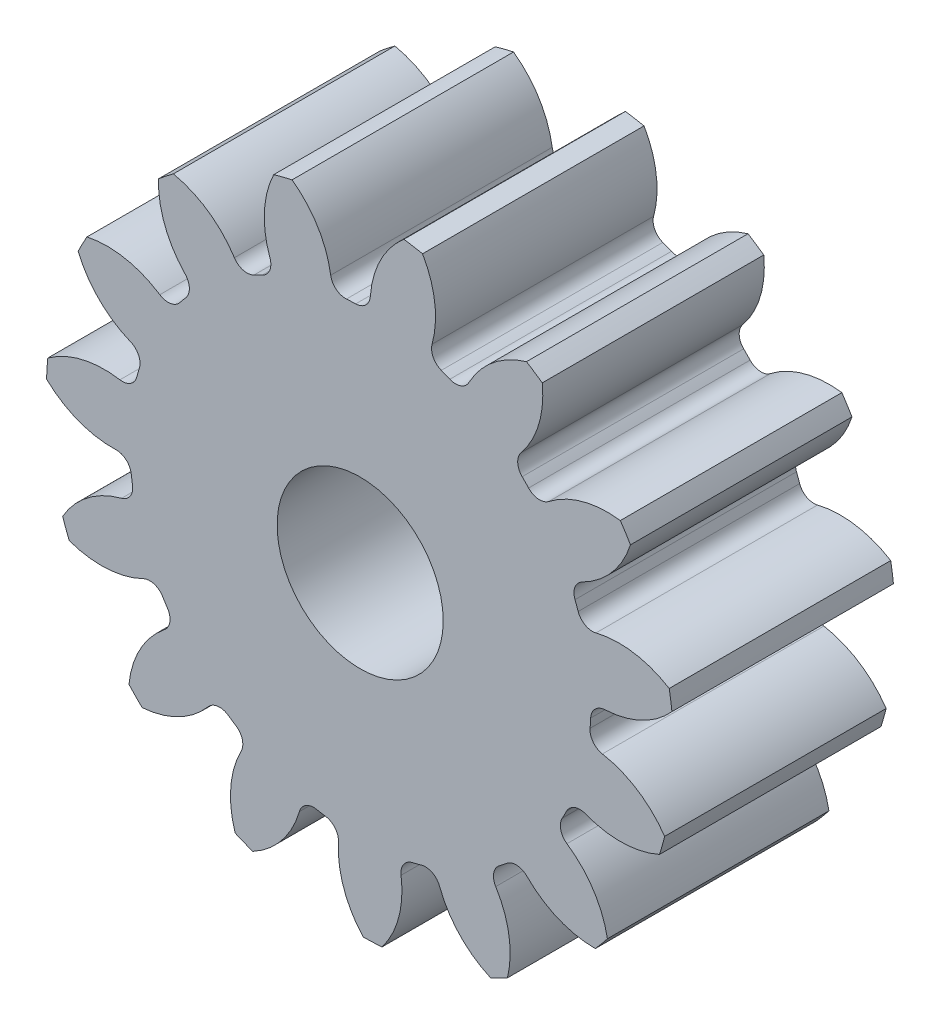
ISO-10303-21;
HEADER;
FILE_DESCRIPTION(('STEP AP214'),'2;1');
FILE_NAME('part.step','',(''),(''),'','','');
FILE_SCHEMA(('AUTOMOTIVE_DESIGN { 1 0 10303 214 1 1 1 1 }'));
ENDSEC;
DATA;
#1=APPLICATION_CONTEXT('core data for automotive mechanical design processes');
#2=APPLICATION_PROTOCOL_DEFINITION('international standard','automotive_design',2000,#1);
#3=PRODUCT_CONTEXT('',#1,'mechanical');
#4=PRODUCT('Part','Part','',(#3));
#5=PRODUCT_RELATED_PRODUCT_CATEGORY('part','',(#4));
#6=PRODUCT_DEFINITION_FORMATION('','',#4);
#7=PRODUCT_DEFINITION_CONTEXT('part definition',#1,'design');
#8=PRODUCT_DEFINITION('design','',#6,#7);
#9=PRODUCT_DEFINITION_SHAPE('','',#8);
#10=(LENGTH_UNIT() NAMED_UNIT(*) SI_UNIT(.MILLI.,.METRE.));
#11=(NAMED_UNIT(*) PLANE_ANGLE_UNIT() SI_UNIT($,.RADIAN.));
#12=(NAMED_UNIT(*) SI_UNIT($,.STERADIAN.) SOLID_ANGLE_UNIT());
#13=UNCERTAINTY_MEASURE_WITH_UNIT(LENGTH_MEASURE(1.E-05),#10,'distance_accuracy_value','');
#14=(GEOMETRIC_REPRESENTATION_CONTEXT(3) GLOBAL_UNCERTAINTY_ASSIGNED_CONTEXT((#13)) GLOBAL_UNIT_ASSIGNED_CONTEXT((#10,
#11,#12)) REPRESENTATION_CONTEXT('',''));
#15=CARTESIAN_POINT('',(0.,0.,0.));
#16=DIRECTION('',(0.,0.,1.));
#17=DIRECTION('',(1.,0.,0.));
#18=AXIS2_PLACEMENT_3D('',#15,#16,#17);
#19=CARTESIAN_POINT('',(0.,0.,101.6));
#20=DIRECTION('',(0.,0.,-1.));
#21=DIRECTION('',(-1.,0.,0.));
#22=AXIS2_PLACEMENT_3D('',#19,#20,#21);
#23=CYLINDRICAL_SURFACE('',#22,143.933333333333);
#24=DIRECTION('',(0.,0.,-1.));
#25=VECTOR('',#24,1.);
#26=CARTESIAN_POINT('',(141.7492700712,24.9789687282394,50.8));
#27=LINE('',#26,#25);
#28=CARTESIAN_POINT('',(141.7492700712,24.9789687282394,101.6));
#29=VERTEX_POINT('',#28);
#30=CARTESIAN_POINT('',(141.7492700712,24.9789687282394,0.));
#31=VERTEX_POINT('',#30);
#32=EDGE_CURVE('E636',#29,#31,#27,.T.);
#33=ORIENTED_EDGE('',*,*,#32,.F.);
#34=CARTESIAN_POINT('',(0.,0.,101.6));
#35=DIRECTION('',(0.,0.,1.));
#36=DIRECTION('',(1.,0.,0.));
#37=AXIS2_PLACEMENT_3D('',#34,#35,#36);
#38=CIRCLE('',#37,143.933333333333);
#39=CARTESIAN_POINT('',(142.997859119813,16.3834285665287,101.6));
#40=VERTEX_POINT('',#39);
#41=EDGE_CURVE('E1167',#40,#29,#38,.T.);
#42=ORIENTED_EDGE('',*,*,#41,.F.);
#43=DIRECTION('',(0.,0.,-1.));
#44=VECTOR('',#43,1.);
#45=CARTESIAN_POINT('',(142.997859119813,16.3834285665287,50.8));
#46=LINE('',#45,#44);
#47=CARTESIAN_POINT('',(142.997859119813,16.3834285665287,0.));
#48=VERTEX_POINT('',#47);
#49=EDGE_CURVE('E1161',#48,#40,#46,.F.);
#50=ORIENTED_EDGE('',*,*,#49,.F.);
#51=CARTESIAN_POINT('',(0.,0.,0.));
#52=DIRECTION('',(0.,0.,1.));
#53=DIRECTION('',(1.,0.,0.));
#54=AXIS2_PLACEMENT_3D('',#51,#52,#53);
#55=CIRCLE('',#54,143.933333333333);
#56=EDGE_CURVE('E1172',#48,#31,#55,.T.);
#57=ORIENTED_EDGE('',*,*,#56,.T.);
#58=EDGE_LOOP('',(#33,#42,#50,#57));
#59=FACE_BOUND('',#58,.T.);
#60=ADVANCED_FACE('F33',(#59),#23,.T.);
#61=DIRECTION('',(0.,0.,-1.));
#62=VECTOR('',#61,1.);
#63=CARTESIAN_POINT('',(123.9713039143,73.1294759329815,50.8));
#64=LINE('',#63,#62);
#65=CARTESIAN_POINT('',(123.9713039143,73.1294759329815,0.));
#66=VERTEX_POINT('',#65);
#67=CARTESIAN_POINT('',(123.9713039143,73.1294759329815,101.6));
#68=VERTEX_POINT('',#67);
#69=EDGE_CURVE('E607',#66,#68,#64,.F.);
#70=ORIENTED_EDGE('',*,*,#69,.F.);
#71=CARTESIAN_POINT('',(119.334539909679,80.4740456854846,0.));
#72=VERTEX_POINT('',#71);
#73=EDGE_CURVE('E1175',#66,#72,#55,.T.);
#74=ORIENTED_EDGE('',*,*,#73,.T.);
#75=DIRECTION('',(0.,0.,-1.));
#76=VECTOR('',#75,1.);
#77=CARTESIAN_POINT('',(119.334539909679,80.4740456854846,50.8));
#78=LINE('',#77,#76);
#79=CARTESIAN_POINT('',(119.334539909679,80.4740456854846,101.6));
#80=VERTEX_POINT('',#79);
#81=EDGE_CURVE('E669',#80,#72,#78,.T.);
#82=ORIENTED_EDGE('',*,*,#81,.F.);
#83=EDGE_CURVE('E1170',#68,#80,#38,.T.);
#84=ORIENTED_EDGE('',*,*,#83,.F.);
#85=EDGE_LOOP('',(#70,#74,#82,#84));
#86=FACE_BOUND('',#85,.T.);
#87=ADVANCED_FACE('F1346',(#86),#23,.T.);
#88=CARTESIAN_POINT('',(0.,0.,101.6));
#89=DIRECTION('',(0.,0.,1.));
#90=DIRECTION('',(1.,0.,0.));
#91=AXIS2_PLACEMENT_3D('',#88,#89,#90);
#92=PLANE('',#91);
#93=CARTESIAN_POINT('',(0.,0.,101.599999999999));
#94=DIRECTION('',(0.,0.,1.));
#95=DIRECTION('',(1.,0.,0.));
#96=AXIS2_PLACEMENT_3D('',#93,#94,#95);
#97=CIRCLE('',#96,38.1);
#98=CARTESIAN_POINT('',(38.1,0.,101.599999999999));
#99=VERTEX_POINT('',#98);
#100=EDGE_CURVE('E624',#99,#99,#97,.T.);
#101=ORIENTED_EDGE('',*,*,#100,.F.);
#102=EDGE_LOOP('',(#101));
#103=FACE_BOUND('',#102,.T.);
#104=ORIENTED_EDGE('',*,*,#41,.T.);
#105=CARTESIAN_POINT('',(118.693708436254,-12.4124529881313,101.6));
#106=DIRECTION('',(0.,0.,-1.));
#107=DIRECTION('',(0.913545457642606,0.406736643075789,0.));
#108=AXIS2_PLACEMENT_3D('',#105,#106,#107);
#109=CIRCLE('',#108,43.9280928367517);
#110=CARTESIAN_POINT('',(108.158925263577,30.2337154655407,101.6));
#111=VERTEX_POINT('',#110);
#112=EDGE_CURVE('E616',#111,#29,#109,.T.);
#113=ORIENTED_EDGE('',*,*,#112,.F.);
#114=CARTESIAN_POINT('',(106.506125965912,36.9244613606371,101.6));
#115=DIRECTION('',(0.,0.,1.));
#116=DIRECTION('',(-0.913545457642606,-0.406736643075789,0.));
#117=AXIS2_PLACEMENT_3D('',#114,#115,#116);
#118=CIRCLE('',#117,6.89186666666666);
#119=CARTESIAN_POINT('',(99.9944850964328,34.6669496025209,101.6));
#120=VERTEX_POINT('',#119);
#121=EDGE_CURVE('E614',#120,#111,#118,.T.);
#122=ORIENTED_EDGE('',*,*,#121,.F.);
#123=CARTESIAN_POINT('',(0.,0.,101.6));
#124=DIRECTION('',(0.,0.,-1.));
#125=DIRECTION('',(0.913545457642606,0.406736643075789,0.));
#126=AXIS2_PLACEMENT_3D('',#123,#124,#125);
#127=CIRCLE('',#126,105.833333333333);
#128=CARTESIAN_POINT('',(98.5305951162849,38.6318038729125,101.6));
#129=VERTEX_POINT('',#128);
#130=EDGE_CURVE('E599',#129,#120,#127,.T.);
#131=ORIENTED_EDGE('',*,*,#130,.F.);
#132=CARTESIAN_POINT('',(104.946907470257,41.1475069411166,101.6));
#133=DIRECTION('',(0.,0.,1.));
#134=DIRECTION('',(-0.913545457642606,-0.406736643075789,0.));
#135=AXIS2_PLACEMENT_3D('',#132,#133,#134);
#136=CIRCLE('',#135,6.89186666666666);
#137=CARTESIAN_POINT('',(101.855192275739,47.3069812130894,101.6));
#138=VERTEX_POINT('',#137);
#139=EDGE_CURVE('E591',#138,#129,#136,.T.);
#140=ORIENTED_EDGE('',*,*,#139,.F.);
#141=CARTESIAN_POINT('',(82.148898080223,86.5668756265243,101.6));
#142=DIRECTION('',(0.,0.,-1.));
#143=DIRECTION('',(-0.913545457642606,-0.406736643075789,0.));
#144=AXIS2_PLACEMENT_3D('',#141,#142,#143);
#145=CIRCLE('',#144,43.9280928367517);
#146=EDGE_CURVE('E621',#68,#138,#145,.T.);
#147=ORIENTED_EDGE('',*,*,#146,.F.);
#148=ORIENTED_EDGE('',*,*,#83,.T.);
#149=CARTESIAN_POINT('',(113.480697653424,36.93774047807,101.6));
#150=DIRECTION('',(0.,0.,-1.));
#151=DIRECTION('',(0.669130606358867,0.743144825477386,0.));
#152=AXIS2_PLACEMENT_3D('',#149,#150,#151);
#153=CIRCLE('',#152,43.9280928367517);
#154=CARTESIAN_POINT('',(86.5109349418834,71.6120716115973,101.6));
#155=VERTEX_POINT('',#154);
#156=EDGE_CURVE('E645',#155,#80,#153,.T.);
#157=ORIENTED_EDGE('',*,*,#156,.F.);
#158=CARTESIAN_POINT('',(82.2796561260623,77.0521180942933,101.6));
#159=DIRECTION('',(0.,0.,1.));
#160=DIRECTION('',(-0.669130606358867,-0.743144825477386,0.));
#161=AXIS2_PLACEMENT_3D('',#158,#159,#160);
#162=CIRCLE('',#161,6.89186666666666);
#163=CARTESIAN_POINT('',(77.2491889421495,72.3412555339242,101.6));
#164=VERTEX_POINT('',#163);
#165=EDGE_CURVE('E643',#164,#155,#162,.T.);
#166=ORIENTED_EDGE('',*,*,#165,.F.);
#167=CARTESIAN_POINT('',(0.,0.,101.6));
#168=DIRECTION('',(0.,0.,-1.));
#169=DIRECTION('',(0.669130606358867,0.743144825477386,0.));
#170=AXIS2_PLACEMENT_3D('',#167,#168,#169);
#171=CIRCLE('',#170,105.833333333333);
#172=CARTESIAN_POINT('',(74.2992073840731,75.3679124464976,101.6));
#173=VERTEX_POINT('',#172);
#174=EDGE_CURVE('E640',#173,#164,#171,.T.);
#175=ORIENTED_EDGE('',*,*,#174,.F.);
#176=CARTESIAN_POINT('',(79.1375717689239,80.2758709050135,101.6));
#177=DIRECTION('',(0.,0.,1.));
#178=DIRECTION('',(-0.669130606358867,-0.743144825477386,0.));
#179=AXIS2_PLACEMENT_3D('',#176,#177,#178);
#180=CIRCLE('',#179,6.89186666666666);
#181=CARTESIAN_POINT('',(73.807865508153,84.6453167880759,101.6));
#182=VERTEX_POINT('',#181);
#183=EDGE_CURVE('E638',#182,#173,#180,.T.);
#184=ORIENTED_EDGE('',*,*,#183,.F.);
#185=CARTESIAN_POINT('',(39.8368322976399,112.495743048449,101.6));
#186=DIRECTION('',(0.,0.,-1.));
#187=DIRECTION('',(-0.669130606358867,-0.743144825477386,0.));
#188=AXIS2_PLACEMENT_3D('',#185,#186,#187);
#189=CIRCLE('',#188,43.9280928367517);
#190=CARTESIAN_POINT('',(83.5089840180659,117.230772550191,101.6));
#191=VERTEX_POINT('',#190);
#192=EDGE_CURVE('E648',#191,#182,#189,.T.);
#193=ORIENTED_EDGE('',*,*,#192,.F.);
#194=CARTESIAN_POINT('',(76.2857836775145,122.054429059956,101.6));
#195=VERTEX_POINT('',#194);
#196=EDGE_CURVE('E1213',#191,#195,#38,.T.);
#197=ORIENTED_EDGE('',*,*,#196,.T.);
#198=CARTESIAN_POINT('',(88.6458433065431,79.9010630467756,101.6));
#199=DIRECTION('',(0.,0.,-1.));
#200=DIRECTION('',(0.309016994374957,0.95105651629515,0.));
#201=AXIS2_PLACEMENT_3D('',#198,#199,#200);
#202=CIRCLE('',#201,43.9280928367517);
#203=CARTESIAN_POINT('',(49.9044180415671,100.608050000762,101.6));
#204=VERTEX_POINT('',#203);
#205=EDGE_CURVE('E680',#204,#195,#202,.T.);
#206=ORIENTED_EDGE('',*,*,#205,.F.);
#207=CARTESIAN_POINT('',(43.8262862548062,103.856763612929,101.6));
#208=DIRECTION('',(0.,0.,1.));
#209=DIRECTION('',(-0.309016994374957,-0.95105651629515,0.));
#210=AXIS2_PLACEMENT_3D('',#207,#208,#209);
#211=CIRCLE('',#210,6.89186666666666);
#212=CARTESIAN_POINT('',(41.1468062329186,97.5071011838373,101.6));
#213=VERTEX_POINT('',#212);
#214=EDGE_CURVE('E678',#213,#204,#211,.T.);
#215=ORIENTED_EDGE('',*,*,#214,.F.);
#216=CARTESIAN_POINT('',(0.,0.,101.6));
#217=DIRECTION('',(0.,0.,-1.));
#218=DIRECTION('',(0.309016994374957,0.95105651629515,0.));
#219=AXIS2_PLACEMENT_3D('',#216,#217,#218);
#220=CIRCLE('',#219,105.833333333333);
#221=CARTESIAN_POINT('',(37.2208117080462,99.0722242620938,101.6));
#222=VERTEX_POINT('',#221);
#223=EDGE_CURVE('E675',#222,#213,#220,.T.);
#224=ORIENTED_EDGE('',*,*,#223,.F.);
#225=CARTESIAN_POINT('',(39.6446309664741,105.523807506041,101.6));
#226=DIRECTION('',(0.,0.,1.));
#227=DIRECTION('',(-0.309016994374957,-0.95105651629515,0.));
#228=AXIS2_PLACEMENT_3D('',#225,#226,#227);
#229=CIRCLE('',#228,6.89186666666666);
#230=CARTESIAN_POINT('',(32.9984882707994,107.347708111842,101.6));
#231=VERTEX_POINT('',#230);
#232=EDGE_CURVE('E673',#231,#222,#229,.T.);
#233=ORIENTED_EDGE('',*,*,#232,.F.);
#234=CARTESIAN_POINT('',(-9.36338369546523,118.973074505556,101.6));
#235=DIRECTION('',(0.,0.,-1.));
#236=DIRECTION('',(-0.309016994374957,-0.95105651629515,0.));
#237=AXIS2_PLACEMENT_3D('',#234,#235,#236);
#238=CIRCLE('',#237,43.9280928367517);
#239=CARTESIAN_POINT('',(28.6072021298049,141.061803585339,101.6));
#240=VERTEX_POINT('',#239);
#241=EDGE_CURVE('E683',#240,#231,#238,.T.);
#242=ORIENTED_EDGE('',*,*,#241,.F.);
#243=CARTESIAN_POINT('',(20.0465224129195,142.530492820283,101.6));
#244=VERTEX_POINT('',#243);
#245=EDGE_CURVE('E1328',#240,#244,#38,.T.);
#246=ORIENTED_EDGE('',*,*,#245,.T.);
#247=CARTESIAN_POINT('',(48.4833173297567,109.048765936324,101.6));
#248=DIRECTION('',(0.,0.,-1.));
#249=DIRECTION('',(-0.104528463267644,0.994521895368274,0.));
#250=AXIS2_PLACEMENT_3D('',#247,#248,#249);
#251=CIRCLE('',#250,43.9280928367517);
#252=CARTESIAN_POINT('',(4.66897389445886,112.207982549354,101.6));
#253=VERTEX_POINT('',#252);
#254=EDGE_CURVE('E718',#253,#244,#251,.T.);
#255=ORIENTED_EDGE('',*,*,#254,.F.);
#256=CARTESIAN_POINT('',(-2.20504665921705,112.703631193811,101.6));
#257=DIRECTION('',(0.,0.,1.));
#258=DIRECTION('',(0.104528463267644,-0.994521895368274,0.));
#259=AXIS2_PLACEMENT_3D('',#256,#257,#258);
#260=CIRCLE('',#259,6.89186666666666);
#261=CARTESIAN_POINT('',(-2.07023308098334,105.81308321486,101.6));
#262=VERTEX_POINT('',#261);
#263=EDGE_CURVE('E716',#262,#253,#260,.T.);
#264=ORIENTED_EDGE('',*,*,#263,.F.);
#265=CARTESIAN_POINT('',(0.,0.,101.6));
#266=DIRECTION('',(0.,0.,-1.));
#267=DIRECTION('',(-0.104528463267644,0.994521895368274,0.));
#268=AXIS2_PLACEMENT_3D('',#265,#266,#267);
#269=CIRCLE('',#268,105.833333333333);
#270=CARTESIAN_POINT('',(-6.29340045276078,105.646048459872,101.6));
#271=VERTEX_POINT('',#270);
#272=EDGE_CURVE('E713',#271,#262,#269,.T.);
#273=ORIENTED_EDGE('',*,*,#272,.F.);
#274=CARTESIAN_POINT('',(-6.70322669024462,112.525719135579,101.6));
#275=DIRECTION('',(0.,0.,1.));
#276=DIRECTION('',(0.104528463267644,-0.994521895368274,0.));
#277=AXIS2_PLACEMENT_3D('',#274,#275,#276);
#278=CIRCLE('',#277,6.89186666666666);
#279=CARTESIAN_POINT('',(-13.5166273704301,111.488705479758,101.6));
#280=VERTEX_POINT('',#279);
#281=EDGE_CURVE('E711',#280,#271,#278,.T.);
#282=ORIENTED_EDGE('',*,*,#281,.F.);
#283=CARTESIAN_POINT('',(-56.9445855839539,104.878880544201,101.6));
#284=DIRECTION('',(0.,0.,-1.));
#285=DIRECTION('',(0.104528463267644,-0.994521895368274,0.));
#286=AXIS2_PLACEMENT_3D('',#283,#284,#285);
#287=CIRCLE('',#286,43.9280928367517);
#288=CARTESIAN_POINT('',(-31.2410248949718,140.501967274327,101.6));
#289=VERTEX_POINT('',#288);
#290=EDGE_CURVE('E721',#289,#280,#287,.T.);
#291=ORIENTED_EDGE('',*,*,#290,.F.);
#292=CARTESIAN_POINT('',(-39.658964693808,138.361739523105,101.6));
#293=VERTEX_POINT('',#292);
#294=EDGE_CURVE('E1324',#289,#293,#38,.T.);
#295=ORIENTED_EDGE('',*,*,#294,.T.);
#296=CARTESIAN_POINT('',(-0.0624146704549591,119.340946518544,101.6));
#297=DIRECTION('',(0.,0.,-1.));
#298=DIRECTION('',(-0.499999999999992,0.866025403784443,0.));
#299=AXIS2_PLACEMENT_3D('',#296,#297,#298);
#300=CIRCLE('',#299,43.9280928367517);
#301=CARTESIAN_POINT('',(-41.3737782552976,104.406135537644,101.6));
#302=VERTEX_POINT('',#301);
#303=EDGE_CURVE('E756',#302,#293,#300,.T.);
#304=ORIENTED_EDGE('',*,*,#303,.F.);
#305=CARTESIAN_POINT('',(-47.8551069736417,102.063017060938,101.6));
#306=DIRECTION('',(0.,0.,1.));
#307=DIRECTION('',(0.499999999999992,-0.866025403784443,0.));
#308=AXIS2_PLACEMENT_3D('',#305,#306,#307);
#309=CIRCLE('',#308,6.89186666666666);
#310=CARTESIAN_POINT('',(-44.9293102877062,95.82302187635,101.6));
#311=VERTEX_POINT('',#310);
#312=EDGE_CURVE('E754',#311,#302,#309,.T.);
#313=ORIENTED_EDGE('',*,*,#312,.F.);
#314=CARTESIAN_POINT('',(0.,0.,101.6));
#315=DIRECTION('',(0.,0.,-1.));
#316=DIRECTION('',(-0.499999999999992,0.866025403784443,0.));
#317=AXIS2_PLACEMENT_3D('',#314,#315,#316);
#318=CIRCLE('',#317,105.833333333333);
#319=CARTESIAN_POINT('',(-48.7194265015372,93.9527111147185,101.6));
#320=VERTEX_POINT('',#319);
#321=EDGE_CURVE('E751',#320,#311,#318,.T.);
#322=ORIENTED_EDGE('',*,*,#321,.F.);
#323=CARTESIAN_POINT('',(-51.8920355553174,100.070911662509,101.6));
#324=DIRECTION('',(0.,0.,1.));
#325=DIRECTION('',(0.499999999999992,-0.866025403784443,0.));
#326=AXIS2_PLACEMENT_3D('',#323,#324,#325);
#327=CIRCLE('',#326,6.89186666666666);
#328=CARTESIAN_POINT('',(-57.6945953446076,96.3522928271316,101.6));
#329=VERTEX_POINT('',#328);
#330=EDGE_CURVE('E749',#329,#320,#327,.T.);
#331=ORIENTED_EDGE('',*,*,#330,.F.);
#332=CARTESIAN_POINT('',(-94.6795512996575,72.6501753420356,101.6));
#333=DIRECTION('',(0.,0.,-1.));
#334=DIRECTION('',(0.499999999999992,-0.866025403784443,0.));
#335=AXIS2_PLACEMENT_3D('',#332,#333,#334);
#336=CIRCLE('',#335,43.9280928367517);
#337=CARTESIAN_POINT('',(-85.6873948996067,115.648064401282,101.6));
#338=VERTEX_POINT('',#337);
#339=EDGE_CURVE('E759',#338,#329,#336,.T.);
#340=ORIENTED_EDGE('',*,*,#339,.F.);
#341=CARTESIAN_POINT('',(-92.5070565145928,110.26898448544,101.6));
#342=VERTEX_POINT('',#341);
#343=EDGE_CURVE('E1320',#338,#342,#38,.T.);
#344=ORIENTED_EDGE('',*,*,#343,.T.);
#345=CARTESIAN_POINT('',(-48.5973546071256,108.997993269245,101.6));
#346=DIRECTION('',(0.,0.,-1.));
#347=DIRECTION('',(-0.809016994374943,0.58778525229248,0.));
#348=AXIS2_PLACEMENT_3D('',#345,#346,#347);
#349=CIRCLE('',#348,43.9280928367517);
#350=CARTESIAN_POINT('',(-80.2626282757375,78.5515191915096,101.6));
#351=VERTEX_POINT('',#350);
#352=EDGE_CURVE('E794',#351,#342,#349,.T.);
#353=ORIENTED_EDGE('',*,*,#352,.F.);
#354=CARTESIAN_POINT('',(-85.2305845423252,73.7747800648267,101.6));
#355=DIRECTION('',(0.,0.,1.));
#356=DIRECTION('',(0.809016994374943,-0.58778525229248,0.));
#357=AXIS2_PLACEMENT_3D('',#354,#355,#356);
#358=CIRCLE('',#357,6.89186666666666);
#359=CARTESIAN_POINT('',(-80.0197015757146,69.2642895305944,101.6));
#360=VERTEX_POINT('',#359);
#361=EDGE_CURVE('E792',#360,#351,#358,.T.);
#362=ORIENTED_EDGE('',*,*,#361,.F.);
#363=CARTESIAN_POINT('',(0.,0.,101.6));
#364=DIRECTION('',(0.,0.,-1.));
#365=DIRECTION('',(-0.809016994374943,0.58778525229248,0.));
#366=AXIS2_PLACEMENT_3D('',#363,#364,#365);
#367=CIRCLE('',#366,105.833333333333);
#368=CARTESIAN_POINT('',(-82.721421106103,66.0140964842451,101.6));
#369=VERTEX_POINT('',#368);
#370=EDGE_CURVE('E789',#369,#360,#367,.T.);
#371=ORIENTED_EDGE('',*,*,#370,.F.);
#372=CARTESIAN_POINT('',(-88.1082400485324,70.3129344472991,101.6));
#373=DIRECTION('',(0.,0.,1.));
#374=DIRECTION('',(0.809016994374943,-0.58778525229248,0.));
#375=AXIS2_PLACEMENT_3D('',#372,#373,#374);
#376=CIRCLE('',#375,6.89186666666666);
#377=CARTESIAN_POINT('',(-91.8966436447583,64.5556934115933,101.6));
#378=VERTEX_POINT('',#377);
#379=EDGE_CURVE('E787',#378,#369,#376,.T.);
#380=ORIENTED_EDGE('',*,*,#379,.F.);
#381=CARTESIAN_POINT('',(-116.04356245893,27.8595948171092,101.6));
#382=DIRECTION('',(0.,0.,-1.));
#383=DIRECTION('',(0.809016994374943,-0.58778525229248,0.));
#384=AXIS2_PLACEMENT_3D('',#381,#382,#383);
#385=CIRCLE('',#384,43.9280928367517);
#386=CARTESIAN_POINT('',(-125.317635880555,70.797560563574,101.6));
#387=VERTEX_POINT('',#386);
#388=EDGE_CURVE('E797',#387,#378,#385,.T.);
#389=ORIENTED_EDGE('',*,*,#388,.F.);
#390=CARTESIAN_POINT('',(-129.359837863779,63.1097202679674,101.6));
#391=VERTEX_POINT('',#390);
#392=EDGE_CURVE('E1316',#387,#391,#38,.T.);
#393=ORIENTED_EDGE('',*,*,#392,.T.);
#394=CARTESIAN_POINT('',(-88.7293704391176,79.8082967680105,101.6));
#395=DIRECTION('',(0.,0.,-1.));
#396=DIRECTION('',(-0.978147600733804,0.207911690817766,0.));
#397=AXIS2_PLACEMENT_3D('',#394,#395,#396);
#398=CIRCLE('',#397,43.9280928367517);
#399=CARTESIAN_POINT('',(-105.273340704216,39.1146315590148,101.6));
#400=VERTEX_POINT('',#399);
#401=EDGE_CURVE('E832',#400,#391,#398,.T.);
#402=ORIENTED_EDGE('',*,*,#401,.F.);
#403=CARTESIAN_POINT('',(-107.868919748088,32.7302133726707,101.6));
#404=DIRECTION('',(0.,0.,1.));
#405=DIRECTION('',(0.978147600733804,-0.207911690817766,0.));
#406=AXIS2_PLACEMENT_3D('',#403,#404,#405);
#407=CIRCLE('',#406,6.89186666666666);
#408=CARTESIAN_POINT('',(-101.273959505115,30.7291322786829,101.6));
#409=VERTEX_POINT('',#408);
#410=EDGE_CURVE('E830',#409,#400,#407,.T.);
#411=ORIENTED_EDGE('',*,*,#410,.F.);
#412=CARTESIAN_POINT('',(0.,0.,101.6));
#413=DIRECTION('',(0.,0.,-1.));
#414=DIRECTION('',(-0.978147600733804,0.207911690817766,0.));
#415=AXIS2_PLACEMENT_3D('',#412,#413,#414);
#416=CIRCLE('',#415,105.833333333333);
#417=CARTESIAN_POINT('',(-102.420130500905,26.6610448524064,101.6));
#418=VERTEX_POINT('',#417);
#419=EDGE_CURVE('E827',#418,#409,#416,.T.);
#420=ORIENTED_EDGE('',*,*,#419,.F.);
#421=CARTESIAN_POINT('',(-109.089729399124,28.3972120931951,101.6));
#422=DIRECTION('',(0.,0.,1.));
#423=DIRECTION('',(0.978147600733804,-0.207911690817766,0.));
#424=AXIS2_PLACEMENT_3D('',#421,#422,#423);
#425=CIRCLE('',#424,6.89186666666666);
#426=CARTESIAN_POINT('',(-110.208927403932,21.5968281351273,101.6));
#427=VERTEX_POINT('',#426);
#428=EDGE_CURVE('E825',#427,#418,#425,.T.);
#429=ORIENTED_EDGE('',*,*,#428,.F.);
#430=CARTESIAN_POINT('',(-117.342587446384,-21.7481627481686,101.6));
#431=DIRECTION('',(0.,0.,-1.));
#432=DIRECTION('',(0.978147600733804,-0.207911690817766,0.));
#433=AXIS2_PLACEMENT_3D('',#430,#431,#432);
#434=CIRCLE('',#433,43.9280928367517);
#435=CARTESIAN_POINT('',(-143.279319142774,13.7055153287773,101.6));
#436=VERTEX_POINT('',#435);
#437=EDGE_CURVE('E835',#436,#427,#434,.T.);
#438=ORIENTED_EDGE('',*,*,#437,.F.);
#439=CARTESIAN_POINT('',(-143.845128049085,5.03821208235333,101.6));
#440=VERTEX_POINT('',#439);
#441=EDGE_CURVE('E1312',#436,#440,#38,.T.);
#442=ORIENTED_EDGE('',*,*,#441,.T.);
#443=CARTESIAN_POINT('',(-113.519272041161,36.8190207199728,101.6));
#444=DIRECTION('',(0.,0.,-1.));
#445=DIRECTION('',(-0.978147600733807,-0.207911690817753,0.));
#446=AXIS2_PLACEMENT_3D('',#443,#444,#445);
#447=CIRCLE('',#446,43.9280928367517);
#448=CARTESIAN_POINT('',(-112.081336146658,-7.08553121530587,101.6));
#449=VERTEX_POINT('',#448);
#450=EDGE_CURVE('E870',#449,#440,#447,.T.);
#451=ORIENTED_EDGE('',*,*,#450,.F.);
#452=CARTESIAN_POINT('',(-111.855738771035,-13.9737045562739,101.6));
#453=DIRECTION('',(0.,0.,1.));
#454=DIRECTION('',(0.978147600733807,0.207911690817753,0.));
#455=AXIS2_PLACEMENT_3D('',#452,#453,#454);
#456=CIRCLE('',#455,6.89186666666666);
#457=CARTESIAN_POINT('',(-105.017029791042,-13.1193711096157,101.6));
#458=VERTEX_POINT('',#457);
#459=EDGE_CURVE('E868',#458,#449,#456,.T.);
#460=ORIENTED_EDGE('',*,*,#459,.F.);
#461=CARTESIAN_POINT('',(0.,0.,101.6));
#462=DIRECTION('',(0.,0.,-1.));
#463=DIRECTION('',(-0.978147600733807,-0.207911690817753,0.));
#464=AXIS2_PLACEMENT_3D('',#461,#462,#463);
#465=CIRCLE('',#464,105.833333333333);
#466=CARTESIAN_POINT('',(-104.409468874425,-17.3019436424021,101.6));
#467=VERTEX_POINT('',#466);
#468=EDGE_CURVE('E865',#467,#458,#465,.T.);
#469=ORIENTED_EDGE('',*,*,#468,.F.);
#470=CARTESIAN_POINT('',(-111.208613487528,-18.4286462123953,101.6));
#471=DIRECTION('',(0.,0.,1.));
#472=DIRECTION('',(0.978147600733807,0.207911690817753,0.));
#473=AXIS2_PLACEMENT_3D('',#470,#471,#472);
#474=CIRCLE('',#473,6.89186666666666);
#475=CARTESIAN_POINT('',(-109.465086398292,-25.0963249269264,101.6));
#476=VERTEX_POINT('',#475);
#477=EDGE_CURVE('E863',#476,#467,#474,.T.);
#478=ORIENTED_EDGE('',*,*,#477,.F.);
#479=CARTESIAN_POINT('',(-98.352013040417,-67.5954653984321,101.6));
#480=DIRECTION('',(0.,0.,-1.));
#481=DIRECTION('',(0.978147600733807,0.207911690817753,0.));
#482=AXIS2_PLACEMENT_3D('',#479,#480,#481);
#483=CIRCLE('',#482,43.9280928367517);
#484=CARTESIAN_POINT('',(-136.466706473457,-45.7563380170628,101.6));
#485=VERTEX_POINT('',#484);
#486=EDGE_CURVE('E873',#485,#476,#483,.T.);
#487=ORIENTED_EDGE('',*,*,#486,.F.);
#488=CARTESIAN_POINT('',(-133.45828880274,-53.9044487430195,101.6));
#489=VERTEX_POINT('',#488);
#490=EDGE_CURVE('E1308',#485,#489,#38,.T.);
#491=ORIENTED_EDGE('',*,*,#490,.T.);
#492=CARTESIAN_POINT('',(-118.680660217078,-12.5365985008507,101.6));
#493=DIRECTION('',(0.,0.,-1.));
#494=DIRECTION('',(-0.80901699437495,-0.587785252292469,0.));
#495=AXIS2_PLACEMENT_3D('',#492,#493,#494);
#496=CIRCLE('',#495,43.9280928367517);
#497=CARTESIAN_POINT('',(-99.5094503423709,-52.0605412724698,101.6));
#498=VERTEX_POINT('',#497);
#499=EDGE_CURVE('E908',#498,#489,#496,.T.);
#500=ORIENTED_EDGE('',*,*,#499,.F.);
#501=CARTESIAN_POINT('',(-96.5016843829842,-58.2614420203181,101.6));
#502=DIRECTION('',(0.,0.,1.));
#503=DIRECTION('',(0.80901699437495,0.587785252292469,0.));
#504=AXIS2_PLACEMENT_3D('',#501,#502,#503);
#505=CIRCLE('',#504,6.89186666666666);
#506=CARTESIAN_POINT('',(-90.6017015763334,-54.6994160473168,101.6));
#507=VERTEX_POINT('',#506);
#508=EDGE_CURVE('E906',#507,#498,#505,.T.);
#509=ORIENTED_EDGE('',*,*,#508,.F.);
#510=CARTESIAN_POINT('',(0.,0.,101.6));
#511=DIRECTION('',(0.,0.,-1.));
#512=DIRECTION('',(-0.80901699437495,-0.587785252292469,0.));
#513=AXIS2_PLACEMENT_3D('',#510,#511,#512);
#514=CIRCLE('',#513,105.833333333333);
#515=CARTESIAN_POINT('',(-88.3454615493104,-58.2732688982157,101.6));
#516=VERTEX_POINT('',#515);
#517=EDGE_CURVE('E903',#516,#507,#514,.T.);
#518=ORIENTED_EDGE('',*,*,#517,.F.);
#519=CARTESIAN_POINT('',(-94.0985180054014,-62.0680241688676,101.6));
#520=DIRECTION('',(0.,0.,1.));
#521=DIRECTION('',(0.80901699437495,0.587785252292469,0.));
#522=AXIS2_PLACEMENT_3D('',#519,#520,#521);
#523=CIRCLE('',#522,6.89186666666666);
#524=CARTESIAN_POINT('',(-89.7937374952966,-67.4500954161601,101.6));
#525=VERTEX_POINT('',#524);
#526=EDGE_CURVE('E901',#525,#516,#523,.T.);
#527=ORIENTED_EDGE('',*,*,#526,.F.);
#528=CARTESIAN_POINT('',(-62.355482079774,-101.754897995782,101.6));
#529=DIRECTION('',(0.,0.,-1.));
#530=DIRECTION('',(0.80901699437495,0.587785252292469,0.));
#531=AXIS2_PLACEMENT_3D('',#528,#529,#530);
#532=CIRCLE('',#531,43.9280928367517);
#533=CARTESIAN_POINT('',(-106.057760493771,-97.3065048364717,101.6));
#534=VERTEX_POINT('',#533);
#535=EDGE_CURVE('E911',#534,#525,#532,.T.);
#536=ORIENTED_EDGE('',*,*,#535,.F.);
#537=CARTESIAN_POINT('',(-99.99529899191,-103.526540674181,101.6));
#538=VERTEX_POINT('',#537);
#539=EDGE_CURVE('E1304',#534,#538,#38,.T.);
#540=ORIENTED_EDGE('',*,*,#539,.T.);
#541=CARTESIAN_POINT('',(-103.321084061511,-59.7245259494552,101.6));
#542=DIRECTION('',(0.,0.,-1.));
#543=DIRECTION('',(-0.500000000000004,-0.866025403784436,0.));
#544=AXIS2_PLACEMENT_3D('',#541,#542,#543);
#545=CIRCLE('',#544,43.9280928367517);
#546=CARTESIAN_POINT('',(-69.7314765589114,-88.033810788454,101.6));
#547=VERTEX_POINT('',#546);
#548=EDGE_CURVE('E946',#547,#538,#545,.T.);
#549=ORIENTED_EDGE('',*,*,#548,.F.);
#550=CARTESIAN_POINT('',(-64.4616120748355,-92.4752468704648,101.6));
#551=DIRECTION('',(0.,0.,1.));
#552=DIRECTION('',(0.500000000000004,0.866025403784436,0.));
#553=AXIS2_PLACEMENT_3D('',#550,#551,#552);
#554=CIRCLE('',#553,6.89186666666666);
#555=CARTESIAN_POINT('',(-60.5205160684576,-86.8214350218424,101.6));
#556=VERTEX_POINT('',#555);
#557=EDGE_CURVE('E944',#556,#547,#554,.T.);
#558=ORIENTED_EDGE('',*,*,#557,.F.);
#559=CARTESIAN_POINT('',(0.,0.,101.6));
#560=DIRECTION('',(0.,0.,-1.));
#561=DIRECTION('',(-0.500000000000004,-0.866025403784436,0.));
#562=AXIS2_PLACEMENT_3D('',#559,#560,#561);
#563=CIRCLE('',#562,105.833333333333);
#564=CARTESIAN_POINT('',(-57.0057213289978,-89.1686165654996,101.6));
#565=VERTEX_POINT('',#564);
#566=EDGE_CURVE('E941',#565,#556,#563,.T.);
#567=ORIENTED_EDGE('',*,*,#566,.F.);
#568=CARTESIAN_POINT('',(-60.7179339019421,-94.9752768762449,101.6));
#569=DIRECTION('',(0.,0.,1.));
#570=DIRECTION('',(0.500000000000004,0.866025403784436,0.));
#571=AXIS2_PLACEMENT_3D('',#568,#569,#570);
#572=CIRCLE('',#571,6.89186666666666);
#573=CARTESIAN_POINT('',(-54.5962356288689,-98.1411316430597,101.6));
#574=VERTEX_POINT('',#573);
#575=EDGE_CURVE('E939',#574,#565,#572,.T.);
#576=ORIENTED_EDGE('',*,*,#575,.F.);
#577=CARTESIAN_POINT('',(-15.5771217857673,-118.319984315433,101.6));
#578=DIRECTION('',(0.,0.,-1.));
#579=DIRECTION('',(0.500000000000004,0.866025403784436,0.));
#580=AXIS2_PLACEMENT_3D('',#577,#578,#579);
#581=CIRCLE('',#580,43.9280928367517);
#582=CARTESIAN_POINT('',(-57.3104642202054,-132.03149296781,101.6));
#583=VERTEX_POINT('',#582);
#584=EDGE_CURVE('E949',#583,#574,#581,.T.);
#585=ORIENTED_EDGE('',*,*,#584,.F.);
#586=CARTESIAN_POINT('',(-49.2422135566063,-135.24795321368,101.6));
#587=VERTEX_POINT('',#586);
#588=EDGE_CURVE('E1300',#583,#587,#38,.T.);
#589=ORIENTED_EDGE('',*,*,#588,.T.);
#590=CARTESIAN_POINT('',(-70.0963538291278,-96.5855402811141,101.6));
#591=DIRECTION('',(0.,0.,-1.));
#592=DIRECTION('',(-0.104528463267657,-0.994521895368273,0.));
#593=AXIS2_PLACEMENT_3D('',#590,#591,#592);
#594=CIRCLE('',#593,43.9280928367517);
#595=CARTESIAN_POINT('',(-27.8962969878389,-108.785234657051,101.6));
#596=VERTEX_POINT('',#595);
#597=EDGE_CURVE('E984',#596,#587,#594,.T.);
#598=ORIENTED_EDGE('',*,*,#597,.F.);
#599=CARTESIAN_POINT('',(-21.2755414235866,-110.699241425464,101.6));
#600=DIRECTION('',(0.,0.,1.));
#601=DIRECTION('',(0.104528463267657,0.994521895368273,0.));
#602=AXIS2_PLACEMENT_3D('',#599,#600,#601);
#603=CIRCLE('',#602,6.89186666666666);
#604=CARTESIAN_POINT('',(-19.9747835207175,-103.931239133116,101.6));
#605=VERTEX_POINT('',#604);
#606=EDGE_CURVE('E982',#605,#596,#603,.T.);
#607=ORIENTED_EDGE('',*,*,#606,.F.);
#608=CARTESIAN_POINT('',(0.,0.,101.6));
#609=DIRECTION('',(0.,0.,-1.));
#610=DIRECTION('',(-0.104528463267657,-0.994521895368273,0.));
#611=AXIS2_PLACEMENT_3D('',#608,#609,#610);
#612=CIRCLE('',#611,105.833333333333);
#613=CARTESIAN_POINT('',(-15.8091740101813,-104.645900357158,101.6));
#614=VERTEX_POINT('',#613);
#615=EDGE_CURVE('E979',#614,#605,#612,.T.);
#616=ORIENTED_EDGE('',*,*,#615,.F.);
#617=CARTESIAN_POINT('',(-16.8386674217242,-111.460441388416,101.6));
#618=DIRECTION('',(0.,0.,1.));
#619=DIRECTION('',(0.104528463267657,0.994521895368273,0.));
#620=AXIS2_PLACEMENT_3D('',#617,#618,#619);
#621=CIRCLE('',#620,6.89186666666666);
#622=CARTESIAN_POINT('',(-9.95854863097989,-111.862674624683,101.6));
#623=VERTEX_POINT('',#622);
#624=EDGE_CURVE('E977',#623,#614,#621,.T.);
#625=ORIENTED_EDGE('',*,*,#624,.F.);
#626=CARTESIAN_POINT('',(33.8946643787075,-114.426470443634,101.6));
#627=DIRECTION('',(0.,0.,-1.));
#628=DIRECTION('',(0.104528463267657,0.994521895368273,0.));
#629=AXIS2_PLACEMENT_3D('',#626,#627,#628);
#630=CIRCLE('',#629,43.9280928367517);
#631=CARTESIAN_POINT('',(1.34633196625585,-143.927036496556,101.6));
#632=VERTEX_POINT('',#631);
#633=EDGE_CURVE('E987',#632,#623,#630,.T.);
#634=ORIENTED_EDGE('',*,*,#633,.F.);
#635=CARTESIAN_POINT('',(10.0252979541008,-143.583765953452,101.6));
#636=VERTEX_POINT('',#635);
#637=EDGE_CURVE('E1296',#632,#636,#38,.T.);
#638=ORIENTED_EDGE('',*,*,#637,.T.);
#639=CARTESIAN_POINT('',(-24.7513272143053,-116.746037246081,101.6));
#640=DIRECTION('',(0.,0.,-1.));
#641=DIRECTION('',(0.309016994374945,-0.951056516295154,0.));
#642=AXIS2_PLACEMENT_3D('',#639,#640,#641);
#643=CIRCLE('',#642,43.9280928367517);
#644=CARTESIAN_POINT('',(18.762405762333,-110.726703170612,101.6));
#645=VERTEX_POINT('',#644);
#646=EDGE_CURVE('E1022',#645,#636,#643,.T.);
#647=ORIENTED_EDGE('',*,*,#646,.F.);
#648=CARTESIAN_POINT('',(25.5892636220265,-109.782331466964,101.6));
#649=DIRECTION('',(0.,0.,1.));
#650=DIRECTION('',(-0.309016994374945,0.951056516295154,0.));
#651=AXIS2_PLACEMENT_3D('',#648,#649,#650);
#652=CIRCLE('',#651,6.89186666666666);
#653=CARTESIAN_POINT('',(24.0247705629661,-103.070387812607,101.6));
#654=VERTEX_POINT('',#653);
#655=EDGE_CURVE('E1020',#654,#645,#652,.T.);
#656=ORIENTED_EDGE('',*,*,#655,.F.);
#657=CARTESIAN_POINT('',(0.,0.,101.6));
#658=DIRECTION('',(0.,0.,-1.));
#659=DIRECTION('',(0.309016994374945,-0.951056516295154,0.));
#660=AXIS2_PLACEMENT_3D('',#657,#658,#659);
#661=CIRCLE('',#660,105.833333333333);
#662=CARTESIAN_POINT('',(28.1209231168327,-102.028957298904,101.6));
#663=VERTEX_POINT('',#662);
#664=EDGE_CURVE('E1017',#663,#654,#661,.T.);
#665=ORIENTED_EDGE('',*,*,#664,.F.);
#666=CARTESIAN_POINT('',(29.9521576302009,-108.673082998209,101.6));
#667=DIRECTION('',(0.,0.,1.));
#668=DIRECTION('',(-0.309016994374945,0.951056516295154,0.));
#669=AXIS2_PLACEMENT_3D('',#666,#667,#668);
#670=CIRCLE('',#669,6.89186666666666);
#671=CARTESIAN_POINT('',(36.4010618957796,-106.242144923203,101.6));
#672=VERTEX_POINT('',#671);
#673=EDGE_CURVE('E1015',#672,#663,#670,.T.);
#674=ORIENTED_EDGE('',*,*,#673,.F.);
#675=CARTESIAN_POINT('',(77.5057551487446,-90.7475803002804,101.6));
#676=DIRECTION('',(0.,0.,-1.));
#677=DIRECTION('',(-0.309016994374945,0.951056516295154,0.));
#678=AXIS2_PLACEMENT_3D('',#675,#676,#677);
#679=CIRCLE('',#678,43.9280928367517);
#680=CARTESIAN_POINT('',(59.7703351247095,-130.936287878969,101.6));
#681=VERTEX_POINT('',#680);
#682=EDGE_CURVE('E1025',#681,#672,#679,.T.);
#683=ORIENTED_EDGE('',*,*,#682,.F.);
#684=CARTESIAN_POINT('',(67.5593443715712,-127.092641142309,101.6));
#685=VERTEX_POINT('',#684);
#686=EDGE_CURVE('E1292',#681,#685,#38,.T.);
#687=ORIENTED_EDGE('',*,*,#686,.T.);
#688=CARTESIAN_POINT('',(24.8734287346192,-116.720083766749,101.6));
#689=DIRECTION('',(0.,0.,-1.));
#690=DIRECTION('',(0.669130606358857,-0.743144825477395,0.));
#691=AXIS2_PLACEMENT_3D('',#688,#689,#690);
#692=CIRCLE('',#691,43.9280928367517);
#693=CARTESIAN_POINT('',(62.1769181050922,-93.5225187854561,101.6));
#694=VERTEX_POINT('',#693);
#695=EDGE_CURVE('E1060',#694,#685,#692,.T.);
#696=ORIENTED_EDGE('',*,*,#695,.F.);
#697=CARTESIAN_POINT('',(68.0294525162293,-89.8830590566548,101.6));
#698=DIRECTION('',(0.,0.,1.));
#699=DIRECTION('',(-0.669130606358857,0.743144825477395,0.));
#700=AXIS2_PLACEMENT_3D('',#697,#698,#699);
#701=CIRCLE('',#700,6.89186666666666);
#702=CARTESIAN_POINT('',(63.8702235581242,-84.3877300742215,101.6));
#703=VERTEX_POINT('',#702);
#704=EDGE_CURVE('E1058',#703,#694,#701,.T.);
#705=ORIENTED_EDGE('',*,*,#704,.F.);
#706=CARTESIAN_POINT('',(0.,0.,101.6));
#707=DIRECTION('',(0.,0.,-1.));
#708=DIRECTION('',(0.669130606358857,-0.743144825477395,0.));
#709=AXIS2_PLACEMENT_3D('',#706,#707,#708);
#710=CIRCLE('',#709,105.833333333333);
#711=CARTESIAN_POINT('',(67.1886571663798,-81.7702806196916,101.6));
#712=VERTEX_POINT('',#711);
#713=EDGE_CURVE('E1055',#712,#703,#710,.T.);
#714=ORIENTED_EDGE('',*,*,#713,.F.);
#715=CARTESIAN_POINT('',(71.5639825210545,-87.0951612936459,101.6));
#716=DIRECTION('',(0.,0.,1.));
#717=DIRECTION('',(-0.669130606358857,0.743144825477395,0.));
#718=AXIS2_PLACEMENT_3D('',#715,#716,#717);
#719=CIRCLE('',#718,6.89186666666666);
#720=CARTESIAN_POINT('',(76.4665981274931,-82.2513831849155,101.6));
#721=VERTEX_POINT('',#720);
#722=EDGE_CURVE('E1053',#721,#712,#719,.T.);
#723=ORIENTED_EDGE('',*,*,#722,.F.);
#724=CARTESIAN_POINT('',(107.715396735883,-51.377609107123,101.6));
#725=DIRECTION('',(0.,0.,-1.));
#726=DIRECTION('',(-0.669130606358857,0.743144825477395,0.));
#727=AXIS2_PLACEMENT_3D('',#724,#725,#726);
#728=CIRCLE('',#727,43.9280928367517);
#729=CARTESIAN_POINT('',(107.859504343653,-95.305465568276,101.6));
#730=VERTEX_POINT('',#729);
#731=EDGE_CURVE('E1063',#730,#721,#728,.T.);
#732=ORIENTED_EDGE('',*,*,#731,.F.);
#733=CARTESIAN_POINT('',(113.411766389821,-88.6260440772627,101.6));
#734=VERTEX_POINT('',#733);
#735=EDGE_CURVE('E1291',#730,#734,#38,.T.);
#736=ORIENTED_EDGE('',*,*,#735,.T.);
#737=CARTESIAN_POINT('',(70.1973428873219,-96.5121674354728,101.6));
#738=DIRECTION('',(0.,0.,-1.));
#739=DIRECTION('',(0.913545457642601,-0.406736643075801,0.));
#740=AXIS2_PLACEMENT_3D('',#737,#738,#739);
#741=CIRCLE('',#740,43.9280928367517);
#742=CARTESIAN_POINT('',(94.8404764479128,-60.147441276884,101.6));
#743=VERTEX_POINT('',#742);
#744=EDGE_CURVE('E1098',#743,#734,#741,.T.);
#745=ORIENTED_EDGE('',*,*,#744,.F.);
#746=CARTESIAN_POINT('',(98.706731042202,-54.4421891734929,101.6));
#747=DIRECTION('',(0.,0.,1.));
#748=DIRECTION('',(-0.913545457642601,0.406736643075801,0.));
#749=AXIS2_PLACEMENT_3D('',#746,#747,#748);
#750=CIRCLE('',#749,6.89186666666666);
#751=CARTESIAN_POINT('',(92.6719346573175,-51.1136671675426,101.6));
#752=VERTEX_POINT('',#751);
#753=EDGE_CURVE('E1096',#752,#743,#750,.T.);
#754=ORIENTED_EDGE('',*,*,#753,.F.);
#755=CARTESIAN_POINT('',(0.,0.,101.6));
#756=DIRECTION('',(0.,0.,-1.));
#757=DIRECTION('',(0.913545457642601,-0.406736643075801,0.));
#758=AXIS2_PLACEMENT_3D('',#755,#756,#757);
#759=CIRCLE('',#758,105.833333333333);
#760=CARTESIAN_POINT('',(94.6388620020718,-47.3727795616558,101.6));
#761=VERTEX_POINT('',#760);
#762=EDGE_CURVE('E1093',#761,#752,#759,.T.);
#763=ORIENTED_EDGE('',*,*,#762,.F.);
#764=CARTESIAN_POINT('',(100.801744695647,-50.4576949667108,101.6));
#765=DIRECTION('',(0.,0.,1.));
#766=DIRECTION('',(-0.913545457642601,0.406736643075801,0.));
#767=AXIS2_PLACEMENT_3D('',#764,#765,#766);
#768=CIRCLE('',#767,6.89186666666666);
#769=CARTESIAN_POINT('',(103.310364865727,-44.0386100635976,101.6));
#770=VERTEX_POINT('',#769);
#771=EDGE_CURVE('E1091',#770,#761,#768,.T.);
#772=ORIENTED_EDGE('',*,*,#771,.F.);
#773=CARTESIAN_POINT('',(119.300067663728,-3.12398254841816,101.6));
#774=DIRECTION('',(0.,0.,-1.));
#775=DIRECTION('',(-0.913545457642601,0.406736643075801,0.));
#776=AXIS2_PLACEMENT_3D('',#773,#774,#775);
#777=CIRCLE('',#776,43.9280928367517);
#778=CARTESIAN_POINT('',(137.298785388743,-43.1954624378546,101.6));
#779=VERTEX_POINT('',#778);
#780=EDGE_CURVE('E1101',#779,#770,#777,.T.);
#781=ORIENTED_EDGE('',*,*,#780,.F.);
#782=CARTESIAN_POINT('',(139.654263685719,-34.8351988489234,101.6));
#783=VERTEX_POINT('',#782);
#784=EDGE_CURVE('E1171',#779,#783,#38,.T.);
#785=ORIENTED_EDGE('',*,*,#784,.T.);
#786=CARTESIAN_POINT('',(103.383498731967,-59.616420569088,101.6));
#787=DIRECTION('',(0.,0.,-1.));
#788=DIRECTION('',(1.,0.,0.));
#789=AXIS2_PLACEMENT_3D('',#786,#787,#788);
#790=CIRCLE('',#789,43.9280928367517);
#791=CARTESIAN_POINT('',(111.10525481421,-16.3723247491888,101.6));
#792=VERTEX_POINT('',#791);
#793=EDGE_CURVE('E1136',#792,#783,#790,.T.);
#794=ORIENTED_EDGE('',*,*,#793,.F.);
#795=CARTESIAN_POINT('',(112.316719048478,-9.58777019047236,101.6));
#796=DIRECTION('',(0.,0.,1.));
#797=DIRECTION('',(-1.,0.,0.));
#798=AXIS2_PLACEMENT_3D('',#795,#796,#797);
#799=CIRCLE('',#798,6.89186666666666);
#800=CARTESIAN_POINT('',(105.449826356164,-9.00158685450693,101.6));
#801=VERTEX_POINT('',#800);
#802=EDGE_CURVE('E1134',#801,#792,#799,.T.);
#803=ORIENTED_EDGE('',*,*,#802,.F.);
#804=CARTESIAN_POINT('',(0.,0.,101.6));
#805=DIRECTION('',(0.,0.,-1.));
#806=DIRECTION('',(1.,0.,0.));
#807=AXIS2_PLACEMENT_3D('',#804,#805,#806);
#808=CIRCLE('',#807,105.833333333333);
#809=CARTESIAN_POINT('',(105.725147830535,-4.78409454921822,101.6));
#810=VERTEX_POINT('',#809);
#811=EDGE_CURVE('E1131',#810,#801,#808,.T.);
#812=ORIENTED_EDGE('',*,*,#811,.F.);
#813=CARTESIAN_POINT('',(112.60996945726,-5.09563478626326,101.6));
#814=DIRECTION('',(0.,0.,1.));
#815=DIRECTION('',(-1.,0.,0.));
#816=AXIS2_PLACEMENT_3D('',#813,#814,#815);
#817=CIRCLE('',#816,6.89186666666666);
#818=CARTESIAN_POINT('',(112.290830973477,1.78883881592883,101.6));
#819=VERTEX_POINT('',#818);
#820=EDGE_CURVE('E1129',#819,#810,#817,.T.);
#821=ORIENTED_EDGE('',*,*,#820,.F.);
#822=CARTESIAN_POINT('',(110.256673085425,45.6698089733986,101.6));
#823=DIRECTION('',(0.,0.,-1.));
#824=DIRECTION('',(-1.,0.,0.));
#825=AXIS2_PLACEMENT_3D('',#822,#823,#824);
#826=CIRCLE('',#825,43.9280928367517);
#827=EDGE_CURVE('E1139',#40,#819,#826,.T.);
#828=ORIENTED_EDGE('',*,*,#827,.F.);
#829=EDGE_LOOP('',(#104,#113,#122,#131,#140,#147,#148,#157,#166,#175,#184,#193,#197,#206,#215,
#224,#233,#242,#246,#255,#264,#273,#282,#291,#295,#304,#313,#322,#331,#340,#344,#353,#362,#371,
#380,#389,#393,#402,#411,#420,#429,#438,#442,#451,#460,#469,#478,#487,#491,#500,#509,#518,#527,
#536,#540,#549,#558,#567,#576,#585,#589,#598,#607,#616,#625,#634,#638,#647,#656,#665,#674,#683,
#687,#696,#705,#714,#723,#732,#736,#745,#754,#763,#772,#781,#785,#794,#803,#812,#821,#828));
#830=FACE_BOUND('',#829,.T.);
#831=ADVANCED_FACE('F612',(#103,#830),#92,.T.);
#832=CARTESIAN_POINT('',(0.,0.,0.));
#833=DIRECTION('',(0.,0.,1.));
#834=DIRECTION('',(1.,0.,0.));
#835=AXIS2_PLACEMENT_3D('',#832,#833,#834);
#836=PLANE('',#835);
#837=CARTESIAN_POINT('',(0.,0.,0.));
#838=DIRECTION('',(0.,0.,1.));
#839=DIRECTION('',(1.,0.,0.));
#840=AXIS2_PLACEMENT_3D('',#837,#838,#839);
#841=CIRCLE('',#840,38.1);
#842=CARTESIAN_POINT('',(38.1,0.,-1.77635683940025E-12));
#843=VERTEX_POINT('',#842);
#844=EDGE_CURVE('E36',#843,#843,#841,.T.);
#845=ORIENTED_EDGE('',*,*,#844,.T.);
#846=EDGE_LOOP('',(#845));
#847=FACE_BOUND('',#846,.T.);
#848=CARTESIAN_POINT('',(118.693708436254,-12.4124529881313,0.));
#849=DIRECTION('',(0.,0.,-1.));
#850=DIRECTION('',(0.913545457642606,0.406736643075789,0.));
#851=AXIS2_PLACEMENT_3D('',#848,#849,#850);
#852=CIRCLE('',#851,43.9280928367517);
#853=CARTESIAN_POINT('',(108.158925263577,30.2337154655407,0.));
#854=VERTEX_POINT('',#853);
#855=EDGE_CURVE('E600',#854,#31,#852,.T.);
#856=ORIENTED_EDGE('',*,*,#855,.T.);
#857=ORIENTED_EDGE('',*,*,#56,.F.);
#858=CARTESIAN_POINT('',(110.256673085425,45.6698089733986,0.));
#859=DIRECTION('',(0.,0.,1.));
#860=DIRECTION('',(1.,0.,0.));
#861=AXIS2_PLACEMENT_3D('',#858,#859,#860);
#862=CIRCLE('',#861,43.9280928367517);
#863=CARTESIAN_POINT('',(112.290830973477,1.78883881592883,0.));
#864=VERTEX_POINT('',#863);
#865=EDGE_CURVE('E1169',#864,#48,#862,.T.);
#866=ORIENTED_EDGE('',*,*,#865,.F.);
#867=CARTESIAN_POINT('',(112.60996945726,-5.09563478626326,0.));
#868=DIRECTION('',(0.,0.,1.));
#869=DIRECTION('',(-1.,0.,0.));
#870=AXIS2_PLACEMENT_3D('',#867,#868,#869);
#871=CIRCLE('',#870,6.89186666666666);
#872=CARTESIAN_POINT('',(105.725147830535,-4.78409454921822,0.));
#873=VERTEX_POINT('',#872);
#874=EDGE_CURVE('E1128',#864,#873,#871,.T.);
#875=ORIENTED_EDGE('',*,*,#874,.T.);
#876=CARTESIAN_POINT('',(0.,0.,0.));
#877=DIRECTION('',(0.,0.,-1.));
#878=DIRECTION('',(1.,0.,0.));
#879=AXIS2_PLACEMENT_3D('',#876,#877,#878);
#880=CIRCLE('',#879,105.833333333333);
#881=CARTESIAN_POINT('',(105.449826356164,-9.00158685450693,0.));
#882=VERTEX_POINT('',#881);
#883=EDGE_CURVE('E1144',#873,#882,#880,.T.);
#884=ORIENTED_EDGE('',*,*,#883,.T.);
#885=CARTESIAN_POINT('',(112.316719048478,-9.58777019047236,0.));
#886=DIRECTION('',(0.,0.,1.));
#887=DIRECTION('',(-1.,0.,0.));
#888=AXIS2_PLACEMENT_3D('',#885,#886,#887);
#889=CIRCLE('',#888,6.89186666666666);
#890=CARTESIAN_POINT('',(111.10525481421,-16.3723247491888,0.));
#891=VERTEX_POINT('',#890);
#892=EDGE_CURVE('E1147',#882,#891,#889,.T.);
#893=ORIENTED_EDGE('',*,*,#892,.T.);
#894=CARTESIAN_POINT('',(103.383498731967,-59.616420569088,0.));
#895=DIRECTION('',(0.,0.,-1.));
#896=DIRECTION('',(1.,0.,0.));
#897=AXIS2_PLACEMENT_3D('',#894,#895,#896);
#898=CIRCLE('',#897,43.9280928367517);
#899=CARTESIAN_POINT('',(139.654263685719,-34.8351988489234,0.));
#900=VERTEX_POINT('',#899);
#901=EDGE_CURVE('E1132',#891,#900,#898,.T.);
#902=ORIENTED_EDGE('',*,*,#901,.T.);
#903=CARTESIAN_POINT('',(137.298785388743,-43.1954624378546,0.));
#904=VERTEX_POINT('',#903);
#905=EDGE_CURVE('E1166',#904,#900,#55,.T.);
#906=ORIENTED_EDGE('',*,*,#905,.F.);
#907=CARTESIAN_POINT('',(119.300067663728,-3.12398254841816,0.));
#908=DIRECTION('',(0.,0.,1.));
#909=DIRECTION('',(1.,0.,0.));
#910=AXIS2_PLACEMENT_3D('',#907,#908,#909);
#911=CIRCLE('',#910,43.9280928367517);
#912=CARTESIAN_POINT('',(103.310364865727,-44.0386100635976,0.));
#913=VERTEX_POINT('',#912);
#914=EDGE_CURVE('E1177',#913,#904,#911,.T.);
#915=ORIENTED_EDGE('',*,*,#914,.F.);
#916=CARTESIAN_POINT('',(100.801744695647,-50.4576949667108,0.));
#917=DIRECTION('',(0.,0.,1.));
#918=DIRECTION('',(-0.913545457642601,0.406736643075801,0.));
#919=AXIS2_PLACEMENT_3D('',#916,#917,#918);
#920=CIRCLE('',#919,6.89186666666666);
#921=CARTESIAN_POINT('',(94.6388620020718,-47.3727795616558,0.));
#922=VERTEX_POINT('',#921);
#923=EDGE_CURVE('E1090',#913,#922,#920,.T.);
#924=ORIENTED_EDGE('',*,*,#923,.T.);
#925=CARTESIAN_POINT('',(0.,0.,0.));
#926=DIRECTION('',(0.,0.,-1.));
#927=DIRECTION('',(0.913545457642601,-0.406736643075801,0.));
#928=AXIS2_PLACEMENT_3D('',#925,#926,#927);
#929=CIRCLE('',#928,105.833333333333);
#930=CARTESIAN_POINT('',(92.6719346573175,-51.1136671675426,0.));
#931=VERTEX_POINT('',#930);
#932=EDGE_CURVE('E1106',#922,#931,#929,.T.);
#933=ORIENTED_EDGE('',*,*,#932,.T.);
#934=CARTESIAN_POINT('',(98.706731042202,-54.4421891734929,0.));
#935=DIRECTION('',(0.,0.,1.));
#936=DIRECTION('',(-0.913545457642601,0.406736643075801,0.));
#937=AXIS2_PLACEMENT_3D('',#934,#935,#936);
#938=CIRCLE('',#937,6.89186666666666);
#939=CARTESIAN_POINT('',(94.8404764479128,-60.147441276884,0.));
#940=VERTEX_POINT('',#939);
#941=EDGE_CURVE('E1109',#931,#940,#938,.T.);
#942=ORIENTED_EDGE('',*,*,#941,.T.);
#943=CARTESIAN_POINT('',(70.1973428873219,-96.5121674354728,0.));
#944=DIRECTION('',(0.,0.,-1.));
#945=DIRECTION('',(0.913545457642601,-0.406736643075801,0.));
#946=AXIS2_PLACEMENT_3D('',#943,#944,#945);
#947=CIRCLE('',#946,43.9280928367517);
#948=CARTESIAN_POINT('',(113.411766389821,-88.6260440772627,0.));
#949=VERTEX_POINT('',#948);
#950=EDGE_CURVE('E1094',#940,#949,#947,.T.);
#951=ORIENTED_EDGE('',*,*,#950,.T.);
#952=CARTESIAN_POINT('',(107.859504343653,-95.305465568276,0.));
#953=VERTEX_POINT('',#952);
#954=EDGE_CURVE('E1262',#953,#949,#55,.T.);
#955=ORIENTED_EDGE('',*,*,#954,.F.);
#956=CARTESIAN_POINT('',(107.715396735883,-51.377609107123,0.));
#957=DIRECTION('',(0.,0.,1.));
#958=DIRECTION('',(1.,0.,0.));
#959=AXIS2_PLACEMENT_3D('',#956,#957,#958);
#960=CIRCLE('',#959,43.9280928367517);
#961=CARTESIAN_POINT('',(76.4665981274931,-82.2513831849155,0.));
#962=VERTEX_POINT('',#961);
#963=EDGE_CURVE('E1179',#962,#953,#960,.T.);
#964=ORIENTED_EDGE('',*,*,#963,.F.);
#965=CARTESIAN_POINT('',(71.5639825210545,-87.0951612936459,0.));
#966=DIRECTION('',(0.,0.,1.));
#967=DIRECTION('',(-0.669130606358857,0.743144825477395,0.));
#968=AXIS2_PLACEMENT_3D('',#965,#966,#967);
#969=CIRCLE('',#968,6.89186666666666);
#970=CARTESIAN_POINT('',(67.1886571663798,-81.7702806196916,0.));
#971=VERTEX_POINT('',#970);
#972=EDGE_CURVE('E1052',#962,#971,#969,.T.);
#973=ORIENTED_EDGE('',*,*,#972,.T.);
#974=CARTESIAN_POINT('',(0.,0.,0.));
#975=DIRECTION('',(0.,0.,-1.));
#976=DIRECTION('',(0.669130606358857,-0.743144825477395,0.));
#977=AXIS2_PLACEMENT_3D('',#974,#975,#976);
#978=CIRCLE('',#977,105.833333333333);
#979=CARTESIAN_POINT('',(63.8702235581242,-84.3877300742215,0.));
#980=VERTEX_POINT('',#979);
#981=EDGE_CURVE('E1068',#971,#980,#978,.T.);
#982=ORIENTED_EDGE('',*,*,#981,.T.);
#983=CARTESIAN_POINT('',(68.0294525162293,-89.8830590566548,0.));
#984=DIRECTION('',(0.,0.,1.));
#985=DIRECTION('',(-0.669130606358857,0.743144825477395,0.));
#986=AXIS2_PLACEMENT_3D('',#983,#984,#985);
#987=CIRCLE('',#986,6.89186666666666);
#988=CARTESIAN_POINT('',(62.1769181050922,-93.5225187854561,0.));
#989=VERTEX_POINT('',#988);
#990=EDGE_CURVE('E1071',#980,#989,#987,.T.);
#991=ORIENTED_EDGE('',*,*,#990,.T.);
#992=CARTESIAN_POINT('',(24.8734287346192,-116.720083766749,0.));
#993=DIRECTION('',(0.,0.,-1.));
#994=DIRECTION('',(0.669130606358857,-0.743144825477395,0.));
#995=AXIS2_PLACEMENT_3D('',#992,#993,#994);
#996=CIRCLE('',#995,43.9280928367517);
#997=CARTESIAN_POINT('',(67.5593443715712,-127.092641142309,0.));
#998=VERTEX_POINT('',#997);
#999=EDGE_CURVE('E1056',#989,#998,#996,.T.);
#1000=ORIENTED_EDGE('',*,*,#999,.T.);
#1001=CARTESIAN_POINT('',(59.7703351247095,-130.936287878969,0.));
#1002=VERTEX_POINT('',#1001);
#1003=EDGE_CURVE('E1257',#1002,#998,#55,.T.);
#1004=ORIENTED_EDGE('',*,*,#1003,.F.);
#1005=CARTESIAN_POINT('',(77.5057551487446,-90.7475803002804,0.));
#1006=DIRECTION('',(0.,0.,1.));
#1007=DIRECTION('',(1.,0.,0.));
#1008=AXIS2_PLACEMENT_3D('',#1005,#1006,#1007);
#1009=CIRCLE('',#1008,43.9280928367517);
#1010=CARTESIAN_POINT('',(36.4010618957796,-106.242144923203,0.));
#1011=VERTEX_POINT('',#1010);
#1012=EDGE_CURVE('E1181',#1011,#1002,#1009,.T.);
#1013=ORIENTED_EDGE('',*,*,#1012,.F.);
#1014=CARTESIAN_POINT('',(29.9521576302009,-108.673082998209,0.));
#1015=DIRECTION('',(0.,0.,1.));
#1016=DIRECTION('',(-0.309016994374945,0.951056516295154,0.));
#1017=AXIS2_PLACEMENT_3D('',#1014,#1015,#1016);
#1018=CIRCLE('',#1017,6.89186666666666);
#1019=CARTESIAN_POINT('',(28.1209231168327,-102.028957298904,0.));
#1020=VERTEX_POINT('',#1019);
#1021=EDGE_CURVE('E1014',#1011,#1020,#1018,.T.);
#1022=ORIENTED_EDGE('',*,*,#1021,.T.);
#1023=CARTESIAN_POINT('',(0.,0.,0.));
#1024=DIRECTION('',(0.,0.,-1.));
#1025=DIRECTION('',(0.309016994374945,-0.951056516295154,0.));
#1026=AXIS2_PLACEMENT_3D('',#1023,#1024,#1025);
#1027=CIRCLE('',#1026,105.833333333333);
#1028=CARTESIAN_POINT('',(24.0247705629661,-103.070387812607,0.));
#1029=VERTEX_POINT('',#1028);
#1030=EDGE_CURVE('E1030',#1020,#1029,#1027,.T.);
#1031=ORIENTED_EDGE('',*,*,#1030,.T.);
#1032=CARTESIAN_POINT('',(25.5892636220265,-109.782331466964,0.));
#1033=DIRECTION('',(0.,0.,1.));
#1034=DIRECTION('',(-0.309016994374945,0.951056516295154,0.));
#1035=AXIS2_PLACEMENT_3D('',#1032,#1033,#1034);
#1036=CIRCLE('',#1035,6.89186666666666);
#1037=CARTESIAN_POINT('',(18.762405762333,-110.726703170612,0.));
#1038=VERTEX_POINT('',#1037);
#1039=EDGE_CURVE('E1033',#1029,#1038,#1036,.T.);
#1040=ORIENTED_EDGE('',*,*,#1039,.T.);
#1041=CARTESIAN_POINT('',(-24.7513272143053,-116.746037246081,0.));
#1042=DIRECTION('',(0.,0.,-1.));
#1043=DIRECTION('',(0.309016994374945,-0.951056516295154,0.));
#1044=AXIS2_PLACEMENT_3D('',#1041,#1042,#1043);
#1045=CIRCLE('',#1044,43.9280928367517);
#1046=CARTESIAN_POINT('',(10.0252979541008,-143.583765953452,0.));
#1047=VERTEX_POINT('',#1046);
#1048=EDGE_CURVE('E1018',#1038,#1047,#1045,.T.);
#1049=ORIENTED_EDGE('',*,*,#1048,.T.);
#1050=CARTESIAN_POINT('',(1.34633196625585,-143.927036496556,0.));
#1051=VERTEX_POINT('',#1050);
#1052=EDGE_CURVE('E1252',#1051,#1047,#55,.T.);
#1053=ORIENTED_EDGE('',*,*,#1052,.F.);
#1054=CARTESIAN_POINT('',(33.8946643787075,-114.426470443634,0.));
#1055=DIRECTION('',(0.,0.,1.));
#1056=DIRECTION('',(1.,0.,0.));
#1057=AXIS2_PLACEMENT_3D('',#1054,#1055,#1056);
#1058=CIRCLE('',#1057,43.9280928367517);
#1059=CARTESIAN_POINT('',(-9.95854863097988,-111.862674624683,0.));
#1060=VERTEX_POINT('',#1059);
#1061=EDGE_CURVE('E1183',#1060,#1051,#1058,.T.);
#1062=ORIENTED_EDGE('',*,*,#1061,.F.);
#1063=CARTESIAN_POINT('',(-16.8386674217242,-111.460441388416,0.));
#1064=DIRECTION('',(0.,0.,1.));
#1065=DIRECTION('',(0.104528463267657,0.994521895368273,0.));
#1066=AXIS2_PLACEMENT_3D('',#1063,#1064,#1065);
#1067=CIRCLE('',#1066,6.89186666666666);
#1068=CARTESIAN_POINT('',(-15.8091740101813,-104.645900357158,0.));
#1069=VERTEX_POINT('',#1068);
#1070=EDGE_CURVE('E976',#1060,#1069,#1067,.T.);
#1071=ORIENTED_EDGE('',*,*,#1070,.T.);
#1072=CARTESIAN_POINT('',(0.,0.,0.));
#1073=DIRECTION('',(0.,0.,-1.));
#1074=DIRECTION('',(-0.104528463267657,-0.994521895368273,0.));
#1075=AXIS2_PLACEMENT_3D('',#1072,#1073,#1074);
#1076=CIRCLE('',#1075,105.833333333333);
#1077=CARTESIAN_POINT('',(-19.9747835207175,-103.931239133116,0.));
#1078=VERTEX_POINT('',#1077);
#1079=EDGE_CURVE('E992',#1069,#1078,#1076,.T.);
#1080=ORIENTED_EDGE('',*,*,#1079,.T.);
#1081=CARTESIAN_POINT('',(-21.2755414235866,-110.699241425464,0.));
#1082=DIRECTION('',(0.,0.,1.));
#1083=DIRECTION('',(0.104528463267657,0.994521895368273,0.));
#1084=AXIS2_PLACEMENT_3D('',#1081,#1082,#1083);
#1085=CIRCLE('',#1084,6.89186666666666);
#1086=CARTESIAN_POINT('',(-27.8962969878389,-108.785234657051,0.));
#1087=VERTEX_POINT('',#1086);
#1088=EDGE_CURVE('E995',#1078,#1087,#1085,.T.);
#1089=ORIENTED_EDGE('',*,*,#1088,.T.);
#1090=CARTESIAN_POINT('',(-70.0963538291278,-96.5855402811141,0.));
#1091=DIRECTION('',(0.,0.,-1.));
#1092=DIRECTION('',(-0.104528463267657,-0.994521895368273,0.));
#1093=AXIS2_PLACEMENT_3D('',#1090,#1091,#1092);
#1094=CIRCLE('',#1093,43.9280928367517);
#1095=CARTESIAN_POINT('',(-49.2422135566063,-135.24795321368,0.));
#1096=VERTEX_POINT('',#1095);
#1097=EDGE_CURVE('E980',#1087,#1096,#1094,.T.);
#1098=ORIENTED_EDGE('',*,*,#1097,.T.);
#1099=CARTESIAN_POINT('',(-57.3104642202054,-132.03149296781,0.));
#1100=VERTEX_POINT('',#1099);
#1101=EDGE_CURVE('E1247',#1100,#1096,#55,.T.);
#1102=ORIENTED_EDGE('',*,*,#1101,.F.);
#1103=CARTESIAN_POINT('',(-15.5771217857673,-118.319984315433,0.));
#1104=DIRECTION('',(0.,0.,1.));
#1105=DIRECTION('',(1.,0.,0.));
#1106=AXIS2_PLACEMENT_3D('',#1103,#1104,#1105);
#1107=CIRCLE('',#1106,43.9280928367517);
#1108=CARTESIAN_POINT('',(-54.5962356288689,-98.1411316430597,0.));
#1109=VERTEX_POINT('',#1108);
#1110=EDGE_CURVE('E1185',#1109,#1100,#1107,.T.);
#1111=ORIENTED_EDGE('',*,*,#1110,.F.);
#1112=CARTESIAN_POINT('',(-60.7179339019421,-94.9752768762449,0.));
#1113=DIRECTION('',(0.,0.,1.));
#1114=DIRECTION('',(0.500000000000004,0.866025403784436,0.));
#1115=AXIS2_PLACEMENT_3D('',#1112,#1113,#1114);
#1116=CIRCLE('',#1115,6.89186666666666);
#1117=CARTESIAN_POINT('',(-57.0057213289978,-89.1686165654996,0.));
#1118=VERTEX_POINT('',#1117);
#1119=EDGE_CURVE('E938',#1109,#1118,#1116,.T.);
#1120=ORIENTED_EDGE('',*,*,#1119,.T.);
#1121=CARTESIAN_POINT('',(0.,0.,0.));
#1122=DIRECTION('',(0.,0.,-1.));
#1123=DIRECTION('',(-0.500000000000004,-0.866025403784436,0.));
#1124=AXIS2_PLACEMENT_3D('',#1121,#1122,#1123);
#1125=CIRCLE('',#1124,105.833333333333);
#1126=CARTESIAN_POINT('',(-60.5205160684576,-86.8214350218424,0.));
#1127=VERTEX_POINT('',#1126);
#1128=EDGE_CURVE('E954',#1118,#1127,#1125,.T.);
#1129=ORIENTED_EDGE('',*,*,#1128,.T.);
#1130=CARTESIAN_POINT('',(-64.4616120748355,-92.4752468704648,0.));
#1131=DIRECTION('',(0.,0.,1.));
#1132=DIRECTION('',(0.500000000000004,0.866025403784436,0.));
#1133=AXIS2_PLACEMENT_3D('',#1130,#1131,#1132);
#1134=CIRCLE('',#1133,6.89186666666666);
#1135=CARTESIAN_POINT('',(-69.7314765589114,-88.033810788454,0.));
#1136=VERTEX_POINT('',#1135);
#1137=EDGE_CURVE('E957',#1127,#1136,#1134,.T.);
#1138=ORIENTED_EDGE('',*,*,#1137,.T.);
#1139=CARTESIAN_POINT('',(-103.321084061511,-59.7245259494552,0.));
#1140=DIRECTION('',(0.,0.,-1.));
#1141=DIRECTION('',(-0.500000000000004,-0.866025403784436,0.));
#1142=AXIS2_PLACEMENT_3D('',#1139,#1140,#1141);
#1143=CIRCLE('',#1142,43.9280928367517);
#1144=CARTESIAN_POINT('',(-99.99529899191,-103.526540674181,0.));
#1145=VERTEX_POINT('',#1144);
#1146=EDGE_CURVE('E942',#1136,#1145,#1143,.T.);
#1147=ORIENTED_EDGE('',*,*,#1146,.T.);
#1148=CARTESIAN_POINT('',(-106.057760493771,-97.3065048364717,0.));
#1149=VERTEX_POINT('',#1148);
#1150=EDGE_CURVE('E1242',#1149,#1145,#55,.T.);
#1151=ORIENTED_EDGE('',*,*,#1150,.F.);
#1152=CARTESIAN_POINT('',(-62.355482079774,-101.754897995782,0.));
#1153=DIRECTION('',(0.,0.,1.));
#1154=DIRECTION('',(1.,0.,0.));
#1155=AXIS2_PLACEMENT_3D('',#1152,#1153,#1154);
#1156=CIRCLE('',#1155,43.9280928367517);
#1157=CARTESIAN_POINT('',(-89.7937374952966,-67.4500954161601,0.));
#1158=VERTEX_POINT('',#1157);
#1159=EDGE_CURVE('E1187',#1158,#1149,#1156,.T.);
#1160=ORIENTED_EDGE('',*,*,#1159,.F.);
#1161=CARTESIAN_POINT('',(-94.0985180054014,-62.0680241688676,0.));
#1162=DIRECTION('',(0.,0.,1.));
#1163=DIRECTION('',(0.80901699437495,0.587785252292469,0.));
#1164=AXIS2_PLACEMENT_3D('',#1161,#1162,#1163);
#1165=CIRCLE('',#1164,6.89186666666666);
#1166=CARTESIAN_POINT('',(-88.3454615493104,-58.2732688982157,0.));
#1167=VERTEX_POINT('',#1166);
#1168=EDGE_CURVE('E900',#1158,#1167,#1165,.T.);
#1169=ORIENTED_EDGE('',*,*,#1168,.T.);
#1170=CARTESIAN_POINT('',(0.,0.,0.));
#1171=DIRECTION('',(0.,0.,-1.));
#1172=DIRECTION('',(-0.80901699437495,-0.587785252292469,0.));
#1173=AXIS2_PLACEMENT_3D('',#1170,#1171,#1172);
#1174=CIRCLE('',#1173,105.833333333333);
#1175=CARTESIAN_POINT('',(-90.6017015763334,-54.6994160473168,0.));
#1176=VERTEX_POINT('',#1175);
#1177=EDGE_CURVE('E916',#1167,#1176,#1174,.T.);
#1178=ORIENTED_EDGE('',*,*,#1177,.T.);
#1179=CARTESIAN_POINT('',(-96.5016843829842,-58.2614420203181,0.));
#1180=DIRECTION('',(0.,0.,1.));
#1181=DIRECTION('',(0.80901699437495,0.587785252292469,0.));
#1182=AXIS2_PLACEMENT_3D('',#1179,#1180,#1181);
#1183=CIRCLE('',#1182,6.89186666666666);
#1184=CARTESIAN_POINT('',(-99.5094503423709,-52.0605412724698,0.));
#1185=VERTEX_POINT('',#1184);
#1186=EDGE_CURVE('E919',#1176,#1185,#1183,.T.);
#1187=ORIENTED_EDGE('',*,*,#1186,.T.);
#1188=CARTESIAN_POINT('',(-118.680660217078,-12.5365985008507,0.));
#1189=DIRECTION('',(0.,0.,-1.));
#1190=DIRECTION('',(-0.80901699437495,-0.587785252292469,0.));
#1191=AXIS2_PLACEMENT_3D('',#1188,#1189,#1190);
#1192=CIRCLE('',#1191,43.9280928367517);
#1193=CARTESIAN_POINT('',(-133.45828880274,-53.9044487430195,0.));
#1194=VERTEX_POINT('',#1193);
#1195=EDGE_CURVE('E904',#1185,#1194,#1192,.T.);
#1196=ORIENTED_EDGE('',*,*,#1195,.T.);
#1197=CARTESIAN_POINT('',(-136.466706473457,-45.7563380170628,0.));
#1198=VERTEX_POINT('',#1197);
#1199=EDGE_CURVE('E1237',#1198,#1194,#55,.T.);
#1200=ORIENTED_EDGE('',*,*,#1199,.F.);
#1201=CARTESIAN_POINT('',(-98.352013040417,-67.5954653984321,0.));
#1202=DIRECTION('',(0.,0.,1.));
#1203=DIRECTION('',(1.,0.,0.));
#1204=AXIS2_PLACEMENT_3D('',#1201,#1202,#1203);
#1205=CIRCLE('',#1204,43.9280928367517);
#1206=CARTESIAN_POINT('',(-109.465086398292,-25.0963249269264,0.));
#1207=VERTEX_POINT('',#1206);
#1208=EDGE_CURVE('E1189',#1207,#1198,#1205,.T.);
#1209=ORIENTED_EDGE('',*,*,#1208,.F.);
#1210=CARTESIAN_POINT('',(-111.208613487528,-18.4286462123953,0.));
#1211=DIRECTION('',(0.,0.,1.));
#1212=DIRECTION('',(0.978147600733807,0.207911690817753,0.));
#1213=AXIS2_PLACEMENT_3D('',#1210,#1211,#1212);
#1214=CIRCLE('',#1213,6.89186666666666);
#1215=CARTESIAN_POINT('',(-104.409468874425,-17.3019436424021,0.));
#1216=VERTEX_POINT('',#1215);
#1217=EDGE_CURVE('E862',#1207,#1216,#1214,.T.);
#1218=ORIENTED_EDGE('',*,*,#1217,.T.);
#1219=CARTESIAN_POINT('',(0.,0.,0.));
#1220=DIRECTION('',(0.,0.,-1.));
#1221=DIRECTION('',(-0.978147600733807,-0.207911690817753,0.));
#1222=AXIS2_PLACEMENT_3D('',#1219,#1220,#1221);
#1223=CIRCLE('',#1222,105.833333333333);
#1224=CARTESIAN_POINT('',(-105.017029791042,-13.1193711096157,0.));
#1225=VERTEX_POINT('',#1224);
#1226=EDGE_CURVE('E878',#1216,#1225,#1223,.T.);
#1227=ORIENTED_EDGE('',*,*,#1226,.T.);
#1228=CARTESIAN_POINT('',(-111.855738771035,-13.9737045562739,0.));
#1229=DIRECTION('',(0.,0.,1.));
#1230=DIRECTION('',(0.978147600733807,0.207911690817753,0.));
#1231=AXIS2_PLACEMENT_3D('',#1228,#1229,#1230);
#1232=CIRCLE('',#1231,6.89186666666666);
#1233=CARTESIAN_POINT('',(-112.081336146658,-7.08553121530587,0.));
#1234=VERTEX_POINT('',#1233);
#1235=EDGE_CURVE('E881',#1225,#1234,#1232,.T.);
#1236=ORIENTED_EDGE('',*,*,#1235,.T.);
#1237=CARTESIAN_POINT('',(-113.519272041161,36.8190207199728,0.));
#1238=DIRECTION('',(0.,0.,-1.));
#1239=DIRECTION('',(-0.978147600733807,-0.207911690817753,0.));
#1240=AXIS2_PLACEMENT_3D('',#1237,#1238,#1239);
#1241=CIRCLE('',#1240,43.9280928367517);
#1242=CARTESIAN_POINT('',(-143.845128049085,5.03821208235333,0.));
#1243=VERTEX_POINT('',#1242);
#1244=EDGE_CURVE('E866',#1234,#1243,#1241,.T.);
#1245=ORIENTED_EDGE('',*,*,#1244,.T.);
#1246=CARTESIAN_POINT('',(-143.279319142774,13.7055153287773,0.));
#1247=VERTEX_POINT('',#1246);
#1248=EDGE_CURVE('E1232',#1247,#1243,#55,.T.);
#1249=ORIENTED_EDGE('',*,*,#1248,.F.);
#1250=CARTESIAN_POINT('',(-117.342587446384,-21.7481627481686,0.));
#1251=DIRECTION('',(0.,0.,1.));
#1252=DIRECTION('',(1.,0.,0.));
#1253=AXIS2_PLACEMENT_3D('',#1250,#1251,#1252);
#1254=CIRCLE('',#1253,43.9280928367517);
#1255=CARTESIAN_POINT('',(-110.208927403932,21.5968281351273,0.));
#1256=VERTEX_POINT('',#1255);
#1257=EDGE_CURVE('E1191',#1256,#1247,#1254,.T.);
#1258=ORIENTED_EDGE('',*,*,#1257,.F.);
#1259=CARTESIAN_POINT('',(-109.089729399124,28.3972120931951,0.));
#1260=DIRECTION('',(0.,0.,1.));
#1261=DIRECTION('',(0.978147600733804,-0.207911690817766,0.));
#1262=AXIS2_PLACEMENT_3D('',#1259,#1260,#1261);
#1263=CIRCLE('',#1262,6.89186666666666);
#1264=CARTESIAN_POINT('',(-102.420130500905,26.6610448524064,0.));
#1265=VERTEX_POINT('',#1264);
#1266=EDGE_CURVE('E824',#1256,#1265,#1263,.T.);
#1267=ORIENTED_EDGE('',*,*,#1266,.T.);
#1268=CARTESIAN_POINT('',(0.,0.,0.));
#1269=DIRECTION('',(0.,0.,-1.));
#1270=DIRECTION('',(-0.978147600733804,0.207911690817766,0.));
#1271=AXIS2_PLACEMENT_3D('',#1268,#1269,#1270);
#1272=CIRCLE('',#1271,105.833333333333);
#1273=CARTESIAN_POINT('',(-101.273959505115,30.7291322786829,0.));
#1274=VERTEX_POINT('',#1273);
#1275=EDGE_CURVE('E840',#1265,#1274,#1272,.T.);
#1276=ORIENTED_EDGE('',*,*,#1275,.T.);
#1277=CARTESIAN_POINT('',(-107.868919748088,32.7302133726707,0.));
#1278=DIRECTION('',(0.,0.,1.));
#1279=DIRECTION('',(0.978147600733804,-0.207911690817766,0.));
#1280=AXIS2_PLACEMENT_3D('',#1277,#1278,#1279);
#1281=CIRCLE('',#1280,6.89186666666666);
#1282=CARTESIAN_POINT('',(-105.273340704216,39.1146315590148,0.));
#1283=VERTEX_POINT('',#1282);
#1284=EDGE_CURVE('E843',#1274,#1283,#1281,.T.);
#1285=ORIENTED_EDGE('',*,*,#1284,.T.);
#1286=CARTESIAN_POINT('',(-88.7293704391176,79.8082967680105,0.));
#1287=DIRECTION('',(0.,0.,-1.));
#1288=DIRECTION('',(-0.978147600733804,0.207911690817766,0.));
#1289=AXIS2_PLACEMENT_3D('',#1286,#1287,#1288);
#1290=CIRCLE('',#1289,43.9280928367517);
#1291=CARTESIAN_POINT('',(-129.359837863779,63.1097202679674,0.));
#1292=VERTEX_POINT('',#1291);
#1293=EDGE_CURVE('E828',#1283,#1292,#1290,.T.);
#1294=ORIENTED_EDGE('',*,*,#1293,.T.);
#1295=CARTESIAN_POINT('',(-125.317635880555,70.797560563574,0.));
#1296=VERTEX_POINT('',#1295);
#1297=EDGE_CURVE('E1227',#1296,#1292,#55,.T.);
#1298=ORIENTED_EDGE('',*,*,#1297,.F.);
#1299=CARTESIAN_POINT('',(-116.04356245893,27.8595948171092,0.));
#1300=DIRECTION('',(0.,0.,1.));
#1301=DIRECTION('',(1.,0.,0.));
#1302=AXIS2_PLACEMENT_3D('',#1299,#1300,#1301);
#1303=CIRCLE('',#1302,43.9280928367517);
#1304=CARTESIAN_POINT('',(-91.8966436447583,64.5556934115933,0.));
#1305=VERTEX_POINT('',#1304);
#1306=EDGE_CURVE('E1193',#1305,#1296,#1303,.T.);
#1307=ORIENTED_EDGE('',*,*,#1306,.F.);
#1308=CARTESIAN_POINT('',(-88.1082400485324,70.3129344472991,0.));
#1309=DIRECTION('',(0.,0.,1.));
#1310=DIRECTION('',(0.809016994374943,-0.58778525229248,0.));
#1311=AXIS2_PLACEMENT_3D('',#1308,#1309,#1310);
#1312=CIRCLE('',#1311,6.89186666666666);
#1313=CARTESIAN_POINT('',(-82.721421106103,66.0140964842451,0.));
#1314=VERTEX_POINT('',#1313);
#1315=EDGE_CURVE('E786',#1305,#1314,#1312,.T.);
#1316=ORIENTED_EDGE('',*,*,#1315,.T.);
#1317=CARTESIAN_POINT('',(0.,0.,0.));
#1318=DIRECTION('',(0.,0.,-1.));
#1319=DIRECTION('',(-0.809016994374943,0.58778525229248,0.));
#1320=AXIS2_PLACEMENT_3D('',#1317,#1318,#1319);
#1321=CIRCLE('',#1320,105.833333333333);
#1322=CARTESIAN_POINT('',(-80.0197015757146,69.2642895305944,0.));
#1323=VERTEX_POINT('',#1322);
#1324=EDGE_CURVE('E802',#1314,#1323,#1321,.T.);
#1325=ORIENTED_EDGE('',*,*,#1324,.T.);
#1326=CARTESIAN_POINT('',(-85.2305845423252,73.7747800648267,0.));
#1327=DIRECTION('',(0.,0.,1.));
#1328=DIRECTION('',(0.809016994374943,-0.58778525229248,0.));
#1329=AXIS2_PLACEMENT_3D('',#1326,#1327,#1328);
#1330=CIRCLE('',#1329,6.89186666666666);
#1331=CARTESIAN_POINT('',(-80.2626282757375,78.5515191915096,0.));
#1332=VERTEX_POINT('',#1331);
#1333=EDGE_CURVE('E805',#1323,#1332,#1330,.T.);
#1334=ORIENTED_EDGE('',*,*,#1333,.T.);
#1335=CARTESIAN_POINT('',(-48.5973546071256,108.997993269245,0.));
#1336=DIRECTION('',(0.,0.,-1.));
#1337=DIRECTION('',(-0.809016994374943,0.58778525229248,0.));
#1338=AXIS2_PLACEMENT_3D('',#1335,#1336,#1337);
#1339=CIRCLE('',#1338,43.9280928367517);
#1340=CARTESIAN_POINT('',(-92.5070565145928,110.26898448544,0.));
#1341=VERTEX_POINT('',#1340);
#1342=EDGE_CURVE('E790',#1332,#1341,#1339,.T.);
#1343=ORIENTED_EDGE('',*,*,#1342,.T.);
#1344=CARTESIAN_POINT('',(-85.6873948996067,115.648064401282,0.));
#1345=VERTEX_POINT('',#1344);
#1346=EDGE_CURVE('E1222',#1345,#1341,#55,.T.);
#1347=ORIENTED_EDGE('',*,*,#1346,.F.);
#1348=CARTESIAN_POINT('',(-94.6795512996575,72.6501753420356,0.));
#1349=DIRECTION('',(0.,0.,1.));
#1350=DIRECTION('',(1.,0.,0.));
#1351=AXIS2_PLACEMENT_3D('',#1348,#1349,#1350);
#1352=CIRCLE('',#1351,43.9280928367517);
#1353=CARTESIAN_POINT('',(-57.6945953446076,96.3522928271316,0.));
#1354=VERTEX_POINT('',#1353);
#1355=EDGE_CURVE('E1195',#1354,#1345,#1352,.T.);
#1356=ORIENTED_EDGE('',*,*,#1355,.F.);
#1357=CARTESIAN_POINT('',(-51.8920355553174,100.070911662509,0.));
#1358=DIRECTION('',(0.,0.,1.));
#1359=DIRECTION('',(0.499999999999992,-0.866025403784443,0.));
#1360=AXIS2_PLACEMENT_3D('',#1357,#1358,#1359);
#1361=CIRCLE('',#1360,6.89186666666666);
#1362=CARTESIAN_POINT('',(-48.7194265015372,93.9527111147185,0.));
#1363=VERTEX_POINT('',#1362);
#1364=EDGE_CURVE('E748',#1354,#1363,#1361,.T.);
#1365=ORIENTED_EDGE('',*,*,#1364,.T.);
#1366=CARTESIAN_POINT('',(0.,0.,0.));
#1367=DIRECTION('',(0.,0.,-1.));
#1368=DIRECTION('',(-0.499999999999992,0.866025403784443,0.));
#1369=AXIS2_PLACEMENT_3D('',#1366,#1367,#1368);
#1370=CIRCLE('',#1369,105.833333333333);
#1371=CARTESIAN_POINT('',(-44.9293102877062,95.82302187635,0.));
#1372=VERTEX_POINT('',#1371);
#1373=EDGE_CURVE('E764',#1363,#1372,#1370,.T.);
#1374=ORIENTED_EDGE('',*,*,#1373,.T.);
#1375=CARTESIAN_POINT('',(-47.8551069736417,102.063017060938,0.));
#1376=DIRECTION('',(0.,0.,1.));
#1377=DIRECTION('',(0.499999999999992,-0.866025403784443,0.));
#1378=AXIS2_PLACEMENT_3D('',#1375,#1376,#1377);
#1379=CIRCLE('',#1378,6.89186666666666);
#1380=CARTESIAN_POINT('',(-41.3737782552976,104.406135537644,0.));
#1381=VERTEX_POINT('',#1380);
#1382=EDGE_CURVE('E767',#1372,#1381,#1379,.T.);
#1383=ORIENTED_EDGE('',*,*,#1382,.T.);
#1384=CARTESIAN_POINT('',(-0.0624146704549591,119.340946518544,0.));
#1385=DIRECTION('',(0.,0.,-1.));
#1386=DIRECTION('',(-0.499999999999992,0.866025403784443,0.));
#1387=AXIS2_PLACEMENT_3D('',#1384,#1385,#1386);
#1388=CIRCLE('',#1387,43.9280928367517);
#1389=CARTESIAN_POINT('',(-39.658964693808,138.361739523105,0.));
#1390=VERTEX_POINT('',#1389);
#1391=EDGE_CURVE('E752',#1381,#1390,#1388,.T.);
#1392=ORIENTED_EDGE('',*,*,#1391,.T.);
#1393=CARTESIAN_POINT('',(-31.2410248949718,140.501967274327,0.));
#1394=VERTEX_POINT('',#1393);
#1395=EDGE_CURVE('E1217',#1394,#1390,#55,.T.);
#1396=ORIENTED_EDGE('',*,*,#1395,.F.);
#1397=CARTESIAN_POINT('',(-56.9445855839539,104.878880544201,0.));
#1398=DIRECTION('',(0.,0.,1.));
#1399=DIRECTION('',(1.,0.,0.));
#1400=AXIS2_PLACEMENT_3D('',#1397,#1398,#1399);
#1401=CIRCLE('',#1400,43.9280928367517);
#1402=CARTESIAN_POINT('',(-13.5166273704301,111.488705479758,0.));
#1403=VERTEX_POINT('',#1402);
#1404=EDGE_CURVE('E1197',#1403,#1394,#1401,.T.);
#1405=ORIENTED_EDGE('',*,*,#1404,.F.);
#1406=CARTESIAN_POINT('',(-6.70322669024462,112.525719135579,0.));
#1407=DIRECTION('',(0.,0.,1.));
#1408=DIRECTION('',(0.104528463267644,-0.994521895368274,0.));
#1409=AXIS2_PLACEMENT_3D('',#1406,#1407,#1408);
#1410=CIRCLE('',#1409,6.89186666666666);
#1411=CARTESIAN_POINT('',(-6.29340045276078,105.646048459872,0.));
#1412=VERTEX_POINT('',#1411);
#1413=EDGE_CURVE('E710',#1403,#1412,#1410,.T.);
#1414=ORIENTED_EDGE('',*,*,#1413,.T.);
#1415=CARTESIAN_POINT('',(0.,0.,0.));
#1416=DIRECTION('',(0.,0.,-1.));
#1417=DIRECTION('',(-0.104528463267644,0.994521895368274,0.));
#1418=AXIS2_PLACEMENT_3D('',#1415,#1416,#1417);
#1419=CIRCLE('',#1418,105.833333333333);
#1420=CARTESIAN_POINT('',(-2.07023308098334,105.81308321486,0.));
#1421=VERTEX_POINT('',#1420);
#1422=EDGE_CURVE('E726',#1412,#1421,#1419,.T.);
#1423=ORIENTED_EDGE('',*,*,#1422,.T.);
#1424=CARTESIAN_POINT('',(-2.20504665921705,112.703631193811,0.));
#1425=DIRECTION('',(0.,0.,1.));
#1426=DIRECTION('',(0.104528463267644,-0.994521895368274,0.));
#1427=AXIS2_PLACEMENT_3D('',#1424,#1425,#1426);
#1428=CIRCLE('',#1427,6.89186666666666);
#1429=CARTESIAN_POINT('',(4.66897389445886,112.207982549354,0.));
#1430=VERTEX_POINT('',#1429);
#1431=EDGE_CURVE('E729',#1421,#1430,#1428,.T.);
#1432=ORIENTED_EDGE('',*,*,#1431,.T.);
#1433=CARTESIAN_POINT('',(48.4833173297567,109.048765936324,0.));
#1434=DIRECTION('',(0.,0.,-1.));
#1435=DIRECTION('',(-0.104528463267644,0.994521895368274,0.));
#1436=AXIS2_PLACEMENT_3D('',#1433,#1434,#1435);
#1437=CIRCLE('',#1436,43.9280928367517);
#1438=CARTESIAN_POINT('',(20.0465224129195,142.530492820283,0.));
#1439=VERTEX_POINT('',#1438);
#1440=EDGE_CURVE('E714',#1430,#1439,#1437,.T.);
#1441=ORIENTED_EDGE('',*,*,#1440,.T.);
#1442=CARTESIAN_POINT('',(28.6072021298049,141.061803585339,0.));
#1443=VERTEX_POINT('',#1442);
#1444=EDGE_CURVE('E1216',#1443,#1439,#55,.T.);
#1445=ORIENTED_EDGE('',*,*,#1444,.F.);
#1446=CARTESIAN_POINT('',(-9.36338369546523,118.973074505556,0.));
#1447=DIRECTION('',(0.,0.,1.));
#1448=DIRECTION('',(1.,0.,0.));
#1449=AXIS2_PLACEMENT_3D('',#1446,#1447,#1448);
#1450=CIRCLE('',#1449,43.9280928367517);
#1451=CARTESIAN_POINT('',(32.9984882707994,107.347708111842,0.));
#1452=VERTEX_POINT('',#1451);
#1453=EDGE_CURVE('E1199',#1452,#1443,#1450,.T.);
#1454=ORIENTED_EDGE('',*,*,#1453,.F.);
#1455=CARTESIAN_POINT('',(39.6446309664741,105.523807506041,0.));
#1456=DIRECTION('',(0.,0.,1.));
#1457=DIRECTION('',(-0.309016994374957,-0.95105651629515,0.));
#1458=AXIS2_PLACEMENT_3D('',#1455,#1456,#1457);
#1459=CIRCLE('',#1458,6.89186666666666);
#1460=CARTESIAN_POINT('',(37.2208117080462,99.0722242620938,0.));
#1461=VERTEX_POINT('',#1460);
#1462=EDGE_CURVE('E672',#1452,#1461,#1459,.T.);
#1463=ORIENTED_EDGE('',*,*,#1462,.T.);
#1464=CARTESIAN_POINT('',(0.,0.,0.));
#1465=DIRECTION('',(0.,0.,-1.));
#1466=DIRECTION('',(0.309016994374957,0.95105651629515,0.));
#1467=AXIS2_PLACEMENT_3D('',#1464,#1465,#1466);
#1468=CIRCLE('',#1467,105.833333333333);
#1469=CARTESIAN_POINT('',(41.1468062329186,97.5071011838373,0.));
#1470=VERTEX_POINT('',#1469);
#1471=EDGE_CURVE('E688',#1461,#1470,#1468,.T.);
#1472=ORIENTED_EDGE('',*,*,#1471,.T.);
#1473=CARTESIAN_POINT('',(43.8262862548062,103.856763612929,0.));
#1474=DIRECTION('',(0.,0.,1.));
#1475=DIRECTION('',(-0.309016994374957,-0.95105651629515,0.));
#1476=AXIS2_PLACEMENT_3D('',#1473,#1474,#1475);
#1477=CIRCLE('',#1476,6.89186666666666);
#1478=CARTESIAN_POINT('',(49.9044180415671,100.608050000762,0.));
#1479=VERTEX_POINT('',#1478);
#1480=EDGE_CURVE('E691',#1470,#1479,#1477,.T.);
#1481=ORIENTED_EDGE('',*,*,#1480,.T.);
#1482=CARTESIAN_POINT('',(88.6458433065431,79.9010630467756,0.));
#1483=DIRECTION('',(0.,0.,-1.));
#1484=DIRECTION('',(0.309016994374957,0.95105651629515,0.));
#1485=AXIS2_PLACEMENT_3D('',#1482,#1483,#1484);
#1486=CIRCLE('',#1485,43.9280928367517);
#1487=CARTESIAN_POINT('',(76.2857836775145,122.054429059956,0.));
#1488=VERTEX_POINT('',#1487);
#1489=EDGE_CURVE('E676',#1479,#1488,#1486,.T.);
#1490=ORIENTED_EDGE('',*,*,#1489,.T.);
#1491=CARTESIAN_POINT('',(83.5089840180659,117.230772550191,0.));
#1492=VERTEX_POINT('',#1491);
#1493=EDGE_CURVE('E1212',#1492,#1488,#55,.T.);
#1494=ORIENTED_EDGE('',*,*,#1493,.F.);
#1495=CARTESIAN_POINT('',(39.8368322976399,112.495743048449,0.));
#1496=DIRECTION('',(0.,0.,1.));
#1497=DIRECTION('',(1.,0.,0.));
#1498=AXIS2_PLACEMENT_3D('',#1495,#1496,#1497);
#1499=CIRCLE('',#1498,43.9280928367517);
#1500=CARTESIAN_POINT('',(73.807865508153,84.6453167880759,0.));
#1501=VERTEX_POINT('',#1500);
#1502=EDGE_CURVE('E41',#1501,#1492,#1499,.T.);
#1503=ORIENTED_EDGE('',*,*,#1502,.F.);
#1504=CARTESIAN_POINT('',(79.1375717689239,80.2758709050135,0.));
#1505=DIRECTION('',(0.,0.,1.));
#1506=DIRECTION('',(-0.669130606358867,-0.743144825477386,0.));
#1507=AXIS2_PLACEMENT_3D('',#1504,#1505,#1506);
#1508=CIRCLE('',#1507,6.89186666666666);
#1509=CARTESIAN_POINT('',(74.2992073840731,75.3679124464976,0.));
#1510=VERTEX_POINT('',#1509);
#1511=EDGE_CURVE('E56',#1501,#1510,#1508,.T.);
#1512=ORIENTED_EDGE('',*,*,#1511,.T.);
#1513=CARTESIAN_POINT('',(0.,0.,0.));
#1514=DIRECTION('',(0.,0.,-1.));
#1515=DIRECTION('',(0.669130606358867,0.743144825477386,0.));
#1516=AXIS2_PLACEMENT_3D('',#1513,#1514,#1515);
#1517=CIRCLE('',#1516,105.833333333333);
#1518=CARTESIAN_POINT('',(77.2491889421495,72.3412555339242,0.));
#1519=VERTEX_POINT('',#1518);
#1520=EDGE_CURVE('E652',#1510,#1519,#1517,.T.);
#1521=ORIENTED_EDGE('',*,*,#1520,.T.);
#1522=CARTESIAN_POINT('',(82.2796561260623,77.0521180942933,0.));
#1523=DIRECTION('',(0.,0.,1.));
#1524=DIRECTION('',(-0.669130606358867,-0.743144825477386,0.));
#1525=AXIS2_PLACEMENT_3D('',#1522,#1523,#1524);
#1526=CIRCLE('',#1525,6.89186666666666);
#1527=CARTESIAN_POINT('',(86.5109349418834,71.6120716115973,0.));
#1528=VERTEX_POINT('',#1527);
#1529=EDGE_CURVE('E655',#1519,#1528,#1526,.T.);
#1530=ORIENTED_EDGE('',*,*,#1529,.T.);
#1531=CARTESIAN_POINT('',(113.480697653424,36.93774047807,0.));
#1532=DIRECTION('',(0.,0.,-1.));
#1533=DIRECTION('',(0.669130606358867,0.743144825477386,0.));
#1534=AXIS2_PLACEMENT_3D('',#1531,#1532,#1533);
#1535=CIRCLE('',#1534,43.9280928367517);
#1536=EDGE_CURVE('E641',#1528,#72,#1535,.T.);
#1537=ORIENTED_EDGE('',*,*,#1536,.T.);
#1538=ORIENTED_EDGE('',*,*,#73,.F.);
#1539=CARTESIAN_POINT('',(82.148898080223,86.5668756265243,0.));
#1540=DIRECTION('',(0.,0.,1.));
#1541=DIRECTION('',(1.,0.,0.));
#1542=AXIS2_PLACEMENT_3D('',#1539,#1540,#1541);
#1543=CIRCLE('',#1542,43.9280928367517);
#1544=CARTESIAN_POINT('',(101.855192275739,47.3069812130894,0.));
#1545=VERTEX_POINT('',#1544);
#1546=EDGE_CURVE('E11',#1545,#66,#1543,.T.);
#1547=ORIENTED_EDGE('',*,*,#1546,.F.);
#1548=CARTESIAN_POINT('',(104.946907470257,41.1475069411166,0.));
#1549=DIRECTION('',(0.,0.,1.));
#1550=DIRECTION('',(-0.913545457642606,-0.406736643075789,0.));
#1551=AXIS2_PLACEMENT_3D('',#1548,#1549,#1550);
#1552=CIRCLE('',#1551,6.89186666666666);
#1553=CARTESIAN_POINT('',(98.5305951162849,38.6318038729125,0.));
#1554=VERTEX_POINT('',#1553);
#1555=EDGE_CURVE('E48',#1545,#1554,#1552,.T.);
#1556=ORIENTED_EDGE('',*,*,#1555,.T.);
#1557=CARTESIAN_POINT('',(0.,0.,0.));
#1558=DIRECTION('',(0.,0.,-1.));
#1559=DIRECTION('',(0.913545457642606,0.406736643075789,0.));
#1560=AXIS2_PLACEMENT_3D('',#1557,#1558,#1559);
#1561=CIRCLE('',#1560,105.833333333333);
#1562=CARTESIAN_POINT('',(99.9944850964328,34.6669496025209,0.));
#1563=VERTEX_POINT('',#1562);
#1564=EDGE_CURVE('E606',#1554,#1563,#1561,.T.);
#1565=ORIENTED_EDGE('',*,*,#1564,.T.);
#1566=CARTESIAN_POINT('',(106.506125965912,36.9244613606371,0.));
#1567=DIRECTION('',(0.,0.,1.));
#1568=DIRECTION('',(-0.913545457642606,-0.406736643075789,0.));
#1569=AXIS2_PLACEMENT_3D('',#1566,#1567,#1568);
#1570=CIRCLE('',#1569,6.89186666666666);
#1571=EDGE_CURVE('E626',#1563,#854,#1570,.T.);
#1572=ORIENTED_EDGE('',*,*,#1571,.T.);
#1573=EDGE_LOOP('',(#856,#857,#866,#875,#884,#893,#902,#906,#915,#924,#933,#942,#951,#955,#964,
#973,#982,#991,#1000,#1004,#1013,#1022,#1031,#1040,#1049,#1053,#1062,#1071,#1080,#1089,#1098,
#1102,#1111,#1120,#1129,#1138,#1147,#1151,#1160,#1169,#1178,#1187,#1196,#1200,#1209,#1218,#1227,
#1236,#1245,#1249,#1258,#1267,#1276,#1285,#1294,#1298,#1307,#1316,#1325,#1334,#1343,#1347,#1356,
#1365,#1374,#1383,#1392,#1396,#1405,#1414,#1423,#1432,#1441,#1445,#1454,#1463,#1472,#1481,#1490,
#1494,#1503,#1512,#1521,#1530,#1537,#1538,#1547,#1556,#1565,#1572));
#1574=FACE_BOUND('',#1573,.T.);
#1575=ADVANCED_FACE('F1214',(#847,#1574),#836,.F.);
#1576=DIRECTION('',(0.,0.,-1.));
#1577=VECTOR('',#1576,1.);
#1578=CARTESIAN_POINT('',(83.5089840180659,117.230772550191,50.8));
#1579=LINE('',#1578,#1577);
#1580=EDGE_CURVE('E667',#1492,#191,#1579,.F.);
#1581=ORIENTED_EDGE('',*,*,#1580,.F.);
#1582=ORIENTED_EDGE('',*,*,#1493,.T.);
#1583=DIRECTION('',(0.,0.,-1.));
#1584=VECTOR('',#1583,1.);
#1585=CARTESIAN_POINT('',(76.2857836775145,122.054429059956,50.8));
#1586=LINE('',#1585,#1584);
#1587=EDGE_CURVE('E707',#195,#1488,#1586,.T.);
#1588=ORIENTED_EDGE('',*,*,#1587,.F.);
#1589=ORIENTED_EDGE('',*,*,#196,.F.);
#1590=EDGE_LOOP('',(#1581,#1582,#1588,#1589));
#1591=FACE_BOUND('',#1590,.T.);
#1592=ADVANCED_FACE('F1210',(#1591),#23,.T.);
#1593=DIRECTION('',(0.,0.,-1.));
#1594=VECTOR('',#1593,1.);
#1595=CARTESIAN_POINT('',(28.6072021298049,141.061803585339,50.8));
#1596=LINE('',#1595,#1594);
#1597=EDGE_CURVE('E705',#1443,#240,#1596,.F.);
#1598=ORIENTED_EDGE('',*,*,#1597,.F.);
#1599=ORIENTED_EDGE('',*,*,#1444,.T.);
#1600=DIRECTION('',(0.,0.,-1.));
#1601=VECTOR('',#1600,1.);
#1602=CARTESIAN_POINT('',(20.0465224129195,142.530492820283,50.8));
#1603=LINE('',#1602,#1601);
#1604=EDGE_CURVE('E745',#244,#1439,#1603,.T.);
#1605=ORIENTED_EDGE('',*,*,#1604,.F.);
#1606=ORIENTED_EDGE('',*,*,#245,.F.);
#1607=EDGE_LOOP('',(#1598,#1599,#1605,#1606));
#1608=FACE_BOUND('',#1607,.T.);
#1609=ADVANCED_FACE('F1444',(#1608),#23,.T.);
#1610=DIRECTION('',(0.,0.,-1.));
#1611=VECTOR('',#1610,1.);
#1612=CARTESIAN_POINT('',(-31.2410248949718,140.501967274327,50.8));
#1613=LINE('',#1612,#1611);
#1614=EDGE_CURVE('E743',#1394,#289,#1613,.F.);
#1615=ORIENTED_EDGE('',*,*,#1614,.F.);
#1616=ORIENTED_EDGE('',*,*,#1395,.T.);
#1617=DIRECTION('',(0.,0.,-1.));
#1618=VECTOR('',#1617,1.);
#1619=CARTESIAN_POINT('',(-39.6589646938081,138.361739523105,50.8));
#1620=LINE('',#1619,#1618);
#1621=EDGE_CURVE('E783',#293,#1390,#1620,.T.);
#1622=ORIENTED_EDGE('',*,*,#1621,.F.);
#1623=ORIENTED_EDGE('',*,*,#294,.F.);
#1624=EDGE_LOOP('',(#1615,#1616,#1622,#1623));
#1625=FACE_BOUND('',#1624,.T.);
#1626=ADVANCED_FACE('F1532',(#1625),#23,.T.);
#1627=DIRECTION('',(0.,0.,-1.));
#1628=VECTOR('',#1627,1.);
#1629=CARTESIAN_POINT('',(-85.6873948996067,115.648064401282,50.8));
#1630=LINE('',#1629,#1628);
#1631=EDGE_CURVE('E781',#1345,#338,#1630,.F.);
#1632=ORIENTED_EDGE('',*,*,#1631,.F.);
#1633=ORIENTED_EDGE('',*,*,#1346,.T.);
#1634=DIRECTION('',(0.,0.,-1.));
#1635=VECTOR('',#1634,1.);
#1636=CARTESIAN_POINT('',(-92.5070565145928,110.26898448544,50.8));
#1637=LINE('',#1636,#1635);
#1638=EDGE_CURVE('E821',#342,#1341,#1637,.T.);
#1639=ORIENTED_EDGE('',*,*,#1638,.F.);
#1640=ORIENTED_EDGE('',*,*,#343,.F.);
#1641=EDGE_LOOP('',(#1632,#1633,#1639,#1640));
#1642=FACE_BOUND('',#1641,.T.);
#1643=ADVANCED_FACE('F1539',(#1642),#23,.T.);
#1644=DIRECTION('',(0.,0.,-1.));
#1645=VECTOR('',#1644,1.);
#1646=CARTESIAN_POINT('',(-125.317635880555,70.797560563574,50.8));
#1647=LINE('',#1646,#1645);
#1648=EDGE_CURVE('E819',#1296,#387,#1647,.F.);
#1649=ORIENTED_EDGE('',*,*,#1648,.F.);
#1650=ORIENTED_EDGE('',*,*,#1297,.T.);
#1651=DIRECTION('',(0.,0.,-1.));
#1652=VECTOR('',#1651,1.);
#1653=CARTESIAN_POINT('',(-129.359837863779,63.1097202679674,50.8));
#1654=LINE('',#1653,#1652);
#1655=EDGE_CURVE('E859',#391,#1292,#1654,.T.);
#1656=ORIENTED_EDGE('',*,*,#1655,.F.);
#1657=ORIENTED_EDGE('',*,*,#392,.F.);
#1658=EDGE_LOOP('',(#1649,#1650,#1656,#1657));
#1659=FACE_BOUND('',#1658,.T.);
#1660=ADVANCED_FACE('F1546',(#1659),#23,.T.);
#1661=DIRECTION('',(0.,0.,-1.));
#1662=VECTOR('',#1661,1.);
#1663=CARTESIAN_POINT('',(-143.279319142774,13.7055153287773,50.8));
#1664=LINE('',#1663,#1662);
#1665=EDGE_CURVE('E857',#1247,#436,#1664,.F.);
#1666=ORIENTED_EDGE('',*,*,#1665,.F.);
#1667=ORIENTED_EDGE('',*,*,#1248,.T.);
#1668=DIRECTION('',(0.,0.,-1.));
#1669=VECTOR('',#1668,1.);
#1670=CARTESIAN_POINT('',(-143.845128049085,5.03821208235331,50.8));
#1671=LINE('',#1670,#1669);
#1672=EDGE_CURVE('E897',#440,#1243,#1671,.T.);
#1673=ORIENTED_EDGE('',*,*,#1672,.F.);
#1674=ORIENTED_EDGE('',*,*,#441,.F.);
#1675=EDGE_LOOP('',(#1666,#1667,#1673,#1674));
#1676=FACE_BOUND('',#1675,.T.);
#1677=ADVANCED_FACE('F1553',(#1676),#23,.T.);
#1678=DIRECTION('',(0.,0.,-1.));
#1679=VECTOR('',#1678,1.);
#1680=CARTESIAN_POINT('',(-136.466706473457,-45.7563380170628,50.8));
#1681=LINE('',#1680,#1679);
#1682=EDGE_CURVE('E895',#1198,#485,#1681,.F.);
#1683=ORIENTED_EDGE('',*,*,#1682,.F.);
#1684=ORIENTED_EDGE('',*,*,#1199,.T.);
#1685=DIRECTION('',(0.,0.,-1.));
#1686=VECTOR('',#1685,1.);
#1687=CARTESIAN_POINT('',(-133.45828880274,-53.9044487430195,50.8));
#1688=LINE('',#1687,#1686);
#1689=EDGE_CURVE('E935',#489,#1194,#1688,.T.);
#1690=ORIENTED_EDGE('',*,*,#1689,.F.);
#1691=ORIENTED_EDGE('',*,*,#490,.F.);
#1692=EDGE_LOOP('',(#1683,#1684,#1690,#1691));
#1693=FACE_BOUND('',#1692,.T.);
#1694=ADVANCED_FACE('F1560',(#1693),#23,.T.);
#1695=DIRECTION('',(0.,0.,-1.));
#1696=VECTOR('',#1695,1.);
#1697=CARTESIAN_POINT('',(-106.057760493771,-97.3065048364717,50.8));
#1698=LINE('',#1697,#1696);
#1699=EDGE_CURVE('E933',#1149,#534,#1698,.F.);
#1700=ORIENTED_EDGE('',*,*,#1699,.F.);
#1701=ORIENTED_EDGE('',*,*,#1150,.T.);
#1702=DIRECTION('',(0.,0.,-1.));
#1703=VECTOR('',#1702,1.);
#1704=CARTESIAN_POINT('',(-99.99529899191,-103.526540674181,50.8));
#1705=LINE('',#1704,#1703);
#1706=EDGE_CURVE('E973',#538,#1145,#1705,.T.);
#1707=ORIENTED_EDGE('',*,*,#1706,.F.);
#1708=ORIENTED_EDGE('',*,*,#539,.F.);
#1709=EDGE_LOOP('',(#1700,#1701,#1707,#1708));
#1710=FACE_BOUND('',#1709,.T.);
#1711=ADVANCED_FACE('F1567',(#1710),#23,.T.);
#1712=DIRECTION('',(0.,0.,-1.));
#1713=VECTOR('',#1712,1.);
#1714=CARTESIAN_POINT('',(-57.3104642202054,-132.03149296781,50.8));
#1715=LINE('',#1714,#1713);
#1716=EDGE_CURVE('E971',#1100,#583,#1715,.F.);
#1717=ORIENTED_EDGE('',*,*,#1716,.F.);
#1718=ORIENTED_EDGE('',*,*,#1101,.T.);
#1719=DIRECTION('',(0.,0.,-1.));
#1720=VECTOR('',#1719,1.);
#1721=CARTESIAN_POINT('',(-49.2422135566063,-135.24795321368,50.8));
#1722=LINE('',#1721,#1720);
#1723=EDGE_CURVE('E1011',#587,#1096,#1722,.T.);
#1724=ORIENTED_EDGE('',*,*,#1723,.F.);
#1725=ORIENTED_EDGE('',*,*,#588,.F.);
#1726=EDGE_LOOP('',(#1717,#1718,#1724,#1725));
#1727=FACE_BOUND('',#1726,.T.);
#1728=ADVANCED_FACE('F1574',(#1727),#23,.T.);
#1729=DIRECTION('',(0.,0.,-1.));
#1730=VECTOR('',#1729,1.);
#1731=CARTESIAN_POINT('',(1.34633196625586,-143.927036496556,50.8));
#1732=LINE('',#1731,#1730);
#1733=EDGE_CURVE('E1009',#1051,#632,#1732,.F.);
#1734=ORIENTED_EDGE('',*,*,#1733,.F.);
#1735=ORIENTED_EDGE('',*,*,#1052,.T.);
#1736=DIRECTION('',(0.,0.,-1.));
#1737=VECTOR('',#1736,1.);
#1738=CARTESIAN_POINT('',(10.0252979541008,-143.583765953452,50.8));
#1739=LINE('',#1738,#1737);
#1740=EDGE_CURVE('E1049',#636,#1047,#1739,.T.);
#1741=ORIENTED_EDGE('',*,*,#1740,.F.);
#1742=ORIENTED_EDGE('',*,*,#637,.F.);
#1743=EDGE_LOOP('',(#1734,#1735,#1741,#1742));
#1744=FACE_BOUND('',#1743,.T.);
#1745=ADVANCED_FACE('F1386',(#1744),#23,.T.);
#1746=DIRECTION('',(0.,0.,-1.));
#1747=VECTOR('',#1746,1.);
#1748=CARTESIAN_POINT('',(59.7703351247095,-130.936287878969,50.8));
#1749=LINE('',#1748,#1747);
#1750=EDGE_CURVE('E1047',#1002,#681,#1749,.F.);
#1751=ORIENTED_EDGE('',*,*,#1750,.F.);
#1752=ORIENTED_EDGE('',*,*,#1003,.T.);
#1753=DIRECTION('',(0.,0.,-1.));
#1754=VECTOR('',#1753,1.);
#1755=CARTESIAN_POINT('',(67.5593443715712,-127.092641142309,50.8));
#1756=LINE('',#1755,#1754);
#1757=EDGE_CURVE('E1087',#685,#998,#1756,.T.);
#1758=ORIENTED_EDGE('',*,*,#1757,.F.);
#1759=ORIENTED_EDGE('',*,*,#686,.F.);
#1760=EDGE_LOOP('',(#1751,#1752,#1758,#1759));
#1761=FACE_BOUND('',#1760,.T.);
#1762=ADVANCED_FACE('F1382',(#1761),#23,.T.);
#1763=DIRECTION('',(0.,0.,-1.));
#1764=VECTOR('',#1763,1.);
#1765=CARTESIAN_POINT('',(107.859504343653,-95.305465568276,50.8));
#1766=LINE('',#1765,#1764);
#1767=EDGE_CURVE('E1085',#953,#730,#1766,.F.);
#1768=ORIENTED_EDGE('',*,*,#1767,.F.);
#1769=ORIENTED_EDGE('',*,*,#954,.T.);
#1770=DIRECTION('',(0.,0.,-1.));
#1771=VECTOR('',#1770,1.);
#1772=CARTESIAN_POINT('',(113.411766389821,-88.6260440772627,50.8));
#1773=LINE('',#1772,#1771);
#1774=EDGE_CURVE('E1125',#734,#949,#1773,.T.);
#1775=ORIENTED_EDGE('',*,*,#1774,.F.);
#1776=ORIENTED_EDGE('',*,*,#735,.F.);
#1777=EDGE_LOOP('',(#1768,#1769,#1775,#1776));
#1778=FACE_BOUND('',#1777,.T.);
#1779=ADVANCED_FACE('F1375',(#1778),#23,.T.);
#1780=DIRECTION('',(0.,0.,-1.));
#1781=VECTOR('',#1780,1.);
#1782=CARTESIAN_POINT('',(137.298785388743,-43.1954624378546,50.8));
#1783=LINE('',#1782,#1781);
#1784=EDGE_CURVE('E1123',#904,#779,#1783,.F.);
#1785=ORIENTED_EDGE('',*,*,#1784,.F.);
#1786=ORIENTED_EDGE('',*,*,#905,.T.);
#1787=DIRECTION('',(0.,0.,-1.));
#1788=VECTOR('',#1787,1.);
#1789=CARTESIAN_POINT('',(139.654263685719,-34.8351988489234,50.8));
#1790=LINE('',#1789,#1788);
#1791=EDGE_CURVE('E1163',#783,#900,#1790,.T.);
#1792=ORIENTED_EDGE('',*,*,#1791,.F.);
#1793=ORIENTED_EDGE('',*,*,#784,.F.);
#1794=EDGE_LOOP('',(#1785,#1786,#1792,#1793));
#1795=FACE_BOUND('',#1794,.T.);
#1796=ADVANCED_FACE('F1275',(#1795),#23,.T.);
#1797=CARTESIAN_POINT('',(103.383498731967,-59.616420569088,101.6));
#1798=DIRECTION('',(0.,0.,-1.));
#1799=DIRECTION('',(-1.,0.,0.));
#1800=AXIS2_PLACEMENT_3D('',#1797,#1798,#1799);
#1801=CYLINDRICAL_SURFACE('',#1800,43.9280928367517);
#1802=ORIENTED_EDGE('',*,*,#1791,.T.);
#1803=ORIENTED_EDGE('',*,*,#901,.F.);
#1804=DIRECTION('',(0.,0.,-1.));
#1805=VECTOR('',#1804,1.);
#1806=CARTESIAN_POINT('',(111.10525481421,-16.3723247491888,101.6));
#1807=LINE('',#1806,#1805);
#1808=EDGE_CURVE('E1154',#792,#891,#1807,.T.);
#1809=ORIENTED_EDGE('',*,*,#1808,.F.);
#1810=ORIENTED_EDGE('',*,*,#793,.T.);
#1811=EDGE_LOOP('',(#1802,#1803,#1809,#1810));
#1812=FACE_BOUND('',#1811,.T.);
#1813=ADVANCED_FACE('F1280',(#1812),#1801,.T.);
#1814=CARTESIAN_POINT('',(110.256673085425,45.6698089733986,101.6));
#1815=DIRECTION('',(0.,0.,-1.));
#1816=DIRECTION('',(-1.,0.,0.));
#1817=AXIS2_PLACEMENT_3D('',#1814,#1815,#1816);
#1818=CYLINDRICAL_SURFACE('',#1817,43.9280928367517);
#1819=ORIENTED_EDGE('',*,*,#49,.T.);
#1820=ORIENTED_EDGE('',*,*,#827,.T.);
#1821=DIRECTION('',(0.,0.,-1.));
#1822=VECTOR('',#1821,1.);
#1823=CARTESIAN_POINT('',(112.290830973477,1.78883881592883,101.6));
#1824=LINE('',#1823,#1822);
#1825=EDGE_CURVE('E1141',#819,#864,#1824,.T.);
#1826=ORIENTED_EDGE('',*,*,#1825,.T.);
#1827=ORIENTED_EDGE('',*,*,#865,.T.);
#1828=EDGE_LOOP('',(#1819,#1820,#1826,#1827));
#1829=FACE_BOUND('',#1828,.T.);
#1830=ADVANCED_FACE('F1380',(#1829),#1818,.T.);
#1831=CARTESIAN_POINT('',(112.60996945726,-5.09563478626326,101.6));
#1832=DIRECTION('',(0.,0.,-1.));
#1833=DIRECTION('',(-1.,0.,0.));
#1834=AXIS2_PLACEMENT_3D('',#1831,#1832,#1833);
#1835=CYLINDRICAL_SURFACE('',#1834,6.89186666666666);
#1836=ORIENTED_EDGE('',*,*,#874,.F.);
#1837=ORIENTED_EDGE('',*,*,#1825,.F.);
#1838=ORIENTED_EDGE('',*,*,#820,.T.);
#1839=DIRECTION('',(0.,0.,-1.));
#1840=VECTOR('',#1839,1.);
#1841=CARTESIAN_POINT('',(105.725147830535,-4.78409454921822,101.6));
#1842=LINE('',#1841,#1840);
#1843=EDGE_CURVE('E1158',#810,#873,#1842,.T.);
#1844=ORIENTED_EDGE('',*,*,#1843,.T.);
#1845=EDGE_LOOP('',(#1836,#1837,#1838,#1844));
#1846=FACE_BOUND('',#1845,.T.);
#1847=ADVANCED_FACE('F1425',(#1846),#1835,.F.);
#1848=CARTESIAN_POINT('',(0.,0.,101.6));
#1849=DIRECTION('',(0.,0.,-1.));
#1850=DIRECTION('',(-1.,0.,0.));
#1851=AXIS2_PLACEMENT_3D('',#1848,#1849,#1850);
#1852=CYLINDRICAL_SURFACE('',#1851,105.833333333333);
#1853=ORIENTED_EDGE('',*,*,#883,.F.);
#1854=ORIENTED_EDGE('',*,*,#1843,.F.);
#1855=ORIENTED_EDGE('',*,*,#811,.T.);
#1856=DIRECTION('',(0.,0.,-1.));
#1857=VECTOR('',#1856,1.);
#1858=CARTESIAN_POINT('',(105.449826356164,-9.00158685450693,101.6));
#1859=LINE('',#1858,#1857);
#1860=EDGE_CURVE('E1156',#801,#882,#1859,.T.);
#1861=ORIENTED_EDGE('',*,*,#1860,.T.);
#1862=EDGE_LOOP('',(#1853,#1854,#1855,#1861));
#1863=FACE_BOUND('',#1862,.T.);
#1864=ADVANCED_FACE('F1430',(#1863),#1852,.T.);
#1865=CARTESIAN_POINT('',(112.316719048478,-9.58777019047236,101.6));
#1866=DIRECTION('',(0.,0.,-1.));
#1867=DIRECTION('',(-1.,0.,0.));
#1868=AXIS2_PLACEMENT_3D('',#1865,#1866,#1867);
#1869=CYLINDRICAL_SURFACE('',#1868,6.89186666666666);
#1870=ORIENTED_EDGE('',*,*,#892,.F.);
#1871=ORIENTED_EDGE('',*,*,#1860,.F.);
#1872=ORIENTED_EDGE('',*,*,#802,.T.);
#1873=ORIENTED_EDGE('',*,*,#1808,.T.);
#1874=EDGE_LOOP('',(#1870,#1871,#1872,#1873));
#1875=FACE_BOUND('',#1874,.T.);
#1876=ADVANCED_FACE('F1286',(#1875),#1869,.F.);
#1877=CARTESIAN_POINT('',(70.1973428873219,-96.5121674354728,101.6));
#1878=DIRECTION('',(0.,0.,-1.));
#1879=DIRECTION('',(-1.,0.,0.));
#1880=AXIS2_PLACEMENT_3D('',#1877,#1878,#1879);
#1881=CYLINDRICAL_SURFACE('',#1880,43.9280928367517);
#1882=ORIENTED_EDGE('',*,*,#1774,.T.);
#1883=ORIENTED_EDGE('',*,*,#950,.F.);
#1884=DIRECTION('',(0.,0.,-1.));
#1885=VECTOR('',#1884,1.);
#1886=CARTESIAN_POINT('',(94.8404764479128,-60.147441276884,101.6));
#1887=LINE('',#1886,#1885);
#1888=EDGE_CURVE('E1116',#743,#940,#1887,.T.);
#1889=ORIENTED_EDGE('',*,*,#1888,.F.);
#1890=ORIENTED_EDGE('',*,*,#744,.T.);
#1891=EDGE_LOOP('',(#1882,#1883,#1889,#1890));
#1892=FACE_BOUND('',#1891,.T.);
#1893=ADVANCED_FACE('F1393',(#1892),#1881,.T.);
#1894=CARTESIAN_POINT('',(119.300067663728,-3.12398254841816,101.6));
#1895=DIRECTION('',(0.,0.,-1.));
#1896=DIRECTION('',(-1.,0.,0.));
#1897=AXIS2_PLACEMENT_3D('',#1894,#1895,#1896);
#1898=CYLINDRICAL_SURFACE('',#1897,43.9280928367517);
#1899=ORIENTED_EDGE('',*,*,#1784,.T.);
#1900=ORIENTED_EDGE('',*,*,#780,.T.);
#1901=DIRECTION('',(0.,0.,-1.));
#1902=VECTOR('',#1901,1.);
#1903=CARTESIAN_POINT('',(103.310364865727,-44.0386100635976,101.6));
#1904=LINE('',#1903,#1902);
#1905=EDGE_CURVE('E1103',#770,#913,#1904,.T.);
#1906=ORIENTED_EDGE('',*,*,#1905,.T.);
#1907=ORIENTED_EDGE('',*,*,#914,.T.);
#1908=EDGE_LOOP('',(#1899,#1900,#1906,#1907));
#1909=FACE_BOUND('',#1908,.T.);
#1910=ADVANCED_FACE('F1406',(#1909),#1898,.T.);
#1911=CARTESIAN_POINT('',(100.801744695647,-50.4576949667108,101.6));
#1912=DIRECTION('',(0.,0.,-1.));
#1913=DIRECTION('',(-1.,0.,0.));
#1914=AXIS2_PLACEMENT_3D('',#1911,#1912,#1913);
#1915=CYLINDRICAL_SURFACE('',#1914,6.89186666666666);
#1916=ORIENTED_EDGE('',*,*,#923,.F.);
#1917=ORIENTED_EDGE('',*,*,#1905,.F.);
#1918=ORIENTED_EDGE('',*,*,#771,.T.);
#1919=DIRECTION('',(0.,0.,-1.));
#1920=VECTOR('',#1919,1.);
#1921=CARTESIAN_POINT('',(94.6388620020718,-47.3727795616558,101.6));
#1922=LINE('',#1921,#1920);
#1923=EDGE_CURVE('E1120',#761,#922,#1922,.T.);
#1924=ORIENTED_EDGE('',*,*,#1923,.T.);
#1925=EDGE_LOOP('',(#1916,#1917,#1918,#1924));
#1926=FACE_BOUND('',#1925,.T.);
#1927=ADVANCED_FACE('F1403',(#1926),#1915,.F.);
#1928=CARTESIAN_POINT('',(0.,0.,101.6));
#1929=DIRECTION('',(0.,0.,-1.));
#1930=DIRECTION('',(-1.,0.,0.));
#1931=AXIS2_PLACEMENT_3D('',#1928,#1929,#1930);
#1932=CYLINDRICAL_SURFACE('',#1931,105.833333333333);
#1933=ORIENTED_EDGE('',*,*,#932,.F.);
#1934=ORIENTED_EDGE('',*,*,#1923,.F.);
#1935=ORIENTED_EDGE('',*,*,#762,.T.);
#1936=DIRECTION('',(0.,0.,-1.));
#1937=VECTOR('',#1936,1.);
#1938=CARTESIAN_POINT('',(92.6719346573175,-51.1136671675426,101.6));
#1939=LINE('',#1938,#1937);
#1940=EDGE_CURVE('E1118',#752,#931,#1939,.T.);
#1941=ORIENTED_EDGE('',*,*,#1940,.T.);
#1942=EDGE_LOOP('',(#1933,#1934,#1935,#1941));
#1943=FACE_BOUND('',#1942,.T.);
#1944=ADVANCED_FACE('F1400',(#1943),#1932,.T.);
#1945=CARTESIAN_POINT('',(98.706731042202,-54.4421891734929,101.6));
#1946=DIRECTION('',(0.,0.,-1.));
#1947=DIRECTION('',(-1.,0.,0.));
#1948=AXIS2_PLACEMENT_3D('',#1945,#1946,#1947);
#1949=CYLINDRICAL_SURFACE('',#1948,6.89186666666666);
#1950=ORIENTED_EDGE('',*,*,#941,.F.);
#1951=ORIENTED_EDGE('',*,*,#1940,.F.);
#1952=ORIENTED_EDGE('',*,*,#753,.T.);
#1953=ORIENTED_EDGE('',*,*,#1888,.T.);
#1954=EDGE_LOOP('',(#1950,#1951,#1952,#1953));
#1955=FACE_BOUND('',#1954,.T.);
#1956=ADVANCED_FACE('F1398',(#1955),#1949,.F.);
#1957=CARTESIAN_POINT('',(24.8734287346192,-116.720083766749,101.6));
#1958=DIRECTION('',(0.,0.,-1.));
#1959=DIRECTION('',(-1.,0.,0.));
#1960=AXIS2_PLACEMENT_3D('',#1957,#1958,#1959);
#1961=CYLINDRICAL_SURFACE('',#1960,43.9280928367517);
#1962=ORIENTED_EDGE('',*,*,#1757,.T.);
#1963=ORIENTED_EDGE('',*,*,#999,.F.);
#1964=DIRECTION('',(0.,0.,-1.));
#1965=VECTOR('',#1964,1.);
#1966=CARTESIAN_POINT('',(62.1769181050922,-93.5225187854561,101.6));
#1967=LINE('',#1966,#1965);
#1968=EDGE_CURVE('E1078',#694,#989,#1967,.T.);
#1969=ORIENTED_EDGE('',*,*,#1968,.F.);
#1970=ORIENTED_EDGE('',*,*,#695,.T.);
#1971=EDGE_LOOP('',(#1962,#1963,#1969,#1970));
#1972=FACE_BOUND('',#1971,.T.);
#1973=ADVANCED_FACE('F1421',(#1972),#1961,.T.);
#1974=CARTESIAN_POINT('',(107.715396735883,-51.377609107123,101.6));
#1975=DIRECTION('',(0.,0.,-1.));
#1976=DIRECTION('',(-1.,0.,0.));
#1977=AXIS2_PLACEMENT_3D('',#1974,#1975,#1976);
#1978=CYLINDRICAL_SURFACE('',#1977,43.9280928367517);
#1979=ORIENTED_EDGE('',*,*,#1767,.T.);
#1980=ORIENTED_EDGE('',*,*,#731,.T.);
#1981=DIRECTION('',(0.,0.,-1.));
#1982=VECTOR('',#1981,1.);
#1983=CARTESIAN_POINT('',(76.4665981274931,-82.2513831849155,101.6));
#1984=LINE('',#1983,#1982);
#1985=EDGE_CURVE('E1065',#721,#962,#1984,.T.);
#1986=ORIENTED_EDGE('',*,*,#1985,.T.);
#1987=ORIENTED_EDGE('',*,*,#963,.T.);
#1988=EDGE_LOOP('',(#1979,#1980,#1986,#1987));
#1989=FACE_BOUND('',#1988,.T.);
#1990=ADVANCED_FACE('F1664',(#1989),#1978,.T.);
#1991=CARTESIAN_POINT('',(71.5639825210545,-87.0951612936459,101.6));
#1992=DIRECTION('',(0.,0.,-1.));
#1993=DIRECTION('',(-1.,0.,0.));
#1994=AXIS2_PLACEMENT_3D('',#1991,#1992,#1993);
#1995=CYLINDRICAL_SURFACE('',#1994,6.89186666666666);
#1996=ORIENTED_EDGE('',*,*,#972,.F.);
#1997=ORIENTED_EDGE('',*,*,#1985,.F.);
#1998=ORIENTED_EDGE('',*,*,#722,.T.);
#1999=DIRECTION('',(0.,0.,-1.));
#2000=VECTOR('',#1999,1.);
#2001=CARTESIAN_POINT('',(67.1886571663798,-81.7702806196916,101.6));
#2002=LINE('',#2001,#2000);
#2003=EDGE_CURVE('E1082',#712,#971,#2002,.T.);
#2004=ORIENTED_EDGE('',*,*,#2003,.T.);
#2005=EDGE_LOOP('',(#1996,#1997,#1998,#2004));
#2006=FACE_BOUND('',#2005,.T.);
#2007=ADVANCED_FACE('F1416',(#2006),#1995,.F.);
#2008=CARTESIAN_POINT('',(0.,0.,101.6));
#2009=DIRECTION('',(0.,0.,-1.));
#2010=DIRECTION('',(-1.,0.,0.));
#2011=AXIS2_PLACEMENT_3D('',#2008,#2009,#2010);
#2012=CYLINDRICAL_SURFACE('',#2011,105.833333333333);
#2013=ORIENTED_EDGE('',*,*,#981,.F.);
#2014=ORIENTED_EDGE('',*,*,#2003,.F.);
#2015=ORIENTED_EDGE('',*,*,#713,.T.);
#2016=DIRECTION('',(0.,0.,-1.));
#2017=VECTOR('',#2016,1.);
#2018=CARTESIAN_POINT('',(63.8702235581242,-84.3877300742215,101.6));
#2019=LINE('',#2018,#2017);
#2020=EDGE_CURVE('E1080',#703,#980,#2019,.T.);
#2021=ORIENTED_EDGE('',*,*,#2020,.T.);
#2022=EDGE_LOOP('',(#2013,#2014,#2015,#2021));
#2023=FACE_BOUND('',#2022,.T.);
#2024=ADVANCED_FACE('F1682',(#2023),#2012,.T.);
#2025=CARTESIAN_POINT('',(68.0294525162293,-89.8830590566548,101.6));
#2026=DIRECTION('',(0.,0.,-1.));
#2027=DIRECTION('',(-1.,0.,0.));
#2028=AXIS2_PLACEMENT_3D('',#2025,#2026,#2027);
#2029=CYLINDRICAL_SURFACE('',#2028,6.89186666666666);
#2030=ORIENTED_EDGE('',*,*,#990,.F.);
#2031=ORIENTED_EDGE('',*,*,#2020,.F.);
#2032=ORIENTED_EDGE('',*,*,#704,.T.);
#2033=ORIENTED_EDGE('',*,*,#1968,.T.);
#2034=EDGE_LOOP('',(#2030,#2031,#2032,#2033));
#2035=FACE_BOUND('',#2034,.T.);
#2036=ADVANCED_FACE('F1691',(#2035),#2029,.F.);
#2037=CARTESIAN_POINT('',(-24.7513272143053,-116.746037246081,101.6));
#2038=DIRECTION('',(0.,0.,-1.));
#2039=DIRECTION('',(-1.,0.,0.));
#2040=AXIS2_PLACEMENT_3D('',#2037,#2038,#2039);
#2041=CYLINDRICAL_SURFACE('',#2040,43.9280928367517);
#2042=ORIENTED_EDGE('',*,*,#1740,.T.);
#2043=ORIENTED_EDGE('',*,*,#1048,.F.);
#2044=DIRECTION('',(0.,0.,-1.));
#2045=VECTOR('',#2044,1.);
#2046=CARTESIAN_POINT('',(18.762405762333,-110.726703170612,101.6));
#2047=LINE('',#2046,#2045);
#2048=EDGE_CURVE('E1040',#645,#1038,#2047,.T.);
#2049=ORIENTED_EDGE('',*,*,#2048,.F.);
#2050=ORIENTED_EDGE('',*,*,#646,.T.);
#2051=EDGE_LOOP('',(#2042,#2043,#2049,#2050));
#2052=FACE_BOUND('',#2051,.T.);
#2053=ADVANCED_FACE('F1700',(#2052),#2041,.T.);
#2054=CARTESIAN_POINT('',(77.5057551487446,-90.7475803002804,101.6));
#2055=DIRECTION('',(0.,0.,-1.));
#2056=DIRECTION('',(-1.,0.,0.));
#2057=AXIS2_PLACEMENT_3D('',#2054,#2055,#2056);
#2058=CYLINDRICAL_SURFACE('',#2057,43.9280928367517);
#2059=ORIENTED_EDGE('',*,*,#1750,.T.);
#2060=ORIENTED_EDGE('',*,*,#682,.T.);
#2061=DIRECTION('',(0.,0.,-1.));
#2062=VECTOR('',#2061,1.);
#2063=CARTESIAN_POINT('',(36.4010618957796,-106.242144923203,101.6));
#2064=LINE('',#2063,#2062);
#2065=EDGE_CURVE('E1027',#672,#1011,#2064,.T.);
#2066=ORIENTED_EDGE('',*,*,#2065,.T.);
#2067=ORIENTED_EDGE('',*,*,#1012,.T.);
#2068=EDGE_LOOP('',(#2059,#2060,#2066,#2067));
#2069=FACE_BOUND('',#2068,.T.);
#2070=ADVANCED_FACE('F1710',(#2069),#2058,.T.);
#2071=CARTESIAN_POINT('',(29.9521576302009,-108.673082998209,101.6));
#2072=DIRECTION('',(0.,0.,-1.));
#2073=DIRECTION('',(-1.,0.,0.));
#2074=AXIS2_PLACEMENT_3D('',#2071,#2072,#2073);
#2075=CYLINDRICAL_SURFACE('',#2074,6.89186666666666);
#2076=ORIENTED_EDGE('',*,*,#1021,.F.);
#2077=ORIENTED_EDGE('',*,*,#2065,.F.);
#2078=ORIENTED_EDGE('',*,*,#673,.T.);
#2079=DIRECTION('',(0.,0.,-1.));
#2080=VECTOR('',#2079,1.);
#2081=CARTESIAN_POINT('',(28.1209231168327,-102.028957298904,101.6));
#2082=LINE('',#2081,#2080);
#2083=EDGE_CURVE('E1044',#663,#1020,#2082,.T.);
#2084=ORIENTED_EDGE('',*,*,#2083,.T.);
#2085=EDGE_LOOP('',(#2076,#2077,#2078,#2084));
#2086=FACE_BOUND('',#2085,.T.);
#2087=ADVANCED_FACE('F1720',(#2086),#2075,.F.);
#2088=CARTESIAN_POINT('',(0.,0.,101.6));
#2089=DIRECTION('',(0.,0.,-1.));
#2090=DIRECTION('',(-1.,0.,0.));
#2091=AXIS2_PLACEMENT_3D('',#2088,#2089,#2090);
#2092=CYLINDRICAL_SURFACE('',#2091,105.833333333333);
#2093=ORIENTED_EDGE('',*,*,#1030,.F.);
#2094=ORIENTED_EDGE('',*,*,#2083,.F.);
#2095=ORIENTED_EDGE('',*,*,#664,.T.);
#2096=DIRECTION('',(0.,0.,-1.));
#2097=VECTOR('',#2096,1.);
#2098=CARTESIAN_POINT('',(24.0247705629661,-103.070387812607,101.6));
#2099=LINE('',#2098,#2097);
#2100=EDGE_CURVE('E1042',#654,#1029,#2099,.T.);
#2101=ORIENTED_EDGE('',*,*,#2100,.T.);
#2102=EDGE_LOOP('',(#2093,#2094,#2095,#2101));
#2103=FACE_BOUND('',#2102,.T.);
#2104=ADVANCED_FACE('F1730',(#2103),#2092,.T.);
#2105=CARTESIAN_POINT('',(25.5892636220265,-109.782331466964,101.6));
#2106=DIRECTION('',(0.,0.,-1.));
#2107=DIRECTION('',(-1.,0.,0.));
#2108=AXIS2_PLACEMENT_3D('',#2105,#2106,#2107);
#2109=CYLINDRICAL_SURFACE('',#2108,6.89186666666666);
#2110=ORIENTED_EDGE('',*,*,#1039,.F.);
#2111=ORIENTED_EDGE('',*,*,#2100,.F.);
#2112=ORIENTED_EDGE('',*,*,#655,.T.);
#2113=ORIENTED_EDGE('',*,*,#2048,.T.);
#2114=EDGE_LOOP('',(#2110,#2111,#2112,#2113));
#2115=FACE_BOUND('',#2114,.T.);
#2116=ADVANCED_FACE('F1740',(#2115),#2109,.F.);
#2117=CARTESIAN_POINT('',(-70.0963538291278,-96.5855402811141,101.6));
#2118=DIRECTION('',(0.,0.,-1.));
#2119=DIRECTION('',(-1.,0.,0.));
#2120=AXIS2_PLACEMENT_3D('',#2117,#2118,#2119);
#2121=CYLINDRICAL_SURFACE('',#2120,43.9280928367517);
#2122=ORIENTED_EDGE('',*,*,#1723,.T.);
#2123=ORIENTED_EDGE('',*,*,#1097,.F.);
#2124=DIRECTION('',(0.,0.,-1.));
#2125=VECTOR('',#2124,1.);
#2126=CARTESIAN_POINT('',(-27.8962969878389,-108.785234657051,101.6));
#2127=LINE('',#2126,#2125);
#2128=EDGE_CURVE('E1002',#596,#1087,#2127,.T.);
#2129=ORIENTED_EDGE('',*,*,#2128,.F.);
#2130=ORIENTED_EDGE('',*,*,#597,.T.);
#2131=EDGE_LOOP('',(#2122,#2123,#2129,#2130));
#2132=FACE_BOUND('',#2131,.T.);
#2133=ADVANCED_FACE('F1750',(#2132),#2121,.T.);
#2134=CARTESIAN_POINT('',(33.8946643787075,-114.426470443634,101.6));
#2135=DIRECTION('',(0.,0.,-1.));
#2136=DIRECTION('',(-1.,0.,0.));
#2137=AXIS2_PLACEMENT_3D('',#2134,#2135,#2136);
#2138=CYLINDRICAL_SURFACE('',#2137,43.9280928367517);
#2139=ORIENTED_EDGE('',*,*,#1733,.T.);
#2140=ORIENTED_EDGE('',*,*,#633,.T.);
#2141=DIRECTION('',(0.,0.,-1.));
#2142=VECTOR('',#2141,1.);
#2143=CARTESIAN_POINT('',(-9.95854863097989,-111.862674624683,101.6));
#2144=LINE('',#2143,#2142);
#2145=EDGE_CURVE('E989',#623,#1060,#2144,.T.);
#2146=ORIENTED_EDGE('',*,*,#2145,.T.);
#2147=ORIENTED_EDGE('',*,*,#1061,.T.);
#2148=EDGE_LOOP('',(#2139,#2140,#2146,#2147));
#2149=FACE_BOUND('',#2148,.T.);
#2150=ADVANCED_FACE('F1760',(#2149),#2138,.T.);
#2151=CARTESIAN_POINT('',(-16.8386674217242,-111.460441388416,101.6));
#2152=DIRECTION('',(0.,0.,-1.));
#2153=DIRECTION('',(-1.,0.,0.));
#2154=AXIS2_PLACEMENT_3D('',#2151,#2152,#2153);
#2155=CYLINDRICAL_SURFACE('',#2154,6.89186666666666);
#2156=ORIENTED_EDGE('',*,*,#1070,.F.);
#2157=ORIENTED_EDGE('',*,*,#2145,.F.);
#2158=ORIENTED_EDGE('',*,*,#624,.T.);
#2159=DIRECTION('',(0.,0.,-1.));
#2160=VECTOR('',#2159,1.);
#2161=CARTESIAN_POINT('',(-15.8091740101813,-104.645900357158,101.6));
#2162=LINE('',#2161,#2160);
#2163=EDGE_CURVE('E1006',#614,#1069,#2162,.T.);
#2164=ORIENTED_EDGE('',*,*,#2163,.T.);
#2165=EDGE_LOOP('',(#2156,#2157,#2158,#2164));
#2166=FACE_BOUND('',#2165,.T.);
#2167=ADVANCED_FACE('F1770',(#2166),#2155,.F.);
#2168=CARTESIAN_POINT('',(0.,0.,101.6));
#2169=DIRECTION('',(0.,0.,-1.));
#2170=DIRECTION('',(-1.,0.,0.));
#2171=AXIS2_PLACEMENT_3D('',#2168,#2169,#2170);
#2172=CYLINDRICAL_SURFACE('',#2171,105.833333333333);
#2173=ORIENTED_EDGE('',*,*,#1079,.F.);
#2174=ORIENTED_EDGE('',*,*,#2163,.F.);
#2175=ORIENTED_EDGE('',*,*,#615,.T.);
#2176=DIRECTION('',(0.,0.,-1.));
#2177=VECTOR('',#2176,1.);
#2178=CARTESIAN_POINT('',(-19.9747835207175,-103.931239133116,101.6));
#2179=LINE('',#2178,#2177);
#2180=EDGE_CURVE('E1004',#605,#1078,#2179,.T.);
#2181=ORIENTED_EDGE('',*,*,#2180,.T.);
#2182=EDGE_LOOP('',(#2173,#2174,#2175,#2181));
#2183=FACE_BOUND('',#2182,.T.);
#2184=ADVANCED_FACE('F1780',(#2183),#2172,.T.);
#2185=CARTESIAN_POINT('',(-21.2755414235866,-110.699241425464,101.6));
#2186=DIRECTION('',(0.,0.,-1.));
#2187=DIRECTION('',(-1.,0.,0.));
#2188=AXIS2_PLACEMENT_3D('',#2185,#2186,#2187);
#2189=CYLINDRICAL_SURFACE('',#2188,6.89186666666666);
#2190=ORIENTED_EDGE('',*,*,#1088,.F.);
#2191=ORIENTED_EDGE('',*,*,#2180,.F.);
#2192=ORIENTED_EDGE('',*,*,#606,.T.);
#2193=ORIENTED_EDGE('',*,*,#2128,.T.);
#2194=EDGE_LOOP('',(#2190,#2191,#2192,#2193));
#2195=FACE_BOUND('',#2194,.T.);
#2196=ADVANCED_FACE('F1790',(#2195),#2189,.F.);
#2197=CARTESIAN_POINT('',(-103.321084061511,-59.7245259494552,101.6));
#2198=DIRECTION('',(0.,0.,-1.));
#2199=DIRECTION('',(-1.,0.,0.));
#2200=AXIS2_PLACEMENT_3D('',#2197,#2198,#2199);
#2201=CYLINDRICAL_SURFACE('',#2200,43.9280928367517);
#2202=ORIENTED_EDGE('',*,*,#1706,.T.);
#2203=ORIENTED_EDGE('',*,*,#1146,.F.);
#2204=DIRECTION('',(0.,0.,-1.));
#2205=VECTOR('',#2204,1.);
#2206=CARTESIAN_POINT('',(-69.7314765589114,-88.033810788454,101.6));
#2207=LINE('',#2206,#2205);
#2208=EDGE_CURVE('E964',#547,#1136,#2207,.T.);
#2209=ORIENTED_EDGE('',*,*,#2208,.F.);
#2210=ORIENTED_EDGE('',*,*,#548,.T.);
#2211=EDGE_LOOP('',(#2202,#2203,#2209,#2210));
#2212=FACE_BOUND('',#2211,.T.);
#2213=ADVANCED_FACE('F1800',(#2212),#2201,.T.);
#2214=CARTESIAN_POINT('',(-15.5771217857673,-118.319984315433,101.6));
#2215=DIRECTION('',(0.,0.,-1.));
#2216=DIRECTION('',(-1.,0.,0.));
#2217=AXIS2_PLACEMENT_3D('',#2214,#2215,#2216);
#2218=CYLINDRICAL_SURFACE('',#2217,43.9280928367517);
#2219=ORIENTED_EDGE('',*,*,#1716,.T.);
#2220=ORIENTED_EDGE('',*,*,#584,.T.);
#2221=DIRECTION('',(0.,0.,-1.));
#2222=VECTOR('',#2221,1.);
#2223=CARTESIAN_POINT('',(-54.5962356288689,-98.1411316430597,101.6));
#2224=LINE('',#2223,#2222);
#2225=EDGE_CURVE('E951',#574,#1109,#2224,.T.);
#2226=ORIENTED_EDGE('',*,*,#2225,.T.);
#2227=ORIENTED_EDGE('',*,*,#1110,.T.);
#2228=EDGE_LOOP('',(#2219,#2220,#2226,#2227));
#2229=FACE_BOUND('',#2228,.T.);
#2230=ADVANCED_FACE('F1810',(#2229),#2218,.T.);
#2231=CARTESIAN_POINT('',(-60.7179339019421,-94.9752768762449,101.6));
#2232=DIRECTION('',(0.,0.,-1.));
#2233=DIRECTION('',(-1.,0.,0.));
#2234=AXIS2_PLACEMENT_3D('',#2231,#2232,#2233);
#2235=CYLINDRICAL_SURFACE('',#2234,6.89186666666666);
#2236=ORIENTED_EDGE('',*,*,#1119,.F.);
#2237=ORIENTED_EDGE('',*,*,#2225,.F.);
#2238=ORIENTED_EDGE('',*,*,#575,.T.);
#2239=DIRECTION('',(0.,0.,-1.));
#2240=VECTOR('',#2239,1.);
#2241=CARTESIAN_POINT('',(-57.0057213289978,-89.1686165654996,101.6));
#2242=LINE('',#2241,#2240);
#2243=EDGE_CURVE('E968',#565,#1118,#2242,.T.);
#2244=ORIENTED_EDGE('',*,*,#2243,.T.);
#2245=EDGE_LOOP('',(#2236,#2237,#2238,#2244));
#2246=FACE_BOUND('',#2245,.T.);
#2247=ADVANCED_FACE('F1820',(#2246),#2235,.F.);
#2248=CARTESIAN_POINT('',(0.,0.,101.6));
#2249=DIRECTION('',(0.,0.,-1.));
#2250=DIRECTION('',(-1.,0.,0.));
#2251=AXIS2_PLACEMENT_3D('',#2248,#2249,#2250);
#2252=CYLINDRICAL_SURFACE('',#2251,105.833333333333);
#2253=ORIENTED_EDGE('',*,*,#1128,.F.);
#2254=ORIENTED_EDGE('',*,*,#2243,.F.);
#2255=ORIENTED_EDGE('',*,*,#566,.T.);
#2256=DIRECTION('',(0.,0.,-1.));
#2257=VECTOR('',#2256,1.);
#2258=CARTESIAN_POINT('',(-60.5205160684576,-86.8214350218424,101.6));
#2259=LINE('',#2258,#2257);
#2260=EDGE_CURVE('E966',#556,#1127,#2259,.T.);
#2261=ORIENTED_EDGE('',*,*,#2260,.T.);
#2262=EDGE_LOOP('',(#2253,#2254,#2255,#2261));
#2263=FACE_BOUND('',#2262,.T.);
#2264=ADVANCED_FACE('F1830',(#2263),#2252,.T.);
#2265=CARTESIAN_POINT('',(-64.4616120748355,-92.4752468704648,101.6));
#2266=DIRECTION('',(0.,0.,-1.));
#2267=DIRECTION('',(-1.,0.,0.));
#2268=AXIS2_PLACEMENT_3D('',#2265,#2266,#2267);
#2269=CYLINDRICAL_SURFACE('',#2268,6.89186666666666);
#2270=ORIENTED_EDGE('',*,*,#1137,.F.);
#2271=ORIENTED_EDGE('',*,*,#2260,.F.);
#2272=ORIENTED_EDGE('',*,*,#557,.T.);
#2273=ORIENTED_EDGE('',*,*,#2208,.T.);
#2274=EDGE_LOOP('',(#2270,#2271,#2272,#2273));
#2275=FACE_BOUND('',#2274,.T.);
#2276=ADVANCED_FACE('F1840',(#2275),#2269,.F.);
#2277=CARTESIAN_POINT('',(-118.680660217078,-12.5365985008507,101.6));
#2278=DIRECTION('',(0.,0.,-1.));
#2279=DIRECTION('',(-1.,0.,0.));
#2280=AXIS2_PLACEMENT_3D('',#2277,#2278,#2279);
#2281=CYLINDRICAL_SURFACE('',#2280,43.9280928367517);
#2282=ORIENTED_EDGE('',*,*,#1689,.T.);
#2283=ORIENTED_EDGE('',*,*,#1195,.F.);
#2284=DIRECTION('',(0.,0.,-1.));
#2285=VECTOR('',#2284,1.);
#2286=CARTESIAN_POINT('',(-99.5094503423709,-52.0605412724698,101.6));
#2287=LINE('',#2286,#2285);
#2288=EDGE_CURVE('E926',#498,#1185,#2287,.T.);
#2289=ORIENTED_EDGE('',*,*,#2288,.F.);
#2290=ORIENTED_EDGE('',*,*,#499,.T.);
#2291=EDGE_LOOP('',(#2282,#2283,#2289,#2290));
#2292=FACE_BOUND('',#2291,.T.);
#2293=ADVANCED_FACE('F1850',(#2292),#2281,.T.);
#2294=CARTESIAN_POINT('',(-62.355482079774,-101.754897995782,101.6));
#2295=DIRECTION('',(0.,0.,-1.));
#2296=DIRECTION('',(-1.,0.,0.));
#2297=AXIS2_PLACEMENT_3D('',#2294,#2295,#2296);
#2298=CYLINDRICAL_SURFACE('',#2297,43.9280928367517);
#2299=ORIENTED_EDGE('',*,*,#1699,.T.);
#2300=ORIENTED_EDGE('',*,*,#535,.T.);
#2301=DIRECTION('',(0.,0.,-1.));
#2302=VECTOR('',#2301,1.);
#2303=CARTESIAN_POINT('',(-89.7937374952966,-67.4500954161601,101.6));
#2304=LINE('',#2303,#2302);
#2305=EDGE_CURVE('E913',#525,#1158,#2304,.T.);
#2306=ORIENTED_EDGE('',*,*,#2305,.T.);
#2307=ORIENTED_EDGE('',*,*,#1159,.T.);
#2308=EDGE_LOOP('',(#2299,#2300,#2306,#2307));
#2309=FACE_BOUND('',#2308,.T.);
#2310=ADVANCED_FACE('F1860',(#2309),#2298,.T.);
#2311=CARTESIAN_POINT('',(-94.0985180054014,-62.0680241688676,101.6));
#2312=DIRECTION('',(0.,0.,-1.));
#2313=DIRECTION('',(-1.,0.,0.));
#2314=AXIS2_PLACEMENT_3D('',#2311,#2312,#2313);
#2315=CYLINDRICAL_SURFACE('',#2314,6.89186666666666);
#2316=ORIENTED_EDGE('',*,*,#1168,.F.);
#2317=ORIENTED_EDGE('',*,*,#2305,.F.);
#2318=ORIENTED_EDGE('',*,*,#526,.T.);
#2319=DIRECTION('',(0.,0.,-1.));
#2320=VECTOR('',#2319,1.);
#2321=CARTESIAN_POINT('',(-88.3454615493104,-58.2732688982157,101.6));
#2322=LINE('',#2321,#2320);
#2323=EDGE_CURVE('E930',#516,#1167,#2322,.T.);
#2324=ORIENTED_EDGE('',*,*,#2323,.T.);
#2325=EDGE_LOOP('',(#2316,#2317,#2318,#2324));
#2326=FACE_BOUND('',#2325,.T.);
#2327=ADVANCED_FACE('F1870',(#2326),#2315,.F.);
#2328=CARTESIAN_POINT('',(0.,0.,101.6));
#2329=DIRECTION('',(0.,0.,-1.));
#2330=DIRECTION('',(-1.,0.,0.));
#2331=AXIS2_PLACEMENT_3D('',#2328,#2329,#2330);
#2332=CYLINDRICAL_SURFACE('',#2331,105.833333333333);
#2333=ORIENTED_EDGE('',*,*,#1177,.F.);
#2334=ORIENTED_EDGE('',*,*,#2323,.F.);
#2335=ORIENTED_EDGE('',*,*,#517,.T.);
#2336=DIRECTION('',(0.,0.,-1.));
#2337=VECTOR('',#2336,1.);
#2338=CARTESIAN_POINT('',(-90.6017015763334,-54.6994160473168,101.6));
#2339=LINE('',#2338,#2337);
#2340=EDGE_CURVE('E928',#507,#1176,#2339,.T.);
#2341=ORIENTED_EDGE('',*,*,#2340,.T.);
#2342=EDGE_LOOP('',(#2333,#2334,#2335,#2341));
#2343=FACE_BOUND('',#2342,.T.);
#2344=ADVANCED_FACE('F1880',(#2343),#2332,.T.);
#2345=CARTESIAN_POINT('',(-96.5016843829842,-58.2614420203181,101.6));
#2346=DIRECTION('',(0.,0.,-1.));
#2347=DIRECTION('',(-1.,0.,0.));
#2348=AXIS2_PLACEMENT_3D('',#2345,#2346,#2347);
#2349=CYLINDRICAL_SURFACE('',#2348,6.89186666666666);
#2350=ORIENTED_EDGE('',*,*,#1186,.F.);
#2351=ORIENTED_EDGE('',*,*,#2340,.F.);
#2352=ORIENTED_EDGE('',*,*,#508,.T.);
#2353=ORIENTED_EDGE('',*,*,#2288,.T.);
#2354=EDGE_LOOP('',(#2350,#2351,#2352,#2353));
#2355=FACE_BOUND('',#2354,.T.);
#2356=ADVANCED_FACE('F1890',(#2355),#2349,.F.);
#2357=CARTESIAN_POINT('',(-113.519272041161,36.8190207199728,101.6));
#2358=DIRECTION('',(0.,0.,-1.));
#2359=DIRECTION('',(-1.,0.,0.));
#2360=AXIS2_PLACEMENT_3D('',#2357,#2358,#2359);
#2361=CYLINDRICAL_SURFACE('',#2360,43.9280928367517);
#2362=ORIENTED_EDGE('',*,*,#1672,.T.);
#2363=ORIENTED_EDGE('',*,*,#1244,.F.);
#2364=DIRECTION('',(0.,0.,-1.));
#2365=VECTOR('',#2364,1.);
#2366=CARTESIAN_POINT('',(-112.081336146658,-7.08553121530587,101.6));
#2367=LINE('',#2366,#2365);
#2368=EDGE_CURVE('E888',#449,#1234,#2367,.T.);
#2369=ORIENTED_EDGE('',*,*,#2368,.F.);
#2370=ORIENTED_EDGE('',*,*,#450,.T.);
#2371=EDGE_LOOP('',(#2362,#2363,#2369,#2370));
#2372=FACE_BOUND('',#2371,.T.);
#2373=ADVANCED_FACE('F1900',(#2372),#2361,.T.);
#2374=CARTESIAN_POINT('',(-98.352013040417,-67.5954653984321,101.6));
#2375=DIRECTION('',(0.,0.,-1.));
#2376=DIRECTION('',(-1.,0.,0.));
#2377=AXIS2_PLACEMENT_3D('',#2374,#2375,#2376);
#2378=CYLINDRICAL_SURFACE('',#2377,43.9280928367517);
#2379=ORIENTED_EDGE('',*,*,#1682,.T.);
#2380=ORIENTED_EDGE('',*,*,#486,.T.);
#2381=DIRECTION('',(0.,0.,-1.));
#2382=VECTOR('',#2381,1.);
#2383=CARTESIAN_POINT('',(-109.465086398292,-25.0963249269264,101.6));
#2384=LINE('',#2383,#2382);
#2385=EDGE_CURVE('E875',#476,#1207,#2384,.T.);
#2386=ORIENTED_EDGE('',*,*,#2385,.T.);
#2387=ORIENTED_EDGE('',*,*,#1208,.T.);
#2388=EDGE_LOOP('',(#2379,#2380,#2386,#2387));
#2389=FACE_BOUND('',#2388,.T.);
#2390=ADVANCED_FACE('F1910',(#2389),#2378,.T.);
#2391=CARTESIAN_POINT('',(-111.208613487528,-18.4286462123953,101.6));
#2392=DIRECTION('',(0.,0.,-1.));
#2393=DIRECTION('',(-1.,0.,0.));
#2394=AXIS2_PLACEMENT_3D('',#2391,#2392,#2393);
#2395=CYLINDRICAL_SURFACE('',#2394,6.89186666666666);
#2396=ORIENTED_EDGE('',*,*,#1217,.F.);
#2397=ORIENTED_EDGE('',*,*,#2385,.F.);
#2398=ORIENTED_EDGE('',*,*,#477,.T.);
#2399=DIRECTION('',(0.,0.,-1.));
#2400=VECTOR('',#2399,1.);
#2401=CARTESIAN_POINT('',(-104.409468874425,-17.3019436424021,101.6));
#2402=LINE('',#2401,#2400);
#2403=EDGE_CURVE('E892',#467,#1216,#2402,.T.);
#2404=ORIENTED_EDGE('',*,*,#2403,.T.);
#2405=EDGE_LOOP('',(#2396,#2397,#2398,#2404));
#2406=FACE_BOUND('',#2405,.T.);
#2407=ADVANCED_FACE('F1920',(#2406),#2395,.F.);
#2408=CARTESIAN_POINT('',(0.,0.,101.6));
#2409=DIRECTION('',(0.,0.,-1.));
#2410=DIRECTION('',(-1.,0.,0.));
#2411=AXIS2_PLACEMENT_3D('',#2408,#2409,#2410);
#2412=CYLINDRICAL_SURFACE('',#2411,105.833333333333);
#2413=ORIENTED_EDGE('',*,*,#1226,.F.);
#2414=ORIENTED_EDGE('',*,*,#2403,.F.);
#2415=ORIENTED_EDGE('',*,*,#468,.T.);
#2416=DIRECTION('',(0.,0.,-1.));
#2417=VECTOR('',#2416,1.);
#2418=CARTESIAN_POINT('',(-105.017029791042,-13.1193711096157,101.6));
#2419=LINE('',#2418,#2417);
#2420=EDGE_CURVE('E890',#458,#1225,#2419,.T.);
#2421=ORIENTED_EDGE('',*,*,#2420,.T.);
#2422=EDGE_LOOP('',(#2413,#2414,#2415,#2421));
#2423=FACE_BOUND('',#2422,.T.);
#2424=ADVANCED_FACE('F1930',(#2423),#2412,.T.);
#2425=CARTESIAN_POINT('',(-111.855738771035,-13.9737045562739,101.6));
#2426=DIRECTION('',(0.,0.,-1.));
#2427=DIRECTION('',(-1.,0.,0.));
#2428=AXIS2_PLACEMENT_3D('',#2425,#2426,#2427);
#2429=CYLINDRICAL_SURFACE('',#2428,6.89186666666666);
#2430=ORIENTED_EDGE('',*,*,#1235,.F.);
#2431=ORIENTED_EDGE('',*,*,#2420,.F.);
#2432=ORIENTED_EDGE('',*,*,#459,.T.);
#2433=ORIENTED_EDGE('',*,*,#2368,.T.);
#2434=EDGE_LOOP('',(#2430,#2431,#2432,#2433));
#2435=FACE_BOUND('',#2434,.T.);
#2436=ADVANCED_FACE('F1940',(#2435),#2429,.F.);
#2437=CARTESIAN_POINT('',(-88.7293704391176,79.8082967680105,101.6));
#2438=DIRECTION('',(0.,0.,-1.));
#2439=DIRECTION('',(-1.,0.,0.));
#2440=AXIS2_PLACEMENT_3D('',#2437,#2438,#2439);
#2441=CYLINDRICAL_SURFACE('',#2440,43.9280928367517);
#2442=ORIENTED_EDGE('',*,*,#1655,.T.);
#2443=ORIENTED_EDGE('',*,*,#1293,.F.);
#2444=DIRECTION('',(0.,0.,-1.));
#2445=VECTOR('',#2444,1.);
#2446=CARTESIAN_POINT('',(-105.273340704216,39.1146315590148,101.6));
#2447=LINE('',#2446,#2445);
#2448=EDGE_CURVE('E850',#400,#1283,#2447,.T.);
#2449=ORIENTED_EDGE('',*,*,#2448,.F.);
#2450=ORIENTED_EDGE('',*,*,#401,.T.);
#2451=EDGE_LOOP('',(#2442,#2443,#2449,#2450));
#2452=FACE_BOUND('',#2451,.T.);
#2453=ADVANCED_FACE('F1950',(#2452),#2441,.T.);
#2454=CARTESIAN_POINT('',(-117.342587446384,-21.7481627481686,101.6));
#2455=DIRECTION('',(0.,0.,-1.));
#2456=DIRECTION('',(-1.,0.,0.));
#2457=AXIS2_PLACEMENT_3D('',#2454,#2455,#2456);
#2458=CYLINDRICAL_SURFACE('',#2457,43.9280928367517);
#2459=ORIENTED_EDGE('',*,*,#1665,.T.);
#2460=ORIENTED_EDGE('',*,*,#437,.T.);
#2461=DIRECTION('',(0.,0.,-1.));
#2462=VECTOR('',#2461,1.);
#2463=CARTESIAN_POINT('',(-110.208927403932,21.5968281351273,101.6));
#2464=LINE('',#2463,#2462);
#2465=EDGE_CURVE('E837',#427,#1256,#2464,.T.);
#2466=ORIENTED_EDGE('',*,*,#2465,.T.);
#2467=ORIENTED_EDGE('',*,*,#1257,.T.);
#2468=EDGE_LOOP('',(#2459,#2460,#2466,#2467));
#2469=FACE_BOUND('',#2468,.T.);
#2470=ADVANCED_FACE('F1960',(#2469),#2458,.T.);
#2471=CARTESIAN_POINT('',(-109.089729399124,28.3972120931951,101.6));
#2472=DIRECTION('',(0.,0.,-1.));
#2473=DIRECTION('',(-1.,0.,0.));
#2474=AXIS2_PLACEMENT_3D('',#2471,#2472,#2473);
#2475=CYLINDRICAL_SURFACE('',#2474,6.89186666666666);
#2476=ORIENTED_EDGE('',*,*,#1266,.F.);
#2477=ORIENTED_EDGE('',*,*,#2465,.F.);
#2478=ORIENTED_EDGE('',*,*,#428,.T.);
#2479=DIRECTION('',(0.,0.,-1.));
#2480=VECTOR('',#2479,1.);
#2481=CARTESIAN_POINT('',(-102.420130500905,26.6610448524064,101.6));
#2482=LINE('',#2481,#2480);
#2483=EDGE_CURVE('E854',#418,#1265,#2482,.T.);
#2484=ORIENTED_EDGE('',*,*,#2483,.T.);
#2485=EDGE_LOOP('',(#2476,#2477,#2478,#2484));
#2486=FACE_BOUND('',#2485,.T.);
#2487=ADVANCED_FACE('F1970',(#2486),#2475,.F.);
#2488=CARTESIAN_POINT('',(0.,0.,101.6));
#2489=DIRECTION('',(0.,0.,-1.));
#2490=DIRECTION('',(-1.,0.,0.));
#2491=AXIS2_PLACEMENT_3D('',#2488,#2489,#2490);
#2492=CYLINDRICAL_SURFACE('',#2491,105.833333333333);
#2493=ORIENTED_EDGE('',*,*,#1275,.F.);
#2494=ORIENTED_EDGE('',*,*,#2483,.F.);
#2495=ORIENTED_EDGE('',*,*,#419,.T.);
#2496=DIRECTION('',(0.,0.,-1.));
#2497=VECTOR('',#2496,1.);
#2498=CARTESIAN_POINT('',(-101.273959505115,30.7291322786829,101.6));
#2499=LINE('',#2498,#2497);
#2500=EDGE_CURVE('E852',#409,#1274,#2499,.T.);
#2501=ORIENTED_EDGE('',*,*,#2500,.T.);
#2502=EDGE_LOOP('',(#2493,#2494,#2495,#2501));
#2503=FACE_BOUND('',#2502,.T.);
#2504=ADVANCED_FACE('F1980',(#2503),#2492,.T.);
#2505=CARTESIAN_POINT('',(-107.868919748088,32.7302133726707,101.6));
#2506=DIRECTION('',(0.,0.,-1.));
#2507=DIRECTION('',(-1.,0.,0.));
#2508=AXIS2_PLACEMENT_3D('',#2505,#2506,#2507);
#2509=CYLINDRICAL_SURFACE('',#2508,6.89186666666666);
#2510=ORIENTED_EDGE('',*,*,#1284,.F.);
#2511=ORIENTED_EDGE('',*,*,#2500,.F.);
#2512=ORIENTED_EDGE('',*,*,#410,.T.);
#2513=ORIENTED_EDGE('',*,*,#2448,.T.);
#2514=EDGE_LOOP('',(#2510,#2511,#2512,#2513));
#2515=FACE_BOUND('',#2514,.T.);
#2516=ADVANCED_FACE('F1990',(#2515),#2509,.F.);
#2517=CARTESIAN_POINT('',(-48.5973546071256,108.997993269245,101.6));
#2518=DIRECTION('',(0.,0.,-1.));
#2519=DIRECTION('',(-1.,0.,0.));
#2520=AXIS2_PLACEMENT_3D('',#2517,#2518,#2519);
#2521=CYLINDRICAL_SURFACE('',#2520,43.9280928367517);
#2522=ORIENTED_EDGE('',*,*,#1638,.T.);
#2523=ORIENTED_EDGE('',*,*,#1342,.F.);
#2524=DIRECTION('',(0.,0.,-1.));
#2525=VECTOR('',#2524,1.);
#2526=CARTESIAN_POINT('',(-80.2626282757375,78.5515191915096,101.6));
#2527=LINE('',#2526,#2525);
#2528=EDGE_CURVE('E812',#351,#1332,#2527,.T.);
#2529=ORIENTED_EDGE('',*,*,#2528,.F.);
#2530=ORIENTED_EDGE('',*,*,#352,.T.);
#2531=EDGE_LOOP('',(#2522,#2523,#2529,#2530));
#2532=FACE_BOUND('',#2531,.T.);
#2533=ADVANCED_FACE('F2000',(#2532),#2521,.T.);
#2534=CARTESIAN_POINT('',(-116.04356245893,27.8595948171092,101.6));
#2535=DIRECTION('',(0.,0.,-1.));
#2536=DIRECTION('',(-1.,0.,0.));
#2537=AXIS2_PLACEMENT_3D('',#2534,#2535,#2536);
#2538=CYLINDRICAL_SURFACE('',#2537,43.9280928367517);
#2539=ORIENTED_EDGE('',*,*,#1648,.T.);
#2540=ORIENTED_EDGE('',*,*,#388,.T.);
#2541=DIRECTION('',(0.,0.,-1.));
#2542=VECTOR('',#2541,1.);
#2543=CARTESIAN_POINT('',(-91.8966436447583,64.5556934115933,101.6));
#2544=LINE('',#2543,#2542);
#2545=EDGE_CURVE('E799',#378,#1305,#2544,.T.);
#2546=ORIENTED_EDGE('',*,*,#2545,.T.);
#2547=ORIENTED_EDGE('',*,*,#1306,.T.);
#2548=EDGE_LOOP('',(#2539,#2540,#2546,#2547));
#2549=FACE_BOUND('',#2548,.T.);
#2550=ADVANCED_FACE('F2010',(#2549),#2538,.T.);
#2551=CARTESIAN_POINT('',(-88.1082400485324,70.3129344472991,101.6));
#2552=DIRECTION('',(0.,0.,-1.));
#2553=DIRECTION('',(-1.,0.,0.));
#2554=AXIS2_PLACEMENT_3D('',#2551,#2552,#2553);
#2555=CYLINDRICAL_SURFACE('',#2554,6.89186666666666);
#2556=ORIENTED_EDGE('',*,*,#1315,.F.);
#2557=ORIENTED_EDGE('',*,*,#2545,.F.);
#2558=ORIENTED_EDGE('',*,*,#379,.T.);
#2559=DIRECTION('',(0.,0.,-1.));
#2560=VECTOR('',#2559,1.);
#2561=CARTESIAN_POINT('',(-82.721421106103,66.0140964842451,101.6));
#2562=LINE('',#2561,#2560);
#2563=EDGE_CURVE('E816',#369,#1314,#2562,.T.);
#2564=ORIENTED_EDGE('',*,*,#2563,.T.);
#2565=EDGE_LOOP('',(#2556,#2557,#2558,#2564));
#2566=FACE_BOUND('',#2565,.T.);
#2567=ADVANCED_FACE('F2020',(#2566),#2555,.F.);
#2568=CARTESIAN_POINT('',(0.,0.,101.6));
#2569=DIRECTION('',(0.,0.,-1.));
#2570=DIRECTION('',(-1.,0.,0.));
#2571=AXIS2_PLACEMENT_3D('',#2568,#2569,#2570);
#2572=CYLINDRICAL_SURFACE('',#2571,105.833333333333);
#2573=ORIENTED_EDGE('',*,*,#1324,.F.);
#2574=ORIENTED_EDGE('',*,*,#2563,.F.);
#2575=ORIENTED_EDGE('',*,*,#370,.T.);
#2576=DIRECTION('',(0.,0.,-1.));
#2577=VECTOR('',#2576,1.);
#2578=CARTESIAN_POINT('',(-80.0197015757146,69.2642895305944,101.6));
#2579=LINE('',#2578,#2577);
#2580=EDGE_CURVE('E814',#360,#1323,#2579,.T.);
#2581=ORIENTED_EDGE('',*,*,#2580,.T.);
#2582=EDGE_LOOP('',(#2573,#2574,#2575,#2581));
#2583=FACE_BOUND('',#2582,.T.);
#2584=ADVANCED_FACE('F2030',(#2583),#2572,.T.);
#2585=CARTESIAN_POINT('',(-85.2305845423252,73.7747800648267,101.6));
#2586=DIRECTION('',(0.,0.,-1.));
#2587=DIRECTION('',(-1.,0.,0.));
#2588=AXIS2_PLACEMENT_3D('',#2585,#2586,#2587);
#2589=CYLINDRICAL_SURFACE('',#2588,6.89186666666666);
#2590=ORIENTED_EDGE('',*,*,#1333,.F.);
#2591=ORIENTED_EDGE('',*,*,#2580,.F.);
#2592=ORIENTED_EDGE('',*,*,#361,.T.);
#2593=ORIENTED_EDGE('',*,*,#2528,.T.);
#2594=EDGE_LOOP('',(#2590,#2591,#2592,#2593));
#2595=FACE_BOUND('',#2594,.T.);
#2596=ADVANCED_FACE('F2040',(#2595),#2589,.F.);
#2597=CARTESIAN_POINT('',(-0.0624146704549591,119.340946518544,101.6));
#2598=DIRECTION('',(0.,0.,-1.));
#2599=DIRECTION('',(-1.,0.,0.));
#2600=AXIS2_PLACEMENT_3D('',#2597,#2598,#2599);
#2601=CYLINDRICAL_SURFACE('',#2600,43.9280928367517);
#2602=ORIENTED_EDGE('',*,*,#1621,.T.);
#2603=ORIENTED_EDGE('',*,*,#1391,.F.);
#2604=DIRECTION('',(0.,0.,-1.));
#2605=VECTOR('',#2604,1.);
#2606=CARTESIAN_POINT('',(-41.3737782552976,104.406135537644,101.6));
#2607=LINE('',#2606,#2605);
#2608=EDGE_CURVE('E774',#302,#1381,#2607,.T.);
#2609=ORIENTED_EDGE('',*,*,#2608,.F.);
#2610=ORIENTED_EDGE('',*,*,#303,.T.);
#2611=EDGE_LOOP('',(#2602,#2603,#2609,#2610));
#2612=FACE_BOUND('',#2611,.T.);
#2613=ADVANCED_FACE('F2050',(#2612),#2601,.T.);
#2614=CARTESIAN_POINT('',(-94.6795512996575,72.6501753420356,101.6));
#2615=DIRECTION('',(0.,0.,-1.));
#2616=DIRECTION('',(-1.,0.,0.));
#2617=AXIS2_PLACEMENT_3D('',#2614,#2615,#2616);
#2618=CYLINDRICAL_SURFACE('',#2617,43.9280928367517);
#2619=ORIENTED_EDGE('',*,*,#1631,.T.);
#2620=ORIENTED_EDGE('',*,*,#339,.T.);
#2621=DIRECTION('',(0.,0.,-1.));
#2622=VECTOR('',#2621,1.);
#2623=CARTESIAN_POINT('',(-57.6945953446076,96.3522928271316,101.6));
#2624=LINE('',#2623,#2622);
#2625=EDGE_CURVE('E761',#329,#1354,#2624,.T.);
#2626=ORIENTED_EDGE('',*,*,#2625,.T.);
#2627=ORIENTED_EDGE('',*,*,#1355,.T.);
#2628=EDGE_LOOP('',(#2619,#2620,#2626,#2627));
#2629=FACE_BOUND('',#2628,.T.);
#2630=ADVANCED_FACE('F2060',(#2629),#2618,.T.);
#2631=CARTESIAN_POINT('',(-51.8920355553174,100.070911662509,101.6));
#2632=DIRECTION('',(0.,0.,-1.));
#2633=DIRECTION('',(-1.,0.,0.));
#2634=AXIS2_PLACEMENT_3D('',#2631,#2632,#2633);
#2635=CYLINDRICAL_SURFACE('',#2634,6.89186666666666);
#2636=ORIENTED_EDGE('',*,*,#1364,.F.);
#2637=ORIENTED_EDGE('',*,*,#2625,.F.);
#2638=ORIENTED_EDGE('',*,*,#330,.T.);
#2639=DIRECTION('',(0.,0.,-1.));
#2640=VECTOR('',#2639,1.);
#2641=CARTESIAN_POINT('',(-48.7194265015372,93.9527111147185,101.6));
#2642=LINE('',#2641,#2640);
#2643=EDGE_CURVE('E778',#320,#1363,#2642,.T.);
#2644=ORIENTED_EDGE('',*,*,#2643,.T.);
#2645=EDGE_LOOP('',(#2636,#2637,#2638,#2644));
#2646=FACE_BOUND('',#2645,.T.);
#2647=ADVANCED_FACE('F2070',(#2646),#2635,.F.);
#2648=CARTESIAN_POINT('',(0.,0.,101.6));
#2649=DIRECTION('',(0.,0.,-1.));
#2650=DIRECTION('',(-1.,0.,0.));
#2651=AXIS2_PLACEMENT_3D('',#2648,#2649,#2650);
#2652=CYLINDRICAL_SURFACE('',#2651,105.833333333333);
#2653=ORIENTED_EDGE('',*,*,#1373,.F.);
#2654=ORIENTED_EDGE('',*,*,#2643,.F.);
#2655=ORIENTED_EDGE('',*,*,#321,.T.);
#2656=DIRECTION('',(0.,0.,-1.));
#2657=VECTOR('',#2656,1.);
#2658=CARTESIAN_POINT('',(-44.9293102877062,95.82302187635,101.6));
#2659=LINE('',#2658,#2657);
#2660=EDGE_CURVE('E776',#311,#1372,#2659,.T.);
#2661=ORIENTED_EDGE('',*,*,#2660,.T.);
#2662=EDGE_LOOP('',(#2653,#2654,#2655,#2661));
#2663=FACE_BOUND('',#2662,.T.);
#2664=ADVANCED_FACE('F2080',(#2663),#2652,.T.);
#2665=CARTESIAN_POINT('',(-47.8551069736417,102.063017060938,101.6));
#2666=DIRECTION('',(0.,0.,-1.));
#2667=DIRECTION('',(-1.,0.,0.));
#2668=AXIS2_PLACEMENT_3D('',#2665,#2666,#2667);
#2669=CYLINDRICAL_SURFACE('',#2668,6.89186666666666);
#2670=ORIENTED_EDGE('',*,*,#1382,.F.);
#2671=ORIENTED_EDGE('',*,*,#2660,.F.);
#2672=ORIENTED_EDGE('',*,*,#312,.T.);
#2673=ORIENTED_EDGE('',*,*,#2608,.T.);
#2674=EDGE_LOOP('',(#2670,#2671,#2672,#2673));
#2675=FACE_BOUND('',#2674,.T.);
#2676=ADVANCED_FACE('F2090',(#2675),#2669,.F.);
#2677=CARTESIAN_POINT('',(48.4833173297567,109.048765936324,101.6));
#2678=DIRECTION('',(0.,0.,-1.));
#2679=DIRECTION('',(-1.,0.,0.));
#2680=AXIS2_PLACEMENT_3D('',#2677,#2678,#2679);
#2681=CYLINDRICAL_SURFACE('',#2680,43.9280928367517);
#2682=ORIENTED_EDGE('',*,*,#1604,.T.);
#2683=ORIENTED_EDGE('',*,*,#1440,.F.);
#2684=DIRECTION('',(0.,0.,-1.));
#2685=VECTOR('',#2684,1.);
#2686=CARTESIAN_POINT('',(4.66897389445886,112.207982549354,101.6));
#2687=LINE('',#2686,#2685);
#2688=EDGE_CURVE('E736',#253,#1430,#2687,.T.);
#2689=ORIENTED_EDGE('',*,*,#2688,.F.);
#2690=ORIENTED_EDGE('',*,*,#254,.T.);
#2691=EDGE_LOOP('',(#2682,#2683,#2689,#2690));
#2692=FACE_BOUND('',#2691,.T.);
#2693=ADVANCED_FACE('F2100',(#2692),#2681,.T.);
#2694=CARTESIAN_POINT('',(-56.9445855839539,104.878880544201,101.6));
#2695=DIRECTION('',(0.,0.,-1.));
#2696=DIRECTION('',(-1.,0.,0.));
#2697=AXIS2_PLACEMENT_3D('',#2694,#2695,#2696);
#2698=CYLINDRICAL_SURFACE('',#2697,43.9280928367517);
#2699=ORIENTED_EDGE('',*,*,#1614,.T.);
#2700=ORIENTED_EDGE('',*,*,#290,.T.);
#2701=DIRECTION('',(0.,0.,-1.));
#2702=VECTOR('',#2701,1.);
#2703=CARTESIAN_POINT('',(-13.5166273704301,111.488705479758,101.6));
#2704=LINE('',#2703,#2702);
#2705=EDGE_CURVE('E723',#280,#1403,#2704,.T.);
#2706=ORIENTED_EDGE('',*,*,#2705,.T.);
#2707=ORIENTED_EDGE('',*,*,#1404,.T.);
#2708=EDGE_LOOP('',(#2699,#2700,#2706,#2707));
#2709=FACE_BOUND('',#2708,.T.);
#2710=ADVANCED_FACE('F2110',(#2709),#2698,.T.);
#2711=CARTESIAN_POINT('',(-6.70322669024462,112.525719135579,101.6));
#2712=DIRECTION('',(0.,0.,-1.));
#2713=DIRECTION('',(-1.,0.,0.));
#2714=AXIS2_PLACEMENT_3D('',#2711,#2712,#2713);
#2715=CYLINDRICAL_SURFACE('',#2714,6.89186666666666);
#2716=ORIENTED_EDGE('',*,*,#1413,.F.);
#2717=ORIENTED_EDGE('',*,*,#2705,.F.);
#2718=ORIENTED_EDGE('',*,*,#281,.T.);
#2719=DIRECTION('',(0.,0.,-1.));
#2720=VECTOR('',#2719,1.);
#2721=CARTESIAN_POINT('',(-6.29340045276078,105.646048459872,101.6));
#2722=LINE('',#2721,#2720);
#2723=EDGE_CURVE('E740',#271,#1412,#2722,.T.);
#2724=ORIENTED_EDGE('',*,*,#2723,.T.);
#2725=EDGE_LOOP('',(#2716,#2717,#2718,#2724));
#2726=FACE_BOUND('',#2725,.T.);
#2727=ADVANCED_FACE('F2120',(#2726),#2715,.F.);
#2728=CARTESIAN_POINT('',(0.,0.,101.6));
#2729=DIRECTION('',(0.,0.,-1.));
#2730=DIRECTION('',(-1.,0.,0.));
#2731=AXIS2_PLACEMENT_3D('',#2728,#2729,#2730);
#2732=CYLINDRICAL_SURFACE('',#2731,105.833333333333);
#2733=ORIENTED_EDGE('',*,*,#1422,.F.);
#2734=ORIENTED_EDGE('',*,*,#2723,.F.);
#2735=ORIENTED_EDGE('',*,*,#272,.T.);
#2736=DIRECTION('',(0.,0.,-1.));
#2737=VECTOR('',#2736,1.);
#2738=CARTESIAN_POINT('',(-2.07023308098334,105.81308321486,101.6));
#2739=LINE('',#2738,#2737);
#2740=EDGE_CURVE('E738',#262,#1421,#2739,.T.);
#2741=ORIENTED_EDGE('',*,*,#2740,.T.);
#2742=EDGE_LOOP('',(#2733,#2734,#2735,#2741));
#2743=FACE_BOUND('',#2742,.T.);
#2744=ADVANCED_FACE('F2130',(#2743),#2732,.T.);
#2745=CARTESIAN_POINT('',(-2.20504665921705,112.703631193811,101.6));
#2746=DIRECTION('',(0.,0.,-1.));
#2747=DIRECTION('',(-1.,0.,0.));
#2748=AXIS2_PLACEMENT_3D('',#2745,#2746,#2747);
#2749=CYLINDRICAL_SURFACE('',#2748,6.89186666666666);
#2750=ORIENTED_EDGE('',*,*,#1431,.F.);
#2751=ORIENTED_EDGE('',*,*,#2740,.F.);
#2752=ORIENTED_EDGE('',*,*,#263,.T.);
#2753=ORIENTED_EDGE('',*,*,#2688,.T.);
#2754=EDGE_LOOP('',(#2750,#2751,#2752,#2753));
#2755=FACE_BOUND('',#2754,.T.);
#2756=ADVANCED_FACE('F2140',(#2755),#2749,.F.);
#2757=CARTESIAN_POINT('',(88.6458433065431,79.9010630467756,101.6));
#2758=DIRECTION('',(0.,0.,-1.));
#2759=DIRECTION('',(-1.,0.,0.));
#2760=AXIS2_PLACEMENT_3D('',#2757,#2758,#2759);
#2761=CYLINDRICAL_SURFACE('',#2760,43.9280928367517);
#2762=ORIENTED_EDGE('',*,*,#1587,.T.);
#2763=ORIENTED_EDGE('',*,*,#1489,.F.);
#2764=DIRECTION('',(0.,0.,-1.));
#2765=VECTOR('',#2764,1.);
#2766=CARTESIAN_POINT('',(49.9044180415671,100.608050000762,101.6));
#2767=LINE('',#2766,#2765);
#2768=EDGE_CURVE('E698',#204,#1479,#2767,.T.);
#2769=ORIENTED_EDGE('',*,*,#2768,.F.);
#2770=ORIENTED_EDGE('',*,*,#205,.T.);
#2771=EDGE_LOOP('',(#2762,#2763,#2769,#2770));
#2772=FACE_BOUND('',#2771,.T.);
#2773=ADVANCED_FACE('F2150',(#2772),#2761,.T.);
#2774=CARTESIAN_POINT('',(-9.36338369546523,118.973074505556,101.6));
#2775=DIRECTION('',(0.,0.,-1.));
#2776=DIRECTION('',(-1.,0.,0.));
#2777=AXIS2_PLACEMENT_3D('',#2774,#2775,#2776);
#2778=CYLINDRICAL_SURFACE('',#2777,43.9280928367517);
#2779=ORIENTED_EDGE('',*,*,#1597,.T.);
#2780=ORIENTED_EDGE('',*,*,#241,.T.);
#2781=DIRECTION('',(0.,0.,-1.));
#2782=VECTOR('',#2781,1.);
#2783=CARTESIAN_POINT('',(32.9984882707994,107.347708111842,101.6));
#2784=LINE('',#2783,#2782);
#2785=EDGE_CURVE('E685',#231,#1452,#2784,.T.);
#2786=ORIENTED_EDGE('',*,*,#2785,.T.);
#2787=ORIENTED_EDGE('',*,*,#1453,.T.);
#2788=EDGE_LOOP('',(#2779,#2780,#2786,#2787));
#2789=FACE_BOUND('',#2788,.T.);
#2790=ADVANCED_FACE('F2160',(#2789),#2778,.T.);
#2791=CARTESIAN_POINT('',(39.6446309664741,105.523807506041,101.6));
#2792=DIRECTION('',(0.,0.,-1.));
#2793=DIRECTION('',(-1.,0.,0.));
#2794=AXIS2_PLACEMENT_3D('',#2791,#2792,#2793);
#2795=CYLINDRICAL_SURFACE('',#2794,6.89186666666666);
#2796=ORIENTED_EDGE('',*,*,#1462,.F.);
#2797=ORIENTED_EDGE('',*,*,#2785,.F.);
#2798=ORIENTED_EDGE('',*,*,#232,.T.);
#2799=DIRECTION('',(0.,0.,-1.));
#2800=VECTOR('',#2799,1.);
#2801=CARTESIAN_POINT('',(37.2208117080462,99.0722242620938,101.6));
#2802=LINE('',#2801,#2800);
#2803=EDGE_CURVE('E702',#222,#1461,#2802,.T.);
#2804=ORIENTED_EDGE('',*,*,#2803,.T.);
#2805=EDGE_LOOP('',(#2796,#2797,#2798,#2804));
#2806=FACE_BOUND('',#2805,.T.);
#2807=ADVANCED_FACE('F2170',(#2806),#2795,.F.);
#2808=CARTESIAN_POINT('',(0.,0.,101.6));
#2809=DIRECTION('',(0.,0.,-1.));
#2810=DIRECTION('',(-1.,0.,0.));
#2811=AXIS2_PLACEMENT_3D('',#2808,#2809,#2810);
#2812=CYLINDRICAL_SURFACE('',#2811,105.833333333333);
#2813=ORIENTED_EDGE('',*,*,#1471,.F.);
#2814=ORIENTED_EDGE('',*,*,#2803,.F.);
#2815=ORIENTED_EDGE('',*,*,#223,.T.);
#2816=DIRECTION('',(0.,0.,-1.));
#2817=VECTOR('',#2816,1.);
#2818=CARTESIAN_POINT('',(41.1468062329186,97.5071011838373,101.6));
#2819=LINE('',#2818,#2817);
#2820=EDGE_CURVE('E700',#213,#1470,#2819,.T.);
#2821=ORIENTED_EDGE('',*,*,#2820,.T.);
#2822=EDGE_LOOP('',(#2813,#2814,#2815,#2821));
#2823=FACE_BOUND('',#2822,.T.);
#2824=ADVANCED_FACE('F2179',(#2823),#2812,.T.);
#2825=CARTESIAN_POINT('',(43.8262862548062,103.856763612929,101.6));
#2826=DIRECTION('',(0.,0.,-1.));
#2827=DIRECTION('',(-1.,0.,0.));
#2828=AXIS2_PLACEMENT_3D('',#2825,#2826,#2827);
#2829=CYLINDRICAL_SURFACE('',#2828,6.89186666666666);
#2830=ORIENTED_EDGE('',*,*,#1480,.F.);
#2831=ORIENTED_EDGE('',*,*,#2820,.F.);
#2832=ORIENTED_EDGE('',*,*,#214,.T.);
#2833=ORIENTED_EDGE('',*,*,#2768,.T.);
#2834=EDGE_LOOP('',(#2830,#2831,#2832,#2833));
#2835=FACE_BOUND('',#2834,.T.);
#2836=ADVANCED_FACE('F1475',(#2835),#2829,.F.);
#2837=CARTESIAN_POINT('',(113.480697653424,36.93774047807,101.6));
#2838=DIRECTION('',(0.,0.,-1.));
#2839=DIRECTION('',(-1.,0.,0.));
#2840=AXIS2_PLACEMENT_3D('',#2837,#2838,#2839);
#2841=CYLINDRICAL_SURFACE('',#2840,43.9280928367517);
#2842=ORIENTED_EDGE('',*,*,#81,.T.);
#2843=ORIENTED_EDGE('',*,*,#1536,.F.);
#2844=DIRECTION('',(0.,0.,-1.));
#2845=VECTOR('',#2844,1.);
#2846=CARTESIAN_POINT('',(86.5109349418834,71.6120716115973,101.6));
#2847=LINE('',#2846,#2845);
#2848=EDGE_CURVE('E661',#155,#1528,#2847,.T.);
#2849=ORIENTED_EDGE('',*,*,#2848,.F.);
#2850=ORIENTED_EDGE('',*,*,#156,.T.);
#2851=EDGE_LOOP('',(#2842,#2843,#2849,#2850));
#2852=FACE_BOUND('',#2851,.T.);
#2853=ADVANCED_FACE('F1344',(#2852),#2841,.T.);
#2854=CARTESIAN_POINT('',(39.8368322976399,112.495743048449,101.6));
#2855=DIRECTION('',(0.,0.,-1.));
#2856=DIRECTION('',(-1.,0.,0.));
#2857=AXIS2_PLACEMENT_3D('',#2854,#2855,#2856);
#2858=CYLINDRICAL_SURFACE('',#2857,43.9280928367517);
#2859=ORIENTED_EDGE('',*,*,#1580,.T.);
#2860=ORIENTED_EDGE('',*,*,#192,.T.);
#2861=DIRECTION('',(0.,0.,-1.));
#2862=VECTOR('',#2861,1.);
#2863=CARTESIAN_POINT('',(73.807865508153,84.6453167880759,101.6));
#2864=LINE('',#2863,#2862);
#2865=EDGE_CURVE('E650',#182,#1501,#2864,.T.);
#2866=ORIENTED_EDGE('',*,*,#2865,.T.);
#2867=ORIENTED_EDGE('',*,*,#1502,.T.);
#2868=EDGE_LOOP('',(#2859,#2860,#2866,#2867));
#2869=FACE_BOUND('',#2868,.T.);
#2870=ADVANCED_FACE('F1204',(#2869),#2858,.T.);
#2871=CARTESIAN_POINT('',(79.1375717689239,80.2758709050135,101.6));
#2872=DIRECTION('',(0.,0.,-1.));
#2873=DIRECTION('',(-1.,0.,0.));
#2874=AXIS2_PLACEMENT_3D('',#2871,#2872,#2873);
#2875=CYLINDRICAL_SURFACE('',#2874,6.89186666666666);
#2876=ORIENTED_EDGE('',*,*,#1511,.F.);
#2877=ORIENTED_EDGE('',*,*,#2865,.F.);
#2878=ORIENTED_EDGE('',*,*,#183,.T.);
#2879=DIRECTION('',(0.,0.,-1.));
#2880=VECTOR('',#2879,1.);
#2881=CARTESIAN_POINT('',(74.2992073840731,75.3679124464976,101.6));
#2882=LINE('',#2881,#2880);
#2883=EDGE_CURVE('E665',#173,#1510,#2882,.T.);
#2884=ORIENTED_EDGE('',*,*,#2883,.T.);
#2885=EDGE_LOOP('',(#2876,#2877,#2878,#2884));
#2886=FACE_BOUND('',#2885,.T.);
#2887=ADVANCED_FACE('F1358',(#2886),#2875,.F.);
#2888=CARTESIAN_POINT('',(0.,0.,101.6));
#2889=DIRECTION('',(0.,0.,-1.));
#2890=DIRECTION('',(-1.,0.,0.));
#2891=AXIS2_PLACEMENT_3D('',#2888,#2889,#2890);
#2892=CYLINDRICAL_SURFACE('',#2891,105.833333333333);
#2893=ORIENTED_EDGE('',*,*,#1520,.F.);
#2894=ORIENTED_EDGE('',*,*,#2883,.F.);
#2895=ORIENTED_EDGE('',*,*,#174,.T.);
#2896=DIRECTION('',(0.,0.,-1.));
#2897=VECTOR('',#2896,1.);
#2898=CARTESIAN_POINT('',(77.2491889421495,72.3412555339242,101.6));
#2899=LINE('',#2898,#2897);
#2900=EDGE_CURVE('E663',#164,#1519,#2899,.T.);
#2901=ORIENTED_EDGE('',*,*,#2900,.T.);
#2902=EDGE_LOOP('',(#2893,#2894,#2895,#2901));
#2903=FACE_BOUND('',#2902,.T.);
#2904=ADVANCED_FACE('F1357',(#2903),#2892,.T.);
#2905=CARTESIAN_POINT('',(82.2796561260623,77.0521180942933,101.6));
#2906=DIRECTION('',(0.,0.,-1.));
#2907=DIRECTION('',(-1.,0.,0.));
#2908=AXIS2_PLACEMENT_3D('',#2905,#2906,#2907);
#2909=CYLINDRICAL_SURFACE('',#2908,6.89186666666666);
#2910=ORIENTED_EDGE('',*,*,#1529,.F.);
#2911=ORIENTED_EDGE('',*,*,#2900,.F.);
#2912=ORIENTED_EDGE('',*,*,#165,.T.);
#2913=ORIENTED_EDGE('',*,*,#2848,.T.);
#2914=EDGE_LOOP('',(#2910,#2911,#2912,#2913));
#2915=FACE_BOUND('',#2914,.T.);
#2916=ADVANCED_FACE('F1352',(#2915),#2909,.F.);
#2917=CARTESIAN_POINT('',(118.693708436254,-12.4124529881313,101.6));
#2918=DIRECTION('',(0.,0.,-1.));
#2919=DIRECTION('',(-1.,0.,0.));
#2920=AXIS2_PLACEMENT_3D('',#2917,#2918,#2919);
#2921=CYLINDRICAL_SURFACE('',#2920,43.9280928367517);
#2922=ORIENTED_EDGE('',*,*,#32,.T.);
#2923=ORIENTED_EDGE('',*,*,#855,.F.);
#2924=DIRECTION('',(0.,0.,-1.));
#2925=VECTOR('',#2924,1.);
#2926=CARTESIAN_POINT('',(108.158925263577,30.2337154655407,101.6));
#2927=LINE('',#2926,#2925);
#2928=EDGE_CURVE('E632',#111,#854,#2927,.T.);
#2929=ORIENTED_EDGE('',*,*,#2928,.F.);
#2930=ORIENTED_EDGE('',*,*,#112,.T.);
#2931=EDGE_LOOP('',(#2922,#2923,#2929,#2930));
#2932=FACE_BOUND('',#2931,.T.);
#2933=ADVANCED_FACE('F1464',(#2932),#2921,.T.);
#2934=CARTESIAN_POINT('',(82.148898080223,86.5668756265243,101.6));
#2935=DIRECTION('',(0.,0.,-1.));
#2936=DIRECTION('',(-1.,0.,0.));
#2937=AXIS2_PLACEMENT_3D('',#2934,#2935,#2936);
#2938=CYLINDRICAL_SURFACE('',#2937,43.9280928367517);
#2939=ORIENTED_EDGE('',*,*,#69,.T.);
#2940=ORIENTED_EDGE('',*,*,#146,.T.);
#2941=DIRECTION('',(0.,0.,-1.));
#2942=VECTOR('',#2941,1.);
#2943=CARTESIAN_POINT('',(101.855192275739,47.3069812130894,101.6));
#2944=LINE('',#2943,#2942);
#2945=EDGE_CURVE('E595',#138,#1545,#2944,.T.);
#2946=ORIENTED_EDGE('',*,*,#2945,.T.);
#2947=ORIENTED_EDGE('',*,*,#1546,.T.);
#2948=EDGE_LOOP('',(#2939,#2940,#2946,#2947));
#2949=FACE_BOUND('',#2948,.T.);
#2950=ADVANCED_FACE('F1461',(#2949),#2938,.T.);
#2951=CARTESIAN_POINT('',(104.946907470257,41.1475069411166,101.6));
#2952=DIRECTION('',(0.,0.,-1.));
#2953=DIRECTION('',(-1.,0.,0.));
#2954=AXIS2_PLACEMENT_3D('',#2951,#2952,#2953);
#2955=CYLINDRICAL_SURFACE('',#2954,6.89186666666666);
#2956=ORIENTED_EDGE('',*,*,#1555,.F.);
#2957=ORIENTED_EDGE('',*,*,#2945,.F.);
#2958=ORIENTED_EDGE('',*,*,#139,.T.);
#2959=DIRECTION('',(0.,0.,-1.));
#2960=VECTOR('',#2959,1.);
#2961=CARTESIAN_POINT('',(98.5305951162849,38.6318038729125,101.6));
#2962=LINE('',#2961,#2960);
#2963=EDGE_CURVE('E594',#129,#1554,#2962,.T.);
#2964=ORIENTED_EDGE('',*,*,#2963,.T.);
#2965=EDGE_LOOP('',(#2956,#2957,#2958,#2964));
#2966=FACE_BOUND('',#2965,.T.);
#2967=ADVANCED_FACE('F593',(#2966),#2955,.F.);
#2968=CARTESIAN_POINT('',(0.,0.,101.6));
#2969=DIRECTION('',(0.,0.,-1.));
#2970=DIRECTION('',(-1.,0.,0.));
#2971=AXIS2_PLACEMENT_3D('',#2968,#2969,#2970);
#2972=CYLINDRICAL_SURFACE('',#2971,105.833333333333);
#2973=ORIENTED_EDGE('',*,*,#1564,.F.);
#2974=ORIENTED_EDGE('',*,*,#2963,.F.);
#2975=ORIENTED_EDGE('',*,*,#130,.T.);
#2976=DIRECTION('',(0.,0.,-1.));
#2977=VECTOR('',#2976,1.);
#2978=CARTESIAN_POINT('',(99.9944850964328,34.6669496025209,101.6));
#2979=LINE('',#2978,#2977);
#2980=EDGE_CURVE('E608',#120,#1563,#2979,.T.);
#2981=ORIENTED_EDGE('',*,*,#2980,.T.);
#2982=EDGE_LOOP('',(#2973,#2974,#2975,#2981));
#2983=FACE_BOUND('',#2982,.T.);
#2984=ADVANCED_FACE('F603',(#2983),#2972,.T.);
#2985=CARTESIAN_POINT('',(106.506125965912,36.9244613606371,101.6));
#2986=DIRECTION('',(0.,0.,-1.));
#2987=DIRECTION('',(-1.,0.,0.));
#2988=AXIS2_PLACEMENT_3D('',#2985,#2986,#2987);
#2989=CYLINDRICAL_SURFACE('',#2988,6.89186666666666);
#2990=ORIENTED_EDGE('',*,*,#1571,.F.);
#2991=ORIENTED_EDGE('',*,*,#2980,.F.);
#2992=ORIENTED_EDGE('',*,*,#121,.T.);
#2993=ORIENTED_EDGE('',*,*,#2928,.T.);
#2994=EDGE_LOOP('',(#2990,#2991,#2992,#2993));
#2995=FACE_BOUND('',#2994,.T.);
#2996=ADVANCED_FACE('F1453',(#2995),#2989,.F.);
#2997=CARTESIAN_POINT('',(0.,0.,-12700.));
#2998=DIRECTION('',(0.,0.,1.));
#2999=DIRECTION('',(1.,0.,0.));
#3000=AXIS2_PLACEMENT_3D('',#2997,#2998,#2999);
#3001=CYLINDRICAL_SURFACE('',#3000,38.1);
#3002=CARTESIAN_POINT('',(38.1,0.,101.599999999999));
#3003=CARTESIAN_POINT('',(38.1,0.,100.541666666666));
#3004=CARTESIAN_POINT('',(38.1,0.,99.4833333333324));
#3005=CARTESIAN_POINT('',(38.1,0.,97.3666666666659));
#3006=CARTESIAN_POINT('',(38.1,0.,96.308333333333));
#3007=CARTESIAN_POINT('',(38.1,0.,94.1916666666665));
#3008=CARTESIAN_POINT('',(38.1,0.,93.133333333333));
#3009=CARTESIAN_POINT('',(38.1,0.,91.0166666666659));
#3010=CARTESIAN_POINT('',(38.1,0.,89.9583333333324));
#3011=CARTESIAN_POINT('',(38.1,0.,87.8416666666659));
#3012=CARTESIAN_POINT('',(38.1,0.,86.783333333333));
#3013=CARTESIAN_POINT('',(38.1,0.,84.6666666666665));
#3014=CARTESIAN_POINT('',(38.1,0.,83.608333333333));
#3015=CARTESIAN_POINT('',(38.1,0.,81.4916666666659));
#3016=CARTESIAN_POINT('',(38.1,0.,80.4333333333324));
#3017=CARTESIAN_POINT('',(38.1,0.,78.3166666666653));
#3018=CARTESIAN_POINT('',(38.1,0.,77.2583333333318));
#3019=CARTESIAN_POINT('',(38.1,0.,75.1416666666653));
#3020=CARTESIAN_POINT('',(38.1,0.,74.0833333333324));
#3021=CARTESIAN_POINT('',(38.1,0.,71.9666666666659));
#3022=CARTESIAN_POINT('',(38.1,0.,70.9083333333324));
#3023=CARTESIAN_POINT('',(38.1,0.,68.7916666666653));
#3024=CARTESIAN_POINT('',(38.1,0.,67.7333333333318));
#3025=CARTESIAN_POINT('',(38.1,0.,65.6166666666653));
#3026=CARTESIAN_POINT('',(38.1,0.,64.5583333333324));
#3027=CARTESIAN_POINT('',(38.1,0.,62.4416666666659));
#3028=CARTESIAN_POINT('',(38.1,0.,61.3833333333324));
#3029=CARTESIAN_POINT('',(38.1,0.,59.2666666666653));
#3030=CARTESIAN_POINT('',(38.1,0.,58.2083333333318));
#3031=CARTESIAN_POINT('',(38.1,0.,56.0916666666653));
#3032=CARTESIAN_POINT('',(38.1,0.,55.0333333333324));
#3033=CARTESIAN_POINT('',(38.1,0.,52.9166666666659));
#3034=CARTESIAN_POINT('',(38.1,0.,51.8583333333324));
#3035=CARTESIAN_POINT('',(38.1,0.,49.7416666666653));
#3036=CARTESIAN_POINT('',(38.1,0.,48.6833333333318));
#3037=CARTESIAN_POINT('',(38.1,0.,46.5666666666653));
#3038=CARTESIAN_POINT('',(38.1,0.,45.5083333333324));
#3039=CARTESIAN_POINT('',(38.1,0.,43.3916666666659));
#3040=CARTESIAN_POINT('',(38.1,0.,42.3333333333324));
#3041=CARTESIAN_POINT('',(38.1,0.,40.2166666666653));
#3042=CARTESIAN_POINT('',(38.1,0.,39.1583333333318));
#3043=CARTESIAN_POINT('',(38.1,0.,37.0416666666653));
#3044=CARTESIAN_POINT('',(38.1,0.,35.9833333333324));
#3045=CARTESIAN_POINT('',(38.1,0.,33.8666666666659));
#3046=CARTESIAN_POINT('',(38.1,0.,32.8083333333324));
#3047=CARTESIAN_POINT('',(38.1,0.,30.6916666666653));
#3048=CARTESIAN_POINT('',(38.1,0.,29.6333333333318));
#3049=CARTESIAN_POINT('',(38.1,0.,27.5166666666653));
#3050=CARTESIAN_POINT('',(38.1,0.,26.4583333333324));
#3051=CARTESIAN_POINT('',(38.1,0.,24.3416666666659));
#3052=CARTESIAN_POINT('',(38.1,0.,23.2833333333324));
#3053=CARTESIAN_POINT('',(38.1,0.,21.1666666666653));
#3054=CARTESIAN_POINT('',(38.1,0.,20.1083333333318));
#3055=CARTESIAN_POINT('',(38.1,0.,17.9916666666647));
#3056=CARTESIAN_POINT('',(38.1,0.,16.9333333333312));
#3057=CARTESIAN_POINT('',(38.1,0.,14.8166666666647));
#3058=CARTESIAN_POINT('',(38.1,0.,13.7583333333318));
#3059=CARTESIAN_POINT('',(38.1,0.,11.6416666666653));
#3060=CARTESIAN_POINT('',(38.1,0.,10.5833333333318));
#3061=CARTESIAN_POINT('',(38.1,0.,8.4666666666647));
#3062=CARTESIAN_POINT('',(38.1,0.,7.40833333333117));
#3063=CARTESIAN_POINT('',(38.1,0.,5.2916666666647));
#3064=CARTESIAN_POINT('',(38.1,0.,4.23333333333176));
#3065=CARTESIAN_POINT('',(38.1,0.,2.11666666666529));
#3066=CARTESIAN_POINT('',(38.1,0.,1.05833333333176));
#3067=CARTESIAN_POINT('',(38.1,0.,-1.77635683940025E-12));
#3068=B_SPLINE_CURVE_WITH_KNOTS('',3,(#3002,#3003,#3004,#3005,#3006,#3007,#3008,#3009,#3010,
#3011,#3012,#3013,#3014,#3015,#3016,#3017,#3018,#3019,#3020,#3021,#3022,#3023,#3024,#3025,#3026,
#3027,#3028,#3029,#3030,#3031,#3032,#3033,#3034,#3035,#3036,#3037,#3038,#3039,#3040,#3041,#3042,
#3043,#3044,#3045,#3046,#3047,#3048,#3049,#3050,#3051,#3052,#3053,#3054,#3055,#3056,#3057,#3058,
#3059,#3060,#3061,#3062,#3063,#3064,#3065,#3066,#3067),.UNSPECIFIED.,.F.,.F.,(4,2,2,2,2,2,2,2,2,
2,2,2,2,2,2,2,2,2,2,2,2,2,2,2,2,2,2,2,2,2,2,2,4),(0.,3.17500000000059,6.34999999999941,
9.52500000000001,12.7000000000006,15.8749999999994,19.05,22.2250000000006,25.4000000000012,
28.575,31.7500000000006,34.9250000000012,38.1,41.2750000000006,44.4500000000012,47.625,
50.8000000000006,53.9750000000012,57.15,60.3250000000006,63.5000000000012,66.675,
69.8500000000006,73.0250000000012,76.2,79.3750000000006,82.5500000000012,85.7250000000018,
88.9000000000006,92.0750000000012,95.2500000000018,98.4250000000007,101.600000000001),.UNSPECIFIED.);
#3069=EDGE_CURVE('BSEAM1451',#99,#843,#3068,.T.);
#3070=ORIENTED_EDGE('',*,*,#100,.T.);
#3071=ORIENTED_EDGE('',*,*,#844,.F.);
#3072=ORIENTED_EDGE('',*,*,#3069,.T.);
#3073=ORIENTED_EDGE('',*,*,#3069,.F.);
#3074=EDGE_LOOP('',(#3070,#3072,#3071,#3073));
#3075=FACE_BOUND('',#3074,.T.);
#3076=ADVANCED_FACE('F1451',(#3075),#3001,.F.);
#3077=CLOSED_SHELL('',(#60,#87,#831,#1575,#1592,#1609,#1626,#1643,#1660,#1677,#1694,#1711,#1728,
#1745,#1762,#1779,#1796,#1813,#1830,#1847,#1864,#1876,#1893,#1910,#1927,#1944,#1956,#1973,#1990,
#2007,#2024,#2036,#2053,#2070,#2087,#2104,#2116,#2133,#2150,#2167,#2184,#2196,#2213,#2230,#2247,
#2264,#2276,#2293,#2310,#2327,#2344,#2356,#2373,#2390,#2407,#2424,#2436,#2453,#2470,#2487,#2504,
#2516,#2533,#2550,#2567,#2584,#2596,#2613,#2630,#2647,#2664,#2676,#2693,#2710,#2727,#2744,#2756,
#2773,#2790,#2807,#2824,#2836,#2853,#2870,#2887,#2904,#2916,#2933,#2950,#2967,#2984,#2996,#3076));
#3078=MANIFOLD_SOLID_BREP('B2',#3077);
#3079=ADVANCED_BREP_SHAPE_REPRESENTATION('',(#18,#3078),#14);
#3080=SHAPE_DEFINITION_REPRESENTATION(#9,#3079);
ENDSEC;
END-ISO-10303-21;
